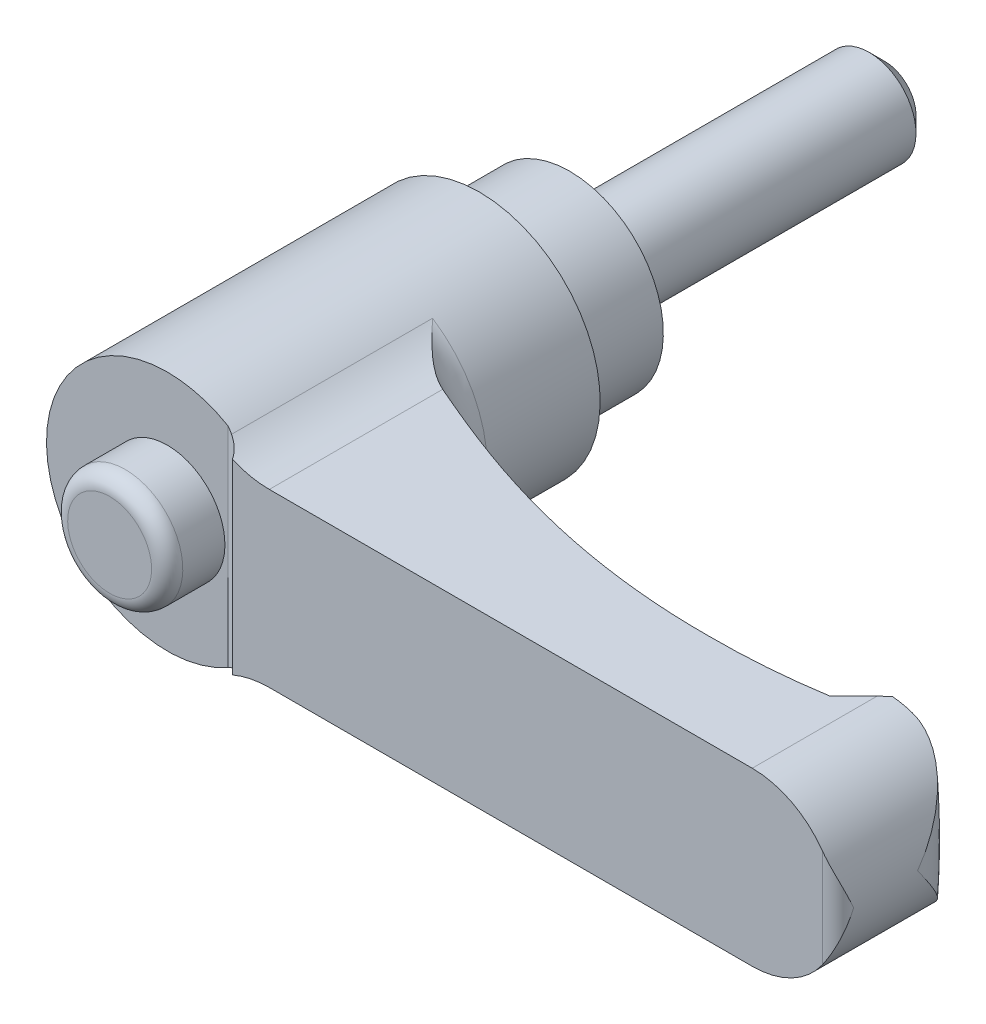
ISO-10303-21;
HEADER;
FILE_DESCRIPTION(('STEP AP214'),'2;1');
FILE_NAME('part.step','',(''),(''),'','','');
FILE_SCHEMA(('AUTOMOTIVE_DESIGN { 1 0 10303 214 1 1 1 1 }'));
ENDSEC;
DATA;
#1=APPLICATION_CONTEXT('core data for automotive mechanical design processes');
#2=APPLICATION_PROTOCOL_DEFINITION('international standard','automotive_design',2000,#1);
#3=PRODUCT_CONTEXT('',#1,'mechanical');
#4=PRODUCT('Part','Part','',(#3));
#5=PRODUCT_RELATED_PRODUCT_CATEGORY('part','',(#4));
#6=PRODUCT_DEFINITION_FORMATION('','',#4);
#7=PRODUCT_DEFINITION_CONTEXT('part definition',#1,'design');
#8=PRODUCT_DEFINITION('design','',#6,#7);
#9=PRODUCT_DEFINITION_SHAPE('','',#8);
#10=(LENGTH_UNIT() NAMED_UNIT(*) SI_UNIT(.MILLI.,.METRE.));
#11=(NAMED_UNIT(*) PLANE_ANGLE_UNIT() SI_UNIT($,.RADIAN.));
#12=(NAMED_UNIT(*) SI_UNIT($,.STERADIAN.) SOLID_ANGLE_UNIT());
#13=UNCERTAINTY_MEASURE_WITH_UNIT(LENGTH_MEASURE(1.E-05),#10,'distance_accuracy_value','');
#14=(GEOMETRIC_REPRESENTATION_CONTEXT(3) GLOBAL_UNCERTAINTY_ASSIGNED_CONTEXT((#13)) GLOBAL_UNIT_ASSIGNED_CONTEXT((#10,
#11,#12)) REPRESENTATION_CONTEXT('',''));
#15=CARTESIAN_POINT('',(0.,0.,0.));
#16=DIRECTION('',(0.,0.,1.));
#17=DIRECTION('',(1.,0.,0.));
#18=AXIS2_PLACEMENT_3D('',#15,#16,#17);
#19=CARTESIAN_POINT('',(4.8,0.,0.));
#20=DIRECTION('',(0.,0.,1.));
#21=DIRECTION('',(0.,-1.,0.));
#22=AXIS2_PLACEMENT_3D('',#19,#20,#21);
#23=PLANE('',#22);
#24=CARTESIAN_POINT('',(0.,0.,0.));
#25=DIRECTION('',(0.,0.,-1.));
#26=DIRECTION('',(0.,1.,0.));
#27=AXIS2_PLACEMENT_3D('',#24,#25,#26);
#28=CIRCLE('',#27,3.);
#29=CARTESIAN_POINT('',(0.,3.,0.));
#30=VERTEX_POINT('',#29);
#31=EDGE_CURVE('E469',#30,#30,#28,.T.);
#32=ORIENTED_EDGE('',*,*,#31,.F.);
#33=EDGE_LOOP('',(#32));
#34=FACE_BOUND('',#33,.T.);
#35=CARTESIAN_POINT('',(0.,0.,0.));
#36=DIRECTION('',(0.,0.,-1.));
#37=DIRECTION('',(0.,1.,0.));
#38=AXIS2_PLACEMENT_3D('',#35,#36,#37);
#39=CIRCLE('',#38,4.8);
#40=CARTESIAN_POINT('',(0.,4.8,0.));
#41=VERTEX_POINT('',#40);
#42=EDGE_CURVE('E417',#41,#41,#39,.T.);
#43=ORIENTED_EDGE('',*,*,#42,.T.);
#44=EDGE_LOOP('',(#43));
#45=FACE_BOUND('',#44,.T.);
#46=ADVANCED_FACE('F14',(#34,#45),#23,.F.);
#47=CARTESIAN_POINT('',(0.,0.,26.));
#48=DIRECTION('',(0.,0.,-1.));
#49=DIRECTION('',(0.,1.,0.));
#50=AXIS2_PLACEMENT_3D('',#47,#48,#49);
#51=PLANE('',#50);
#52=CARTESIAN_POINT('',(0.,0.,26.));
#53=DIRECTION('',(0.,0.,-1.));
#54=DIRECTION('',(0.,1.,0.));
#55=AXIS2_PLACEMENT_3D('',#52,#53,#54);
#56=CIRCLE('',#55,7.75);
#57=CARTESIAN_POINT('',(3.875,-6.7116968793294,26.));
#58=VERTEX_POINT('',#57);
#59=CARTESIAN_POINT('',(3.875,6.7116968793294,26.));
#60=VERTEX_POINT('',#59);
#61=EDGE_CURVE('E364',#58,#60,#56,.T.);
#62=ORIENTED_EDGE('',*,*,#61,.F.);
#63=DIRECTION('',(0.,1.,0.));
#64=VECTOR('',#63,1.);
#65=CARTESIAN_POINT('',(3.875,-11.,26.));
#66=LINE('',#65,#64);
#67=EDGE_CURVE('E451',#58,#60,#66,.T.);
#68=ORIENTED_EDGE('',*,*,#67,.T.);
#69=EDGE_LOOP('',(#62,#68));
#70=FACE_BOUND('',#69,.T.);
#71=CARTESIAN_POINT('',(0.,0.,26.));
#72=DIRECTION('',(0.,0.,-1.));
#73=DIRECTION('',(0.,1.,0.));
#74=AXIS2_PLACEMENT_3D('',#71,#72,#73);
#75=CIRCLE('',#74,3.69047619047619);
#76=CARTESIAN_POINT('',(0.,3.69047619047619,26.));
#77=VERTEX_POINT('',#76);
#78=EDGE_CURVE('E183',#77,#77,#75,.F.);
#79=ORIENTED_EDGE('',*,*,#78,.F.);
#80=EDGE_LOOP('',(#79));
#81=FACE_BOUND('',#80,.T.);
#82=ADVANCED_FACE('F158',(#70,#81),#51,.F.);
#83=CARTESIAN_POINT('',(38.5,0.,0.));
#84=DIRECTION('',(0.,0.,1.));
#85=DIRECTION('',(0.,-1.,0.));
#86=AXIS2_PLACEMENT_3D('',#83,#84,#85);
#87=CYLINDRICAL_SURFACE('',#86,5.5);
#88=CARTESIAN_POINT('',(44.,0.,21.9));
#89=CARTESIAN_POINT('',(44.0000000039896,-0.00425779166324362,21.8968685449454));
#90=CARTESIAN_POINT('',(43.9999950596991,-0.00851571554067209,21.8937369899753));
#91=CARTESIAN_POINT('',(43.9991083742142,-0.390143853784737,21.6130627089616));
#92=CARTESIAN_POINT('',(43.9593602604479,-0.76848056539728,21.3348044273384));
#93=CARTESIAN_POINT('',(43.8405607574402,-1.32856821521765,20.92503354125));
#94=CARTESIAN_POINT('',(43.7909532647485,-1.51435974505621,20.7894725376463));
#95=CARTESIAN_POINT('',(43.6715029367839,-1.88225773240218,20.5222473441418));
#96=CARTESIAN_POINT('',(43.601669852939,-2.06436592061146,20.3905813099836));
#97=CARTESIAN_POINT('',(43.4611872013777,-2.37875122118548,20.1648816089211));
#98=CARTESIAN_POINT('',(43.3950453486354,-2.51217438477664,20.0696210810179));
#99=CARTESIAN_POINT('',(43.250799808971,-2.77532702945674,19.8831417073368));
#100=CARTESIAN_POINT('',(43.1726935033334,-2.90505569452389,19.7919237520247));
#101=CARTESIAN_POINT('',(42.9202953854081,-3.28692053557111,19.5261795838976));
#102=CARTESIAN_POINT('',(42.727561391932,-3.53256609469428,19.3589622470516));
#103=CARTESIAN_POINT('',(42.3484683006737,-3.93634172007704,19.0952853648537));
#104=CARTESIAN_POINT('',(42.1735223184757,-4.10060224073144,18.9917399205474));
#105=CARTESIAN_POINT('',(41.7960798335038,-4.40966486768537,18.8081296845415));
#106=CARTESIAN_POINT('',(41.5936163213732,-4.55448986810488,18.7280371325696));
#107=CARTESIAN_POINT('',(41.2098130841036,-4.79019974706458,18.6136936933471));
#108=CARTESIAN_POINT('',(41.0333744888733,-4.88597642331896,18.5732748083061));
#109=CARTESIAN_POINT('',(40.7593164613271,-5.01555037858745,18.5310688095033));
#110=CARTESIAN_POINT('',(40.666374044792,-5.05640116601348,18.5200701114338));
#111=CARTESIAN_POINT('',(40.4779067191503,-5.13305107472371,18.5048417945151));
#112=CARTESIAN_POINT('',(40.3823830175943,-5.16885251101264,18.5006090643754));
#113=CARTESIAN_POINT('',(40.1884747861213,-5.23542428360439,18.4995076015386));
#114=CARTESIAN_POINT('',(40.090071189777,-5.26614066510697,18.5027130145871));
#115=CARTESIAN_POINT('',(39.8922874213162,-5.32184956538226,18.5171885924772));
#116=CARTESIAN_POINT('',(39.7929078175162,-5.34684523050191,18.528454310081));
#117=CARTESIAN_POINT('',(39.5942462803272,-5.39100815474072,18.5594647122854));
#118=CARTESIAN_POINT('',(39.4949643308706,-5.41017990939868,18.5792028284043));
#119=CARTESIAN_POINT('',(39.2976352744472,-5.44277299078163,18.6274002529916));
#120=CARTESIAN_POINT('',(39.1995875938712,-5.45619709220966,18.6558553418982));
#121=CARTESIAN_POINT('',(38.9984921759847,-5.47836544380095,18.7240647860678));
#122=CARTESIAN_POINT('',(38.8956289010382,-5.48667774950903,18.7645122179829));
#123=CARTESIAN_POINT('',(38.7445568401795,-5.49479244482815,18.8326405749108));
#124=CARTESIAN_POINT('',(38.6947409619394,-5.49677173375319,18.8565904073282));
#125=CARTESIAN_POINT('',(38.5963240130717,-5.49937673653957,18.9069325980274));
#126=CARTESIAN_POINT('',(38.5477229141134,-5.50000248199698,18.9333248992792));
#127=CARTESIAN_POINT('',(38.4998,-5.49999999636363,18.9609171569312));
#128=B_SPLINE_CURVE_WITH_KNOTS('',3,(#88,#89,#90,#91,#92,#93,#94,#95,#96,#97,#98,#99,#100,#101,
#102,#103,#104,#105,#106,#107,#108,#109,#110,#111,#112,#113,#114,#115,#116,#117,#118,#119,#120,
#121,#122,#123,#124,#125,#126,#127),.UNSPECIFIED.,.F.,.F.,(4,2,2,2,2,2,2,2,2,2,2,2,2,2,2,2,2,2,
2,4),(0.,0.0158565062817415,1.4211419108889,2.12636053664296,2.83123971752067,3.36110592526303,
3.89108827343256,4.94782257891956,5.7293360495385,6.50992069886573,7.12169061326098,
7.42772009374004,7.73360880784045,8.04255979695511,8.35134045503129,8.65988215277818,
8.96827473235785,9.30004722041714,9.46590364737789,9.63175620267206),.UNSPECIFIED.);
#129=CARTESIAN_POINT('',(40.2644155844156,-5.20930299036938,18.5));
#130=VERTEX_POINT('',#129);
#131=CARTESIAN_POINT('',(44.,0.,21.9));
#132=VERTEX_POINT('',#131);
#133=EDGE_CURVE('E126',#130,#132,#128,.F.);
#134=ORIENTED_EDGE('',*,*,#133,.T.);
#135=CARTESIAN_POINT('',(44.,0.,21.9));
#136=CARTESIAN_POINT('',(44.0000000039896,0.00425779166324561,21.8968685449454));
#137=CARTESIAN_POINT('',(43.9999950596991,0.00851571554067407,21.8937369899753));
#138=CARTESIAN_POINT('',(43.9991083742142,0.390143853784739,21.6130627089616));
#139=CARTESIAN_POINT('',(43.9593602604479,0.768480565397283,21.3348044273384));
#140=CARTESIAN_POINT('',(43.8405607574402,1.32856821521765,20.92503354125));
#141=CARTESIAN_POINT('',(43.7909532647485,1.51435974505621,20.7894725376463));
#142=CARTESIAN_POINT('',(43.6715029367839,1.88225773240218,20.5222473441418));
#143=CARTESIAN_POINT('',(43.601669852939,2.06436592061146,20.3905813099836));
#144=CARTESIAN_POINT('',(43.4611872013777,2.37875122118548,20.1648816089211));
#145=CARTESIAN_POINT('',(43.3950453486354,2.51217438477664,20.0696210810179));
#146=CARTESIAN_POINT('',(43.250799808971,2.77532702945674,19.8831417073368));
#147=CARTESIAN_POINT('',(43.1726935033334,2.9050556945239,19.7919237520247));
#148=CARTESIAN_POINT('',(42.9202953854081,3.28692053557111,19.5261795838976));
#149=CARTESIAN_POINT('',(42.727561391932,3.53256609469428,19.3589622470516));
#150=CARTESIAN_POINT('',(42.3484683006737,3.93634172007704,19.0952853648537));
#151=CARTESIAN_POINT('',(42.1735223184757,4.10060224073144,18.9917399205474));
#152=CARTESIAN_POINT('',(41.7960798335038,4.40966486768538,18.8081296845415));
#153=CARTESIAN_POINT('',(41.5936163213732,4.55448986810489,18.7280371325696));
#154=CARTESIAN_POINT('',(41.2098130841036,4.79019974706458,18.6136936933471));
#155=CARTESIAN_POINT('',(41.0333744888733,4.88597642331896,18.5732748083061));
#156=CARTESIAN_POINT('',(40.7593164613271,5.01555037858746,18.5310688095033));
#157=CARTESIAN_POINT('',(40.666374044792,5.05640116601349,18.5200701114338));
#158=CARTESIAN_POINT('',(40.4779067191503,5.13305107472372,18.5048417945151));
#159=CARTESIAN_POINT('',(40.3823830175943,5.16885251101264,18.5006090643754));
#160=CARTESIAN_POINT('',(40.1884747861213,5.23542428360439,18.4995076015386));
#161=CARTESIAN_POINT('',(40.090071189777,5.26614066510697,18.5027130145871));
#162=CARTESIAN_POINT('',(39.8922874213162,5.32184956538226,18.5171885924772));
#163=CARTESIAN_POINT('',(39.7929078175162,5.34684523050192,18.528454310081));
#164=CARTESIAN_POINT('',(39.5942462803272,5.39100815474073,18.5594647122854));
#165=CARTESIAN_POINT('',(39.4949643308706,5.41017990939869,18.5792028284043));
#166=CARTESIAN_POINT('',(39.2976352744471,5.44277299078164,18.6274002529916));
#167=CARTESIAN_POINT('',(39.1995875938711,5.45619709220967,18.6558553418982));
#168=CARTESIAN_POINT('',(38.9984921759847,5.47836544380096,18.7240647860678));
#169=CARTESIAN_POINT('',(38.8956289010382,5.48667774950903,18.7645122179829));
#170=CARTESIAN_POINT('',(38.7445568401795,5.49479244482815,18.8326405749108));
#171=CARTESIAN_POINT('',(38.6947409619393,5.4967717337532,18.8565904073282));
#172=CARTESIAN_POINT('',(38.5963240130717,5.49937673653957,18.9069325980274));
#173=CARTESIAN_POINT('',(38.5477229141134,5.50000248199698,18.9333248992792));
#174=CARTESIAN_POINT('',(38.4998,5.49999999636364,18.9609171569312));
#175=B_SPLINE_CURVE_WITH_KNOTS('',3,(#135,#136,#137,#138,#139,#140,#141,#142,#143,#144,#145,
#146,#147,#148,#149,#150,#151,#152,#153,#154,#155,#156,#157,#158,#159,#160,#161,#162,#163,#164,
#165,#166,#167,#168,#169,#170,#171,#172,#173,#174),.UNSPECIFIED.,.F.,.F.,(4,2,2,2,2,2,2,2,2,2,2,
2,2,2,2,2,2,2,2,4),(0.,0.0158565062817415,1.4211419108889,2.12636053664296,2.83123971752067,
3.36110592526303,3.89108827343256,4.94782257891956,5.72933604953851,6.50992069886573,
7.12169061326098,7.42772009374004,7.73360880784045,8.04255979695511,8.35134045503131,
8.6598821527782,8.9682747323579,9.30004722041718,9.46590364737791,9.63175620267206),.UNSPECIFIED.);
#176=CARTESIAN_POINT('',(40.2644155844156,5.20930299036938,18.5));
#177=VERTEX_POINT('',#176);
#178=EDGE_CURVE('E123',#132,#177,#175,.T.);
#179=ORIENTED_EDGE('',*,*,#178,.T.);
#180=CARTESIAN_POINT('',(38.5,0.,18.5));
#181=DIRECTION('',(0.,0.,-1.));
#182=DIRECTION('',(0.,1.,0.));
#183=AXIS2_PLACEMENT_3D('',#180,#181,#182);
#184=CIRCLE('',#183,5.5);
#185=CARTESIAN_POINT('',(39.,5.47722557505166,18.5));
#186=VERTEX_POINT('',#185);
#187=EDGE_CURVE('E457',#177,#186,#184,.F.);
#188=ORIENTED_EDGE('',*,*,#187,.T.);
#189=CARTESIAN_POINT('',(38.5,0.,19.));
#190=DIRECTION('',(-0.707106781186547,0.,-0.707106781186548));
#191=DIRECTION('',(-0.707106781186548,0.,0.707106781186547));
#192=AXIS2_PLACEMENT_3D('',#189,#190,#191);
#193=ELLIPSE('',#192,7.77817459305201,5.5);
#194=CARTESIAN_POINT('',(38.5,5.5,19.));
#195=VERTEX_POINT('',#194);
#196=EDGE_CURVE('E390',#186,#195,#193,.F.);
#197=ORIENTED_EDGE('',*,*,#196,.T.);
#198=DIRECTION('',(0.,0.,1.));
#199=VECTOR('',#198,1.);
#200=CARTESIAN_POINT('',(38.5,5.5,0.));
#201=LINE('',#200,#199);
#202=CARTESIAN_POINT('',(38.5,5.5,27.));
#203=VERTEX_POINT('',#202);
#204=EDGE_CURVE('E389',#195,#203,#201,.T.);
#205=ORIENTED_EDGE('',*,*,#204,.T.);
#206=CARTESIAN_POINT('',(38.5,0.,27.));
#207=DIRECTION('',(0.,0.,1.));
#208=DIRECTION('',(0.,-1.,0.));
#209=AXIS2_PLACEMENT_3D('',#206,#207,#208);
#210=CIRCLE('',#209,5.5);
#211=CARTESIAN_POINT('',(43.,3.16227766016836,27.));
#212=VERTEX_POINT('',#211);
#213=EDGE_CURVE('E367',#212,#203,#210,.T.);
#214=ORIENTED_EDGE('',*,*,#213,.F.);
#215=CARTESIAN_POINT('',(43.,3.16227766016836,27.));
#216=CARTESIAN_POINT('',(43.0489698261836,3.09261080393,26.9999556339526));
#217=CARTESIAN_POINT('',(43.0962528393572,3.0218687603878,26.9964077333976));
#218=CARTESIAN_POINT('',(43.1871872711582,2.87878712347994,26.9834058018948));
#219=CARTESIAN_POINT('',(43.2308453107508,2.80645076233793,26.9739628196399));
#220=CARTESIAN_POINT('',(43.3141980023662,2.66092047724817,26.9503365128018));
#221=CARTESIAN_POINT('',(43.3539154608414,2.58773460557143,26.9361828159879));
#222=CARTESIAN_POINT('',(43.4296865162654,2.44030003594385,26.903917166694));
#223=CARTESIAN_POINT('',(43.4657377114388,2.36605067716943,26.8858026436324));
#224=CARTESIAN_POINT('',(43.5573559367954,2.16613298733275,26.8329178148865));
#225=CARTESIAN_POINT('',(43.6095944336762,2.03971389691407,26.7951786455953));
#226=CARTESIAN_POINT('',(43.703955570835,1.78529411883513,26.7129945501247));
#227=CARTESIAN_POINT('',(43.7460735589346,1.65729273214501,26.6685465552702));
#228=CARTESIAN_POINT('',(43.8205857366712,1.39978291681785,26.5746664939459));
#229=CARTESIAN_POINT('',(43.852946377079,1.27027084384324,26.5252179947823));
#230=CARTESIAN_POINT('',(43.9079882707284,1.01058108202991,26.4229956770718));
#231=CARTESIAN_POINT('',(43.9306732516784,0.880403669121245,26.3702231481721));
#232=CARTESIAN_POINT('',(43.9654953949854,0.627432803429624,26.2658240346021));
#233=CARTESIAN_POINT('',(43.9781829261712,0.504664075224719,26.2143181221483));
#234=CARTESIAN_POINT('',(43.9952673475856,0.259135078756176,26.1104803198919));
#235=CARTESIAN_POINT('',(43.9996786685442,0.136375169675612,26.0581500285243));
#236=CARTESIAN_POINT('',(43.9999943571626,0.00909584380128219,26.0038784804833));
#237=CARTESIAN_POINT('',(43.9999999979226,0.00454789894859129,26.0019392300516));
#238=CARTESIAN_POINT('',(44.,0.,26.));
#239=B_SPLINE_CURVE_WITH_KNOTS('',3,(#215,#216,#217,#218,#219,#220,#221,#222,#223,#224,#225,
#226,#227,#228,#229,#230,#231,#232,#233,#234,#235,#236,#237,#238),.UNSPECIFIED.,.F.,.F.,(4,2,2,
2,2,2,2,2,2,2,2,4),(0.,0.255244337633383,0.510011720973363,0.763206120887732,1.01656533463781,
1.44159949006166,1.8668286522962,2.2935036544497,2.72001412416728,3.12097942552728,
3.52124493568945,3.53607734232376),.UNSPECIFIED.);
#240=CARTESIAN_POINT('',(44.,0.,26.));
#241=VERTEX_POINT('',#240);
#242=EDGE_CURVE('E169',#241,#212,#239,.F.);
#243=ORIENTED_EDGE('',*,*,#242,.F.);
#244=CARTESIAN_POINT('',(43.,-3.16227766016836,27.));
#245=CARTESIAN_POINT('',(43.0489698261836,-3.09261080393,26.9999556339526));
#246=CARTESIAN_POINT('',(43.0962528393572,-3.0218687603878,26.9964077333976));
#247=CARTESIAN_POINT('',(43.1871872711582,-2.87878712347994,26.9834058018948));
#248=CARTESIAN_POINT('',(43.2308453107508,-2.80645076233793,26.9739628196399));
#249=CARTESIAN_POINT('',(43.3141980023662,-2.66092047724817,26.9503365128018));
#250=CARTESIAN_POINT('',(43.3539154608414,-2.58773460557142,26.9361828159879));
#251=CARTESIAN_POINT('',(43.4296865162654,-2.44030003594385,26.903917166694));
#252=CARTESIAN_POINT('',(43.4657377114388,-2.36605067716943,26.8858026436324));
#253=CARTESIAN_POINT('',(43.5573559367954,-2.16613298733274,26.8329178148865));
#254=CARTESIAN_POINT('',(43.6095944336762,-2.03971389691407,26.7951786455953));
#255=CARTESIAN_POINT('',(43.703955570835,-1.78529411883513,26.7129945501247));
#256=CARTESIAN_POINT('',(43.7460735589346,-1.65729273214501,26.6685465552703));
#257=CARTESIAN_POINT('',(43.8205857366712,-1.39978291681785,26.5746664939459));
#258=CARTESIAN_POINT('',(43.852946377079,-1.27027084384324,26.5252179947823));
#259=CARTESIAN_POINT('',(43.9079882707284,-1.01058108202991,26.4229956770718));
#260=CARTESIAN_POINT('',(43.9306732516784,-0.880403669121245,26.3702231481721));
#261=CARTESIAN_POINT('',(43.9654953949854,-0.627432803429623,26.2658240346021));
#262=CARTESIAN_POINT('',(43.9781829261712,-0.504664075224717,26.2143181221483));
#263=CARTESIAN_POINT('',(43.9952673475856,-0.259135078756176,26.1104803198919));
#264=CARTESIAN_POINT('',(43.9996786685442,-0.136375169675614,26.0581500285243));
#265=CARTESIAN_POINT('',(43.9999943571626,-0.00909584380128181,26.0038784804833));
#266=CARTESIAN_POINT('',(43.9999999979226,-0.00454789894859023,26.0019392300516));
#267=CARTESIAN_POINT('',(44.,0.,26.));
#268=B_SPLINE_CURVE_WITH_KNOTS('',3,(#244,#245,#246,#247,#248,#249,#250,#251,#252,#253,#254,
#255,#256,#257,#258,#259,#260,#261,#262,#263,#264,#265,#266,#267),.UNSPECIFIED.,.F.,.F.,(4,2,2,
2,2,2,2,2,2,2,2,4),(0.,0.255244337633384,0.510011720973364,0.763206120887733,1.01656533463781,
1.44159949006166,1.8668286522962,2.2935036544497,2.72001412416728,3.12097942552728,
3.52124493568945,3.53607734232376),.UNSPECIFIED.);
#269=CARTESIAN_POINT('',(43.,-3.16227766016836,27.));
#270=VERTEX_POINT('',#269);
#271=EDGE_CURVE('E177',#270,#241,#268,.T.);
#272=ORIENTED_EDGE('',*,*,#271,.F.);
#273=CARTESIAN_POINT('',(38.5,-5.5,27.));
#274=VERTEX_POINT('',#273);
#275=EDGE_CURVE('E373',#274,#270,#210,.T.);
#276=ORIENTED_EDGE('',*,*,#275,.F.);
#277=DIRECTION('',(0.,0.,1.));
#278=VECTOR('',#277,1.);
#279=CARTESIAN_POINT('',(38.5,-5.5,0.));
#280=LINE('',#279,#278);
#281=CARTESIAN_POINT('',(38.5,-5.5,19.));
#282=VERTEX_POINT('',#281);
#283=EDGE_CURVE('E393',#282,#274,#280,.T.);
#284=ORIENTED_EDGE('',*,*,#283,.F.);
#285=CARTESIAN_POINT('',(39.,-5.47722557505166,18.5));
#286=VERTEX_POINT('',#285);
#287=EDGE_CURVE('E440',#282,#286,#193,.F.);
#288=ORIENTED_EDGE('',*,*,#287,.T.);
#289=EDGE_CURVE('E134',#286,#130,#184,.F.);
#290=ORIENTED_EDGE('',*,*,#289,.T.);
#291=EDGE_LOOP('',(#134,#179,#188,#197,#205,#214,#243,#272,#276,#284,#288,#290));
#292=FACE_BOUND('',#291,.T.);
#293=ADVANCED_FACE('F132',(#292),#87,.T.);
#294=CARTESIAN_POINT('',(40.6,-11.,18.5));
#295=DIRECTION('',(0.,0.,-1.));
#296=DIRECTION('',(0.,1.,0.));
#297=AXIS2_PLACEMENT_3D('',#294,#295,#296);
#298=PLANE('',#297);
#299=ORIENTED_EDGE('',*,*,#187,.F.);
#300=CARTESIAN_POINT('',(0.,0.,18.5));
#301=DIRECTION('',(0.,0.,-1.));
#302=DIRECTION('',(0.,1.,0.));
#303=AXIS2_PLACEMENT_3D('',#300,#301,#302);
#304=CIRCLE('',#303,40.6);
#305=EDGE_CURVE('E37',#177,#130,#304,.T.);
#306=ORIENTED_EDGE('',*,*,#305,.T.);
#307=ORIENTED_EDGE('',*,*,#289,.F.);
#308=DIRECTION('',(0.,1.,0.));
#309=VECTOR('',#308,1.);
#310=CARTESIAN_POINT('',(39.,-11.,18.5));
#311=LINE('',#310,#309);
#312=EDGE_CURVE('E448',#286,#186,#311,.T.);
#313=ORIENTED_EDGE('',*,*,#312,.T.);
#314=EDGE_LOOP('',(#299,#306,#307,#313));
#315=FACE_BOUND('',#314,.T.);
#316=ADVANCED_FACE('F157',(#315),#298,.T.);
#317=CARTESIAN_POINT('',(0.,0.,27.));
#318=DIRECTION('',(0.,0.,1.));
#319=DIRECTION('',(0.,-1.,0.));
#320=AXIS2_PLACEMENT_3D('',#317,#318,#319);
#321=PLANE('',#320);
#322=CARTESIAN_POINT('',(7.53740671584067,11.5,27.));
#323=DIRECTION('',(0.,0.,1.));
#324=DIRECTION('',(1.,0.,0.));
#325=AXIS2_PLACEMENT_3D('',#322,#323,#324);
#326=CIRCLE('',#325,6.);
#327=CARTESIAN_POINT('',(5.16666666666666,5.988231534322,27.));
#328=VERTEX_POINT('',#327);
#329=CARTESIAN_POINT('',(7.53740671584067,5.5,27.));
#330=VERTEX_POINT('',#329);
#331=EDGE_CURVE('E398',#328,#330,#326,.T.);
#332=ORIENTED_EDGE('',*,*,#331,.F.);
#333=DIRECTION('',(0.,1.,0.));
#334=VECTOR('',#333,1.);
#335=CARTESIAN_POINT('',(5.16666666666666,-11.,27.));
#336=LINE('',#335,#334);
#337=CARTESIAN_POINT('',(5.16666666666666,-5.988231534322,27.));
#338=VERTEX_POINT('',#337);
#339=EDGE_CURVE('E436',#338,#328,#336,.T.);
#340=ORIENTED_EDGE('',*,*,#339,.F.);
#341=CARTESIAN_POINT('',(7.53740671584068,-11.5,27.));
#342=DIRECTION('',(0.,0.,1.));
#343=DIRECTION('',(1.,0.,0.));
#344=AXIS2_PLACEMENT_3D('',#341,#342,#343);
#345=CIRCLE('',#344,6.);
#346=CARTESIAN_POINT('',(7.53740671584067,-5.5,27.));
#347=VERTEX_POINT('',#346);
#348=EDGE_CURVE('E401',#347,#338,#345,.T.);
#349=ORIENTED_EDGE('',*,*,#348,.F.);
#350=DIRECTION('',(-1.,0.,0.));
#351=VECTOR('',#350,1.);
#352=CARTESIAN_POINT('',(38.5,-5.5,27.));
#353=LINE('',#352,#351);
#354=EDGE_CURVE('E397',#274,#347,#353,.T.);
#355=ORIENTED_EDGE('',*,*,#354,.F.);
#356=ORIENTED_EDGE('',*,*,#275,.T.);
#357=DIRECTION('',(0.,1.,0.));
#358=VECTOR('',#357,1.);
#359=CARTESIAN_POINT('',(43.,-11.,27.));
#360=LINE('',#359,#358);
#361=EDGE_CURVE('E385',#270,#212,#360,.T.);
#362=ORIENTED_EDGE('',*,*,#361,.T.);
#363=ORIENTED_EDGE('',*,*,#213,.T.);
#364=DIRECTION('',(1.,0.,0.));
#365=VECTOR('',#364,1.);
#366=CARTESIAN_POINT('',(7.53740671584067,5.5,27.));
#367=LINE('',#366,#365);
#368=EDGE_CURVE('E384',#330,#203,#367,.T.);
#369=ORIENTED_EDGE('',*,*,#368,.F.);
#370=EDGE_LOOP('',(#332,#340,#349,#355,#356,#362,#363,#369));
#371=FACE_BOUND('',#370,.T.);
#372=ADVANCED_FACE('F240',(#371),#321,.T.);
#373=CARTESIAN_POINT('',(0.,0.,0.));
#374=DIRECTION('',(0.,0.,-1.));
#375=DIRECTION('',(0.,1.,0.));
#376=AXIS2_PLACEMENT_3D('',#373,#374,#375);
#377=CYLINDRICAL_SURFACE('',#376,7.75);
#378=CARTESIAN_POINT('',(0.,0.,13.2417430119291));
#379=DIRECTION('',(0.,0.,-1.));
#380=DIRECTION('',(0.,1.,0.));
#381=AXIS2_PLACEMENT_3D('',#378,#379,#380);
#382=CIRCLE('',#381,7.75);
#383=CARTESIAN_POINT('',(4.24835651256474,6.48181818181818,13.2417430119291));
#384=VERTEX_POINT('',#383);
#385=CARTESIAN_POINT('',(4.24835651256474,-6.48181818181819,13.2417430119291));
#386=VERTEX_POINT('',#385);
#387=EDGE_CURVE('E359',#384,#386,#382,.T.);
#388=ORIENTED_EDGE('',*,*,#387,.T.);
#389=DIRECTION('',(0.,0.,1.));
#390=VECTOR('',#389,1.);
#391=CARTESIAN_POINT('',(4.24835651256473,-6.48181818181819,0.));
#392=LINE('',#391,#390);
#393=CARTESIAN_POINT('',(4.24835651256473,-6.48181818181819,26.1308937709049));
#394=VERTEX_POINT('',#393);
#395=EDGE_CURVE('E409',#386,#394,#392,.T.);
#396=ORIENTED_EDGE('',*,*,#395,.T.);
#397=CARTESIAN_POINT('',(3.875,-6.7116968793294,26.));
#398=CARTESIAN_POINT('',(3.9487248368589,-6.66914880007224,26.0179048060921));
#399=CARTESIAN_POINT('',(4.02097408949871,-6.62579988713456,26.039874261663));
#400=CARTESIAN_POINT('',(4.16199829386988,-6.53812669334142,26.0915573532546));
#401=CARTESIAN_POINT('',(4.23077434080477,-6.49380272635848,26.1212685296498));
#402=CARTESIAN_POINT('',(4.36202505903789,-6.40634475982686,26.1868862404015));
#403=CARTESIAN_POINT('',(4.42463632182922,-6.36322379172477,26.2225378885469));
#404=CARTESIAN_POINT('',(4.54579687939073,-6.27724013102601,26.3004737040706));
#405=CARTESIAN_POINT('',(4.60434578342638,-6.23437746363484,26.3427585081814));
#406=CARTESIAN_POINT('',(4.71026264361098,-6.1546555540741,26.4283893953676));
#407=CARTESIAN_POINT('',(4.75813291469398,-6.11768751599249,26.4710140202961));
#408=CARTESIAN_POINT('',(4.8500303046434,-6.04509175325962,26.56120031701));
#409=CARTESIAN_POINT('',(4.89405965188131,-6.00946325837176,26.6087590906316));
#410=CARTESIAN_POINT('',(4.97925799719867,-5.9390764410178,26.7103994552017));
#411=CARTESIAN_POINT('',(5.02029084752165,-5.90438218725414,26.7646407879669));
#412=CARTESIAN_POINT('',(5.09738332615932,-5.83796295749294,26.8783962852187));
#413=CARTESIAN_POINT('',(5.13343386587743,-5.80624344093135,26.9379197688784));
#414=CARTESIAN_POINT('',(5.16666666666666,-5.77650894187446,27.));
#415=B_SPLINE_CURVE_WITH_KNOTS('',3,(#397,#398,#399,#400,#401,#402,#403,#404,#405,#406,#407,
#408,#409,#410,#411,#412,#413,#414),.UNSPECIFIED.,.F.,.F.,(4,2,2,2,2,2,2,2,4),(0.,
0.26081186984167,0.521540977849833,0.773092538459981,1.02466826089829,1.24638864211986,
1.4679795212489,1.6966429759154,1.92571819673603),.UNSPECIFIED.);
#416=EDGE_CURVE('E214',#58,#394,#415,.T.);
#417=ORIENTED_EDGE('',*,*,#416,.F.);
#418=ORIENTED_EDGE('',*,*,#61,.T.);
#419=CARTESIAN_POINT('',(5.16666666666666,5.77650894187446,27.));
#420=CARTESIAN_POINT('',(5.13714077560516,5.80292379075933,26.9448365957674));
#421=CARTESIAN_POINT('',(5.1053831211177,5.83091583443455,26.8916890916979));
#422=CARTESIAN_POINT('',(5.03785941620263,5.88934998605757,26.7895453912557));
#423=CARTESIAN_POINT('',(5.00209830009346,5.91978906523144,26.7405442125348));
#424=CARTESIAN_POINT('',(4.92700880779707,5.98243056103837,26.646752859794));
#425=CARTESIAN_POINT('',(4.88768622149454,6.01463008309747,26.6019560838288));
#426=CARTESIAN_POINT('',(4.80573825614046,6.08030777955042,26.5165060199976));
#427=CARTESIAN_POINT('',(4.76311181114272,6.11378636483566,26.4758540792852));
#428=CARTESIAN_POINT('',(4.63114473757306,6.21507952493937,26.3605779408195));
#429=CARTESIAN_POINT('',(4.53728284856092,6.28411879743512,26.2920994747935));
#430=CARTESIAN_POINT('',(4.3393749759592,6.42237347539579,26.1724069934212));
#431=CARTESIAN_POINT('',(4.23533663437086,6.49158871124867,26.1211801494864));
#432=CARTESIAN_POINT('',(4.08621326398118,6.5854168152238,26.0632790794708));
#433=CARTESIAN_POINT('',(4.04469277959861,6.61100425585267,26.0487072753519));
#434=CARTESIAN_POINT('',(3.96061680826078,6.66171281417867,26.0222973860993));
#435=CARTESIAN_POINT('',(3.91806319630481,6.68683464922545,26.0104547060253));
#436=CARTESIAN_POINT('',(3.8750000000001,6.7116968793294,26.));
#437=B_SPLINE_CURVE_WITH_KNOTS('',3,(#419,#420,#421,#422,#423,#424,#425,#426,#427,#428,#429,
#430,#431,#432,#433,#434,#435,#436),.UNSPECIFIED.,.F.,.F.,(4,2,2,2,2,2,2,2,4),(0.,
0.203583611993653,0.406919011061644,0.609929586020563,0.81300593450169,1.21684507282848,
1.62038324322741,1.77301957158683,1.92539700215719),.UNSPECIFIED.);
#438=CARTESIAN_POINT('',(4.24835651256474,6.48181818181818,26.1308937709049));
#439=VERTEX_POINT('',#438);
#440=EDGE_CURVE('E228',#439,#60,#437,.T.);
#441=ORIENTED_EDGE('',*,*,#440,.F.);
#442=DIRECTION('',(0.,0.,1.));
#443=VECTOR('',#442,1.);
#444=CARTESIAN_POINT('',(4.24835651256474,6.48181818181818,0.));
#445=LINE('',#444,#443);
#446=EDGE_CURVE('E415',#384,#439,#445,.T.);
#447=ORIENTED_EDGE('',*,*,#446,.F.);
#448=EDGE_LOOP('',(#388,#396,#417,#418,#441,#447));
#449=FACE_BOUND('',#448,.T.);
#450=CARTESIAN_POINT('',(0.,0.,6.));
#451=DIRECTION('',(0.,0.,-1.));
#452=DIRECTION('',(0.,1.,0.));
#453=AXIS2_PLACEMENT_3D('',#450,#451,#452);
#454=CIRCLE('',#453,7.75);
#455=CARTESIAN_POINT('',(0.,7.75,6.));
#456=VERTEX_POINT('',#455);
#457=EDGE_CURVE('E362',#456,#456,#454,.T.);
#458=ORIENTED_EDGE('',*,*,#457,.F.);
#459=EDGE_LOOP('',(#458));
#460=FACE_BOUND('',#459,.T.);
#461=ADVANCED_FACE('F238',(#449,#460),#377,.T.);
#462=CARTESIAN_POINT('',(7.53740671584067,11.5,0.));
#463=DIRECTION('',(0.,0.,1.));
#464=DIRECTION('',(0.,-1.,0.));
#465=AXIS2_PLACEMENT_3D('',#462,#463,#464);
#466=CYLINDRICAL_SURFACE('',#465,6.);
#467=DIRECTION('',(0.,0.,1.));
#468=VECTOR('',#467,1.);
#469=CARTESIAN_POINT('',(7.53740671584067,5.5,0.));
#470=LINE('',#469,#468);
#471=CARTESIAN_POINT('',(7.53740671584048,5.5,15.8847846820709));
#472=VERTEX_POINT('',#471);
#473=EDGE_CURVE('E392',#472,#330,#470,.T.);
#474=ORIENTED_EDGE('',*,*,#473,.F.);
#475=CARTESIAN_POINT('',(7.53760671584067,5.50000000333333,15.8848714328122));
#476=CARTESIAN_POINT('',(7.42056429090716,5.50000237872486,15.8340928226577));
#477=CARTESIAN_POINT('',(7.30547455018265,5.50341530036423,15.7791506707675));
#478=CARTESIAN_POINT('',(7.07949807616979,5.51642945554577,15.6622782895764));
#479=CARTESIAN_POINT('',(6.96860436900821,5.52601989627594,15.6003604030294));
#480=CARTESIAN_POINT('',(6.64350339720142,5.56296716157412,15.4067136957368));
#481=CARTESIAN_POINT('',(6.43532620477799,5.59851698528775,15.2663869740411));
#482=CARTESIAN_POINT('',(6.04665859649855,5.68493972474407,14.9793319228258));
#483=CARTESIAN_POINT('',(5.86525717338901,5.73477067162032,14.8334864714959));
#484=CARTESIAN_POINT('',(5.51460300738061,5.84825422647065,14.5326629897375));
#485=CARTESIAN_POINT('',(5.34535978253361,5.91191750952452,14.3776779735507));
#486=CARTESIAN_POINT('',(5.01722866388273,6.05200819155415,14.0618166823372));
#487=CARTESIAN_POINT('',(4.85836829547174,6.12846774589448,13.9009263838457));
#488=CARTESIAN_POINT('',(4.55010273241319,6.29360411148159,13.5765860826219));
#489=CARTESIAN_POINT('',(4.40069155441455,6.3822730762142,13.4131377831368));
#490=CARTESIAN_POINT('',(4.25307835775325,6.47872574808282,13.2470592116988));
#491=CARTESIAN_POINT('',(4.25071688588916,6.48027113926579,13.2444011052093));
#492=CARTESIAN_POINT('',(4.24835651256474,6.48181818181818,13.2417430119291));
#493=B_SPLINE_CURVE_WITH_KNOTS('',3,(#475,#476,#477,#478,#479,#480,#481,#482,#483,#484,#485,
#486,#487,#488,#489,#490,#491,#492),.UNSPECIFIED.,.F.,.F.,(4,2,2,2,2,2,2,2,4),(0.,
0.382411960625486,0.764157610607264,1.52259154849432,2.23572847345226,2.9494177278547,
3.66492808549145,4.37998074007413,4.39161142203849),.UNSPECIFIED.);
#494=EDGE_CURVE('E244',#472,#384,#493,.T.);
#495=ORIENTED_EDGE('',*,*,#494,.T.);
#496=ORIENTED_EDGE('',*,*,#446,.T.);
#497=CARTESIAN_POINT('',(5.16666666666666,5.988231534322,27.));
#498=CARTESIAN_POINT('',(5.14070328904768,5.99939986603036,26.9514536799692));
#499=CARTESIAN_POINT('',(5.11281907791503,6.01160988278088,26.9041807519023));
#500=CARTESIAN_POINT('',(5.05359296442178,6.03815743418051,26.8125079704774));
#501=CARTESIAN_POINT('',(5.02225228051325,6.05249421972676,26.7681071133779));
#502=CARTESIAN_POINT('',(4.957388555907,6.08292031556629,26.6836551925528));
#503=CARTESIAN_POINT('',(4.92394991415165,6.09895014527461,26.6435177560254));
#504=CARTESIAN_POINT('',(4.85453383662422,6.13309313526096,26.5664566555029));
#505=CARTESIAN_POINT('',(4.81855640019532,6.151206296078,26.5295329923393));
#506=CARTESIAN_POINT('',(4.74141898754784,6.19109353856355,26.4561742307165));
#507=CARTESIAN_POINT('',(4.70007605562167,6.21304611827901,26.4200283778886));
#508=CARTESIAN_POINT('',(4.61540587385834,6.25936628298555,26.3518346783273));
#509=CARTESIAN_POINT('',(4.57207832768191,6.28373422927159,26.31978744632));
#510=CARTESIAN_POINT('',(4.48259160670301,6.33561673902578,26.2589246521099));
#511=CARTESIAN_POINT('',(4.43638627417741,6.36320560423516,26.2302406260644));
#512=CARTESIAN_POINT('',(4.34298641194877,6.4207567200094,26.1772795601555));
#513=CARTESIAN_POINT('',(4.29579253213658,6.45071744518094,26.152999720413));
#514=CARTESIAN_POINT('',(4.24835651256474,6.48181818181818,26.1308937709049));
#515=B_SPLINE_CURVE_WITH_KNOTS('',3,(#497,#498,#499,#500,#501,#502,#503,#504,#505,#506,#507,
#508,#509,#510,#511,#512,#513,#514),.UNSPECIFIED.,.F.,.F.,(4,2,2,2,2,2,2,2,4),(0.,
0.168459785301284,0.336860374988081,0.500600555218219,0.664340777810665,0.841530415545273,
1.0187465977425,1.20147538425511,1.38408759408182),.UNSPECIFIED.);
#516=EDGE_CURVE('E222',#328,#439,#515,.T.);
#517=ORIENTED_EDGE('',*,*,#516,.F.);
#518=ORIENTED_EDGE('',*,*,#331,.T.);
#519=EDGE_LOOP('',(#474,#495,#496,#517,#518));
#520=FACE_BOUND('',#519,.T.);
#521=ADVANCED_FACE('F234',(#520),#466,.F.);
#522=CARTESIAN_POINT('',(7.53740671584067,5.5,0.));
#523=DIRECTION('',(0.,-1.,0.));
#524=DIRECTION('',(1.,0.,0.));
#525=AXIS2_PLACEMENT_3D('',#522,#523,#524);
#526=PLANE('',#525);
#527=CARTESIAN_POINT('',(30.0268503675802,5.5,-22.9439315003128));
#528=DIRECTION('',(0.,-1.,0.));
#529=DIRECTION('',(1.,0.,0.));
#530=AXIS2_PLACEMENT_3D('',#527,#528,#529);
#531=CIRCLE('',#530,44.);
#532=CARTESIAN_POINT('',(29.7749924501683,5.5,21.0553476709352));
#533=VERTEX_POINT('',#532);
#534=CARTESIAN_POINT('',(37.,5.5,20.5));
#535=VERTEX_POINT('',#534);
#536=EDGE_CURVE('E438',#533,#535,#531,.F.);
#537=ORIENTED_EDGE('',*,*,#536,.F.);
#538=CARTESIAN_POINT('',(21.9436856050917,5.5,20.4285815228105));
#539=CARTESIAN_POINT('',(21.2029115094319,5.5,20.3059110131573));
#540=CARTESIAN_POINT('',(20.4649826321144,5.5,20.1656901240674));
#541=CARTESIAN_POINT('',(18.9963617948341,5.5,19.8513505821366));
#542=CARTESIAN_POINT('',(18.2656705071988,5.5,19.6772288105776));
#543=CARTESIAN_POINT('',(16.8128961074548,5.5,19.2967691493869));
#544=CARTESIAN_POINT('',(16.090811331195,5.5,19.0904376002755));
#545=CARTESIAN_POINT('',(14.6559685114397,5.5,18.6477967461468));
#546=CARTESIAN_POINT('',(13.9432097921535,5.5,18.4114896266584));
#547=CARTESIAN_POINT('',(12.8749404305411,5.5,18.0348625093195));
#548=CARTESIAN_POINT('',(12.5159102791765,5.5,17.9044045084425));
#549=CARTESIAN_POINT('',(11.8001944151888,5.5,17.6372082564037));
#550=CARTESIAN_POINT('',(11.4435086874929,5.5,17.5004700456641));
#551=CARTESIAN_POINT('',(10.732274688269,5.5,17.2214557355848));
#552=CARTESIAN_POINT('',(10.3777266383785,5.5,17.0791790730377));
#553=CARTESIAN_POINT('',(9.67049294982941,5.5,16.7900916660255));
#554=CARTESIAN_POINT('',(9.31780729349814,5.5,16.6432809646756));
#555=CARTESIAN_POINT('',(8.61374307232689,5.5,16.3464161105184));
#556=CARTESIAN_POINT('',(8.26236472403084,5.5,16.1963614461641));
#557=CARTESIAN_POINT('',(7.5602010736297,5.5,15.8948338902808));
#558=CARTESIAN_POINT('',(7.20941580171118,5.5,15.7433609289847));
#559=CARTESIAN_POINT('',(6.50744095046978,5.5,15.4415733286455));
#560=CARTESIAN_POINT('',(6.15625149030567,5.5,15.2912584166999));
#561=CARTESIAN_POINT('',(5.62793742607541,5.5,15.0694562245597));
#562=CARTESIAN_POINT('',(5.45158532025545,5.5,14.9961369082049));
#563=CARTESIAN_POINT('',(5.09811730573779,5.5,14.8513669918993));
#564=CARTESIAN_POINT('',(4.92100141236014,5.5,14.7799163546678));
#565=CARTESIAN_POINT('',(4.5605943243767,5.5,14.6376146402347));
#566=CARTESIAN_POINT('',(4.37727258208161,5.5,14.5668405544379));
#567=CARTESIAN_POINT('',(4.00919151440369,5.5,14.4290929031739));
#568=CARTESIAN_POINT('',(3.82443214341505,5.5,14.3621194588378));
#569=CARTESIAN_POINT('',(3.45309773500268,5.5,14.2332037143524));
#570=CARTESIAN_POINT('',(3.26652222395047,5.5,14.1712627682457));
#571=CARTESIAN_POINT('',(2.89130395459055,5.5,14.0539247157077));
#572=CARTESIAN_POINT('',(2.70266119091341,5.5,13.9985276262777));
#573=CARTESIAN_POINT('',(2.32827959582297,5.5,13.897398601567));
#574=CARTESIAN_POINT('',(2.14260137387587,5.5,13.851444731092));
#575=CARTESIAN_POINT('',(1.76914487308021,5.5,13.769095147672));
#576=CARTESIAN_POINT('',(1.58136699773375,5.5,13.732697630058));
#577=CARTESIAN_POINT('',(1.20421453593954,5.5,13.6711783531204));
#578=CARTESIAN_POINT('',(1.01484256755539,5.5,13.6460408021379));
#579=CARTESIAN_POINT('',(0.634839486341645,5.5,13.6083407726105));
#580=CARTESIAN_POINT('',(0.444208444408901,5.5,13.5957775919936));
#581=CARTESIAN_POINT('',(0.0582481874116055,5.5,13.5838589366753));
#582=CARTESIAN_POINT('',(-0.137090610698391,5.5,13.5848056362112));
#583=CARTESIAN_POINT('',(-0.527202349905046,5.5,13.600583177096));
#584=CARTESIAN_POINT('',(-0.721975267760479,5.5,13.6154145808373));
#585=CARTESIAN_POINT('',(-1.11032173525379,5.5,13.6580559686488));
#586=CARTESIAN_POINT('',(-1.30389342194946,5.5,13.6858826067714));
#587=CARTESIAN_POINT('',(-1.68902621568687,5.5,13.7529686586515));
#588=CARTESIAN_POINT('',(-1.88058717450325,5.5,13.792228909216));
#589=CARTESIAN_POINT('',(-2.26665403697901,5.5,13.8815548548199));
#590=CARTESIAN_POINT('',(-2.46109765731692,5.5,13.9318861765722));
#591=CARTESIAN_POINT('',(-2.84766117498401,5.5,14.0407100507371));
#592=CARTESIAN_POINT('',(-3.03978104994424,5.5,14.0992026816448));
#593=CARTESIAN_POINT('',(-3.42198028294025,5.5,14.2225795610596));
#594=CARTESIAN_POINT('',(-3.61205922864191,5.5,14.2874650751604));
#595=CARTESIAN_POINT('',(-3.99046224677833,5.5,14.4221031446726));
#596=CARTESIAN_POINT('',(-4.17878640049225,5.5,14.4918554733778));
#597=CARTESIAN_POINT('',(-4.676521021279,5.5,14.6816530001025));
#598=CARTESIAN_POINT('',(-4.98473853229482,5.5,14.8048097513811));
#599=CARTESIAN_POINT('',(-5.5989323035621,5.5,15.0566129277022));
#600=CARTESIAN_POINT('',(-5.9049082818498,5.5,15.1852600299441));
#601=CARTESIAN_POINT('',(-6.51590552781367,5.5,15.4450696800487));
#602=CARTESIAN_POINT('',(-6.82092644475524,5.5,15.5762330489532));
#603=CARTESIAN_POINT('',(-7.4308151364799,5.5,15.8388677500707));
#604=CARTESIAN_POINT('',(-7.73568291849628,5.5,15.9703390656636));
#605=CARTESIAN_POINT('',(-8.34590975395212,5.5,16.2320111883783));
#606=CARTESIAN_POINT('',(-8.65126872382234,5.5,16.3622121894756));
#607=CARTESIAN_POINT('',(-9.26301038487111,5.5,16.6202018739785));
#608=CARTESIAN_POINT('',(-9.56939308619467,5.5,16.7479905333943));
#609=CARTESIAN_POINT('',(-10.18346626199,5.5,17.0002474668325));
#610=CARTESIAN_POINT('',(-10.4911565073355,5.5,17.1247162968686));
#611=CARTESIAN_POINT('',(-11.1081171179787,5.5,17.3696729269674));
#612=CARTESIAN_POINT('',(-11.4173874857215,5.5,17.4901607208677));
#613=CARTESIAN_POINT('',(-12.3376879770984,5.5,17.8409557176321));
#614=CARTESIAN_POINT('',(-12.9512257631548,5.5,18.0647504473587));
#615=CARTESIAN_POINT('',(-14.1854891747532,5.5,18.4917099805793));
#616=CARTESIAN_POINT('',(-14.8062151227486,5.5,18.6948738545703));
#617=CARTESIAN_POINT('',(-16.0550414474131,5.5,19.0786051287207));
#618=CARTESIAN_POINT('',(-16.6831460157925,5.5,19.2591589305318));
#619=CARTESIAN_POINT('',(-17.9458274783,5.5,19.5960006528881));
#620=CARTESIAN_POINT('',(-18.5804042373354,5.5,19.7522890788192));
#621=CARTESIAN_POINT('',(-19.8687426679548,5.5,20.042499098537));
#622=CARTESIAN_POINT('',(-20.5226266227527,5.5,20.175879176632));
#623=CARTESIAN_POINT('',(-21.8354017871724,5.5,20.4152377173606));
#624=CARTESIAN_POINT('',(-22.4942930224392,5.5,20.5212160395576));
#625=CARTESIAN_POINT('',(-23.8158234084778,5.5,20.7050444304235));
#626=CARTESIAN_POINT('',(-24.4784615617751,5.5,20.7829016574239));
#627=CARTESIAN_POINT('',(-25.8065399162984,5.5,20.9099991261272));
#628=CARTESIAN_POINT('',(-26.4719803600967,5.5,20.9592368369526));
#629=CARTESIAN_POINT('',(-27.8111455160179,5.5,21.0290443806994));
#630=CARTESIAN_POINT('',(-28.4848857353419,5.5,21.0493180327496));
#631=CARTESIAN_POINT('',(-29.832670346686,5.5,21.059972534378));
#632=CARTESIAN_POINT('',(-30.5067147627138,5.5,21.0503503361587));
#633=CARTESIAN_POINT('',(-31.8537233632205,5.5,21.00103018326));
#634=CARTESIAN_POINT('',(-32.5266875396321,5.5,20.9613320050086));
#635=CARTESIAN_POINT('',(-33.8701757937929,5.5,20.851796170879));
#636=CARTESIAN_POINT('',(-34.5406996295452,5.5,20.7819556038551));
#637=CARTESIAN_POINT('',(-36.5044041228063,5.5,20.5325502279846));
#638=CARTESIAN_POINT('',(-37.7925761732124,5.5,20.3114829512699));
#639=CARTESIAN_POINT('',(-40.3443280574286,5.5,19.757262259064));
#640=CARTESIAN_POINT('',(-41.6079093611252,5.5,19.4241155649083));
#641=CARTESIAN_POINT('',(-44.0962933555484,5.5,18.6492697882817));
#642=CARTESIAN_POINT('',(-45.3212216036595,5.5,18.2079745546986));
#643=CARTESIAN_POINT('',(-47.7274854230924,5.5,17.2193030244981));
#644=CARTESIAN_POINT('',(-48.9088216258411,5.5,16.6719282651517));
#645=CARTESIAN_POINT('',(-51.1734523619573,5.5,15.498540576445));
#646=CARTESIAN_POINT('',(-52.2587741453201,5.5,14.8764362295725));
#647=CARTESIAN_POINT('',(-54.3726735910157,5.5,13.5423563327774));
#648=CARTESIAN_POINT('',(-55.4012530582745,5.5,12.8303836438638));
#649=CARTESIAN_POINT('',(-57.3951593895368,5.5,11.3208515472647));
#650=CARTESIAN_POINT('',(-58.3604230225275,5.5,10.5232086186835));
#651=CARTESIAN_POINT('',(-60.2195247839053,5.5,8.84861310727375));
#652=CARTESIAN_POINT('',(-61.1133627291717,5.5,7.97166032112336));
#653=CARTESIAN_POINT('',(-62.8150803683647,5.5,6.15328374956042));
#654=CARTESIAN_POINT('',(-63.6236831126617,5.5,5.21253649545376));
#655=CARTESIAN_POINT('',(-65.1585152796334,5.5,3.2660954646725));
#656=CARTESIAN_POINT('',(-65.8847454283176,5.5,2.26040226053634));
#657=CARTESIAN_POINT('',(-67.2493974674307,5.5,0.191536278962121));
#658=CARTESIAN_POINT('',(-67.8878452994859,5.5,-0.871619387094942));
#659=CARTESIAN_POINT('',(-69.0725839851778,5.5,-3.04809766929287));
#660=CARTESIAN_POINT('',(-69.6188748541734,5.5,-4.16142027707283));
#661=CARTESIAN_POINT('',(-70.6138791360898,5.5,-6.42690481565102));
#662=CARTESIAN_POINT('',(-71.0628771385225,5.5,-7.5789417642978));
#663=CARTESIAN_POINT('',(-71.8621230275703,5.5,-9.9167744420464));
#664=CARTESIAN_POINT('',(-72.2123711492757,5.5,-11.1025700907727));
#665=CARTESIAN_POINT('',(-72.8116233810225,5.5,-13.4995512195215));
#666=CARTESIAN_POINT('',(-73.0606212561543,5.5,-14.7107382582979));
#667=CARTESIAN_POINT('',(-73.4555550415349,5.5,-17.149800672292));
#668=CARTESIAN_POINT('',(-73.6014909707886,5.5,-18.3776760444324));
#669=CARTESIAN_POINT('',(-73.7891401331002,5.5,-20.8398733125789));
#670=CARTESIAN_POINT('',(-73.8309789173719,5.5,-22.074185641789));
#671=CARTESIAN_POINT('',(-73.8104989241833,5.5,-24.5419450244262));
#672=CARTESIAN_POINT('',(-73.7481802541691,5.5,-25.7753920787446));
#673=CARTESIAN_POINT('',(-73.5198330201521,5.5,-28.2326343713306));
#674=CARTESIAN_POINT('',(-73.3538056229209,5.5,-29.4564297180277));
#675=CARTESIAN_POINT('',(-72.9192307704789,5.5,-31.8856803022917));
#676=CARTESIAN_POINT('',(-72.6506833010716,5.5,-33.091135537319));
#677=CARTESIAN_POINT('',(-72.0130528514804,5.5,-35.4749058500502));
#678=CARTESIAN_POINT('',(-71.6439893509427,5.5,-36.6532261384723));
#679=CARTESIAN_POINT('',(-70.8079450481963,5.5,-38.9746006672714));
#680=CARTESIAN_POINT('',(-70.3409642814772,5.5,-40.1176549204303));
#681=CARTESIAN_POINT('',(-69.3124410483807,5.5,-42.360356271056));
#682=CARTESIAN_POINT('',(-68.7509013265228,5.5,-43.4600046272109));
#683=CARTESIAN_POINT('',(-67.5372663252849,5.5,-45.6081393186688));
#684=CARTESIAN_POINT('',(-66.8851710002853,5.5,-46.6566256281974));
#685=CARTESIAN_POINT('',(-65.4946967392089,5.5,-48.6955922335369));
#686=CARTESIAN_POINT('',(-64.7562697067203,5.5,-49.6860397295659));
#687=CARTESIAN_POINT('',(-63.1987070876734,5.5,-51.6012967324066));
#688=CARTESIAN_POINT('',(-62.3795715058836,5.5,-52.5261062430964));
#689=CARTESIAN_POINT('',(-60.6663328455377,5.5,-54.3036958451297));
#690=CARTESIAN_POINT('',(-59.7722198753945,5.5,-55.1564664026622));
#691=CARTESIAN_POINT('',(-57.9155054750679,5.5,-56.7838668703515));
#692=CARTESIAN_POINT('',(-56.9529039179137,5.5,-57.5584966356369));
#693=CARTESIAN_POINT('',(-54.9640531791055,5.5,-59.0257183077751));
#694=CARTESIAN_POINT('',(-53.9376782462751,5.5,-59.7181397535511));
#695=CARTESIAN_POINT('',(-51.8303976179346,5.5,-61.0143176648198));
#696=CARTESIAN_POINT('',(-50.7494919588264,5.5,-61.6180741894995));
#697=CARTESIAN_POINT('',(-48.5414354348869,5.5,-62.7325236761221));
#698=CARTESIAN_POINT('',(-47.4143088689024,5.5,-63.2432647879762));
#699=CARTESIAN_POINT('',(-45.1212908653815,5.5,-64.1686883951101));
#700=CARTESIAN_POINT('',(-43.9553992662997,5.5,-64.5833704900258));
#701=CARTESIAN_POINT('',(-41.5882659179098,5.5,-65.3155534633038));
#702=CARTESIAN_POINT('',(-40.38689898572,5.5,-65.632649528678));
#703=CARTESIAN_POINT('',(-37.9619145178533,5.5,-66.1655256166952));
#704=CARTESIAN_POINT('',(-36.7382971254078,5.5,-66.3813062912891));
#705=CARTESIAN_POINT('',(-34.275334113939,5.5,-66.710907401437));
#706=CARTESIAN_POINT('',(-33.0359651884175,5.5,-66.8245529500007));
#707=CARTESIAN_POINT('',(-30.5519233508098,5.5,-66.949270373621));
#708=CARTESIAN_POINT('',(-29.3072503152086,5.5,-66.9603398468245));
#709=CARTESIAN_POINT('',(-27.4328330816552,5.5,-66.9006074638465));
#710=CARTESIAN_POINT('',(-26.8016630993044,5.5,-66.867386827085));
#711=CARTESIAN_POINT('',(-25.5412287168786,5.5,-66.7750687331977));
#712=CARTESIAN_POINT('',(-24.9119641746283,5.5,-66.7159732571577));
#713=CARTESIAN_POINT('',(-23.6563743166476,5.5,-66.5722867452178));
#714=CARTESIAN_POINT('',(-23.030048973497,5.5,-66.4876959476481));
#715=CARTESIAN_POINT('',(-21.7812881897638,5.5,-66.2935274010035));
#716=CARTESIAN_POINT('',(-21.1588527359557,5.5,-66.1839497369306));
#717=CARTESIAN_POINT('',(-19.9224424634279,5.5,-65.9411856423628));
#718=CARTESIAN_POINT('',(-19.308439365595,5.5,-65.8081429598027));
#719=CARTESIAN_POINT('',(-18.0859254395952,5.5,-65.5188448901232));
#720=CARTESIAN_POINT('',(-17.4774146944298,5.5,-65.3625891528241));
#721=CARTESIAN_POINT('',(-16.2665868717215,5.5,-65.0279717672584));
#722=CARTESIAN_POINT('',(-15.6642691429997,5.5,-64.8496124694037));
#723=CARTESIAN_POINT('',(-14.4661769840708,5.5,-64.4722099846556));
#724=CARTESIAN_POINT('',(-13.8704023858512,5.5,-64.2731673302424));
#725=CARTESIAN_POINT('',(-12.9056486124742,5.5,-63.9338479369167));
#726=CARTESIAN_POINT('',(-12.5346659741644,5.5,-63.7992210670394));
#727=CARTESIAN_POINT('',(-11.7952061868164,5.5,-63.5232565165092));
#728=CARTESIAN_POINT('',(-11.4267290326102,5.5,-63.3819188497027));
#729=CARTESIAN_POINT('',(-10.6921193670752,5.5,-63.0933840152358));
#730=CARTESIAN_POINT('',(-10.3259866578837,5.5,-62.9461873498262));
#731=CARTESIAN_POINT('',(-9.5956831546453,5.5,-62.6470255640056));
#732=CARTESIAN_POINT('',(-9.23151234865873,5.5,-62.4950604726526));
#733=CARTESIAN_POINT('',(-8.50037550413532,5.5,-62.1860779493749));
#734=CARTESIAN_POINT('',(-8.13342561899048,5.5,-62.0290224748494));
#735=CARTESIAN_POINT('',(-7.40003558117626,5.5,-61.7136665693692));
#736=CARTESIAN_POINT('',(-7.03359546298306,5.5,-61.5553660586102));
#737=CARTESIAN_POINT('',(-6.48333186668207,5.5,-61.3193380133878));
#738=CARTESIAN_POINT('',(-6.29981391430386,5.5,-61.240900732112));
#739=CARTESIAN_POINT('',(-5.93235022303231,5.5,-61.0850361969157));
#740=CARTESIAN_POINT('',(-5.74840448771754,5.5,-61.0076089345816));
#741=CARTESIAN_POINT('',(-5.37984608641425,5.5,-60.8544040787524));
#742=CARTESIAN_POINT('',(-5.1952334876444,5.5,-60.7786263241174));
#743=CARTESIAN_POINT('',(-4.82503126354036,5.5,-60.6295012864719));
#744=CARTESIAN_POINT('',(-4.63944166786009,5.5,-60.5561539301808));
#745=CARTESIAN_POINT('',(-4.27169927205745,5.5,-60.4146846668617));
#746=CARTESIAN_POINT('',(-4.08957956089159,5.5,-60.3464771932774));
#747=CARTESIAN_POINT('',(-3.72376343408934,5.5,-60.2143879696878));
#748=CARTESIAN_POINT('',(-3.54006698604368,5.5,-60.150506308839));
#749=CARTESIAN_POINT('',(-3.17073931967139,5.5,-60.0283823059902));
#750=CARTESIAN_POINT('',(-2.98510759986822,5.5,-59.9701414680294));
#751=CARTESIAN_POINT('',(-2.61170873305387,5.5,-59.8608838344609));
#752=CARTESIAN_POINT('',(-2.42394159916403,5.5,-59.8098669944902));
#753=CARTESIAN_POINT('',(-2.05048121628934,5.5,-59.7178788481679));
#754=CARTESIAN_POINT('',(-1.8648385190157,5.5,-59.6767047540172));
#755=CARTESIAN_POINT('',(-1.49157477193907,5.5,-59.6046431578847));
#756=CARTESIAN_POINT('',(-1.30395411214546,5.5,-59.5737536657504));
#757=CARTESIAN_POINT('',(-0.927389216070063,5.5,-59.5238316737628));
#758=CARTESIAN_POINT('',(-0.738447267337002,5.5,-59.504782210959));
#759=CARTESIAN_POINT('',(-0.359698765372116,5.5,-59.4795639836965));
#760=CARTESIAN_POINT('',(-0.169892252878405,5.5,-59.4733946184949));
#761=CARTESIAN_POINT('',(0.212334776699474,5.5,-59.4743236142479));
#762=CARTESIAN_POINT('',(0.40475485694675,5.5,-59.4816080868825));
#763=CARTESIAN_POINT('',(0.788635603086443,5.5,-59.5093514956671));
#764=CARTESIAN_POINT('',(0.980096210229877,5.5,-59.5298112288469));
#765=CARTESIAN_POINT('',(1.36161376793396,5.5,-59.5827503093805));
#766=CARTESIAN_POINT('',(1.55166816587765,5.5,-59.6152477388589));
#767=CARTESIAN_POINT('',(1.92968696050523,5.5,-59.6906184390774));
#768=CARTESIAN_POINT('',(2.11765124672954,5.5,-59.7334922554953));
#769=CARTESIAN_POINT('',(2.49616071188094,5.5,-59.8290441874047));
#770=CARTESIAN_POINT('',(2.686649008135,5.5,-59.8819449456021));
#771=CARTESIAN_POINT('',(3.06544849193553,5.5,-59.9949659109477));
#772=CARTESIAN_POINT('',(3.25375967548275,5.5,-60.0550861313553));
#773=CARTESIAN_POINT('',(3.62845838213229,5.5,-60.1809296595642));
#774=CARTESIAN_POINT('',(3.81484614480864,5.5,-60.2466522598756));
#775=CARTESIAN_POINT('',(4.18604548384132,5.5,-60.382357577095));
#776=CARTESIAN_POINT('',(4.37085712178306,5.5,-60.4523401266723));
#777=CARTESIAN_POINT('',(4.88279252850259,5.5,-60.6511764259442));
#778=CARTESIAN_POINT('',(5.20859584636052,5.5,-60.7834121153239));
#779=CARTESIAN_POINT('',(5.85807794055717,5.5,-61.053022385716));
#780=CARTESIAN_POINT('',(6.18175646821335,5.5,-61.1903975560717));
#781=CARTESIAN_POINT('',(6.82838986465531,5.5,-61.4670878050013));
#782=CARTESIAN_POINT('',(7.15134450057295,5.5,-61.6064034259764));
#783=CARTESIAN_POINT('',(7.79740419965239,5.5,-61.8846410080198));
#784=CARTESIAN_POINT('',(8.1205092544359,5.5,-62.0235629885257));
#785=CARTESIAN_POINT('',(8.76753190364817,5.5,-62.2993550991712));
#786=CARTESIAN_POINT('',(9.09144934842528,5.5,-62.4362255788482));
#787=CARTESIAN_POINT('',(9.74064088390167,5.5,-62.7067282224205));
#788=CARTESIAN_POINT('',(10.0659149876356,5.5,-62.8403603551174));
#789=CARTESIAN_POINT('',(10.7181024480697,5.5,-63.1034497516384));
#790=CARTESIAN_POINT('',(11.0450155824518,5.5,-63.2329075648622));
#791=CARTESIAN_POINT('',(11.7007253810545,5.5,-63.4869607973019));
#792=CARTESIAN_POINT('',(12.0295220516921,5.5,-63.6115561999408));
#793=CARTESIAN_POINT('',(13.0081152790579,5.5,-63.9731819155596));
#794=CARTESIAN_POINT('',(13.6608256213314,5.5,-64.2024130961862));
#795=CARTESIAN_POINT('',(14.9742933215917,5.5,-64.6366750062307));
#796=CARTESIAN_POINT('',(15.6350509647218,5.5,-64.8417048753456));
#797=CARTESIAN_POINT('',(16.9646987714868,5.5,-65.2255719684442));
#798=CARTESIAN_POINT('',(17.633594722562,5.5,-65.4043892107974));
#799=CARTESIAN_POINT('',(18.9782381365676,5.5,-65.734076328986));
#800=CARTESIAN_POINT('',(19.6539854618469,5.5,-65.8849467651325));
#801=CARTESIAN_POINT('',(21.0270972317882,5.5,-66.1607493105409));
#802=CARTESIAN_POINT('',(21.7245993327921,5.5,-66.2849979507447));
#803=CARTESIAN_POINT('',(23.1244857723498,5.5,-66.5020869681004));
#804=CARTESIAN_POINT('',(23.8268701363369,5.5,-66.59492718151));
#805=CARTESIAN_POINT('',(25.234936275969,5.5,-66.7484751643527));
#806=CARTESIAN_POINT('',(25.9406169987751,5.5,-66.80919256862));
#807=CARTESIAN_POINT('',(27.3541031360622,5.5,-66.8980290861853));
#808=CARTESIAN_POINT('',(28.0619087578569,5.5,-66.9261449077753));
#809=CARTESIAN_POINT('',(29.4851338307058,5.5,-66.9495267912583));
#810=CARTESIAN_POINT('',(30.2005587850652,5.5,-66.9444622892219));
#811=CARTESIAN_POINT('',(31.6304524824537,5.5,-66.9004789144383));
#812=CARTESIAN_POINT('',(32.3449211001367,5.5,-66.8615559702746));
#813=CARTESIAN_POINT('',(33.7711801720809,5.5,-66.7497486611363));
#814=CARTESIAN_POINT('',(34.4829707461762,5.5,-66.6768658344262));
#815=CARTESIAN_POINT('',(35.9022738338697,5.5,-66.4971663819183));
#816=CARTESIAN_POINT('',(36.6097859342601,5.5,-66.3903465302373));
#817=CARTESIAN_POINT('',(38.5902065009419,5.5,-66.0425179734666));
#818=CARTESIAN_POINT('',(39.8565653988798,5.5,-65.7629223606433));
#819=CARTESIAN_POINT('',(42.3597666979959,5.5,-65.0943963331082));
#820=CARTESIAN_POINT('',(43.5966126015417,5.5,-64.7054789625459));
#821=CARTESIAN_POINT('',(46.0271180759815,5.5,-63.8224961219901));
#822=CARTESIAN_POINT('',(47.220918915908,5.5,-63.3288199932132));
#823=CARTESIAN_POINT('',(49.5608038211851,5.5,-62.2389826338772));
#824=CARTESIAN_POINT('',(50.7068876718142,5.5,-61.6428209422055));
#825=CARTESIAN_POINT('',(52.9050438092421,5.5,-60.3739966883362));
#826=CARTESIAN_POINT('',(53.9589779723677,5.5,-59.7045570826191));
#827=CARTESIAN_POINT('',(56.0062745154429,5.5,-58.2787458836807));
#828=CARTESIAN_POINT('',(56.9996387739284,5.5,-57.5223769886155));
#829=CARTESIAN_POINT('',(58.9194999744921,5.5,-55.927296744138));
#830=CARTESIAN_POINT('',(59.845932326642,5.5,-55.0885076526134));
#831=CARTESIAN_POINT('',(61.6241265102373,5.5,-53.3351860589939));
#832=CARTESIAN_POINT('',(62.4758881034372,5.5,-52.4206533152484));
#833=CARTESIAN_POINT('',(64.0920227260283,5.5,-50.5300154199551));
#834=CARTESIAN_POINT('',(64.8570392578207,5.5,-49.554460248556));
#835=CARTESIAN_POINT('',(66.3019441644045,5.5,-47.5422291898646));
#836=CARTESIAN_POINT('',(66.9818332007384,5.5,-46.5055537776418));
#837=CARTESIAN_POINT('',(68.2514170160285,5.5,-44.3787515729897));
#838=CARTESIAN_POINT('',(68.8411360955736,5.5,-43.2886392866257));
#839=CARTESIAN_POINT('',(69.9263524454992,5.5,-41.0624810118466));
#840=CARTESIAN_POINT('',(70.4218497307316,5.5,-39.926435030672));
#841=CARTESIAN_POINT('',(71.3138846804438,5.5,-37.6195445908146));
#842=CARTESIAN_POINT('',(71.7106772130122,5.5,-36.4487986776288));
#843=CARTESIAN_POINT('',(72.4041335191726,5.5,-34.0780202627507));
#844=CARTESIAN_POINT('',(72.7007975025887,5.5,-32.8779878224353));
#845=CARTESIAN_POINT('',(73.1918818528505,5.5,-30.4571187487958));
#846=CARTESIAN_POINT('',(73.3862970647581,5.5,-29.2362810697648));
#847=CARTESIAN_POINT('',(73.6714664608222,5.5,-26.78255792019));
#848=CARTESIAN_POINT('',(73.7622206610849,5.5,-25.549672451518));
#849=CARTESIAN_POINT('',(73.8393765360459,5.5,-23.0819365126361));
#850=CARTESIAN_POINT('',(73.825887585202,5.5,-21.8470894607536));
#851=CARTESIAN_POINT('',(73.6949132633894,5.5,-19.3829237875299));
#852=CARTESIAN_POINT('',(73.5774279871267,5.5,-18.1536051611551));
#853=CARTESIAN_POINT('',(73.2393023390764,5.5,-15.7092382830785));
#854=CARTESIAN_POINT('',(73.0186620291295,5.5,-14.4941900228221));
#855=CARTESIAN_POINT('',(72.4758058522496,5.5,-12.0870003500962));
#856=CARTESIAN_POINT('',(72.1535899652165,5.5,-10.8948589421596));
#857=CARTESIAN_POINT('',(71.4099209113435,5.5,-8.54205410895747));
#858=CARTESIAN_POINT('',(70.9884762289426,5.5,-7.38138800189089));
#859=CARTESIAN_POINT('',(70.0493504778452,5.5,-5.09966655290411));
#860=CARTESIAN_POINT('',(69.5316694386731,5.5,-3.97861119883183));
#861=CARTESIAN_POINT('',(68.4037980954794,5.5,-1.78410601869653));
#862=CARTESIAN_POINT('',(67.7936117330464,5.5,-0.710654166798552));
#863=CARTESIAN_POINT('',(66.4850763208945,5.5,1.38109678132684));
#864=CARTESIAN_POINT('',(65.7867272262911,5.5,2.39939584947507));
#865=CARTESIAN_POINT('',(64.3063399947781,5.5,4.37433827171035));
#866=CARTESIAN_POINT('',(63.5242437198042,5.5,5.33093804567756));
#867=CARTESIAN_POINT('',(61.8823560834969,5.5,7.17495770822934));
#868=CARTESIAN_POINT('',(61.0225646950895,5.5,8.06237757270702));
#869=CARTESIAN_POINT('',(59.2313278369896,5.5,9.76190373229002));
#870=CARTESIAN_POINT('',(58.2998738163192,5.5,10.5740010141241));
#871=CARTESIAN_POINT('',(56.372039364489,5.5,12.1170940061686));
#872=CARTESIAN_POINT('',(55.3756589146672,5.5,12.8480896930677));
#873=CARTESIAN_POINT('',(53.3229250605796,5.5,14.2253729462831));
#874=CARTESIAN_POINT('',(52.2664474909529,5.5,14.8714752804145));
#875=CARTESIAN_POINT('',(50.1028217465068,5.5,16.0727652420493));
#876=CARTESIAN_POINT('',(48.9956732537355,5.5,16.6279522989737));
#877=CARTESIAN_POINT('',(47.3034150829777,5.5,17.3895298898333));
#878=CARTESIAN_POINT('',(46.7340686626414,5.5,17.6315234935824));
#879=CARTESIAN_POINT('',(45.5857447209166,5.5,18.0914622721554));
#880=CARTESIAN_POINT('',(45.0067678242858,5.5,18.3094090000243));
#881=CARTESIAN_POINT('',(43.8402756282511,5.5,18.7208742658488));
#882=CARTESIAN_POINT('',(43.2527613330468,5.5,18.9143956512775));
#883=CARTESIAN_POINT('',(42.0700556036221,5.5,19.2767849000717));
#884=CARTESIAN_POINT('',(41.4748623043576,5.5,19.4456466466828));
#885=CARTESIAN_POINT('',(39.673104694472,5.5,19.9164509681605));
#886=CARTESIAN_POINT('',(38.45641261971,5.5,20.1804788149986));
#887=CARTESIAN_POINT('',(36.0052643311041,5.5,20.6061678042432));
#888=CARTESIAN_POINT('',(34.7708079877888,5.5,20.7678282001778));
#889=CARTESIAN_POINT('',(32.9123918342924,5.5,20.9332818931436));
#890=CARTESIAN_POINT('',(32.2916449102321,5.5,20.9755945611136));
#891=CARTESIAN_POINT('',(31.0490315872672,5.5,21.0345770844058));
#892=CARTESIAN_POINT('',(30.4271654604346,5.5,21.0512525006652));
#893=CARTESIAN_POINT('',(29.1834789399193,5.5,21.0590811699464));
#894=CARTESIAN_POINT('',(28.5616585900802,5.5,21.0502422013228));
#895=CARTESIAN_POINT('',(27.3189175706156,5.5,21.0072491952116));
#896=CARTESIAN_POINT('',(26.6979968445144,5.5,20.9730968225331));
#897=CARTESIAN_POINT('',(25.7311141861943,5.5,20.900313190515));
#898=CARTESIAN_POINT('',(25.3844819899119,5.5,20.8702774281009));
#899=CARTESIAN_POINT('',(24.6920561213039,5.5,20.8024363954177));
#900=CARTESIAN_POINT('',(24.3462622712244,5.5,20.76463295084));
#901=CARTESIAN_POINT('',(23.6570828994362,5.5,20.6815014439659));
#902=CARTESIAN_POINT('',(23.3136934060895,5.5,20.6362063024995));
#903=CARTESIAN_POINT('',(22.6278956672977,5.5,20.5380483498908));
#904=CARTESIAN_POINT('',(22.2854877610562,5.5,20.4851831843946));
#905=CARTESIAN_POINT('',(21.9436856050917,5.5,20.4285815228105));
#906=B_SPLINE_CURVE_WITH_KNOTS('',3,(#538,#539,#540,#541,#542,#543,#544,#545,#546,#547,#548,
#549,#550,#551,#552,#553,#554,#555,#556,#557,#558,#559,#560,#561,#562,#563,#564,#565,#566,#567,
#568,#569,#570,#571,#572,#573,#574,#575,#576,#577,#578,#579,#580,#581,#582,#583,#584,#585,#586,
#587,#588,#589,#590,#591,#592,#593,#594,#595,#596,#597,#598,#599,#600,#601,#602,#603,#604,#605,
#606,#607,#608,#609,#610,#611,#612,#613,#614,#615,#616,#617,#618,#619,#620,#621,#622,#623,#624,
#625,#626,#627,#628,#629,#630,#631,#632,#633,#634,#635,#636,#637,#638,#639,#640,#641,#642,#643,
#644,#645,#646,#647,#648,#649,#650,#651,#652,#653,#654,#655,#656,#657,#658,#659,#660,#661,#662,
#663,#664,#665,#666,#667,#668,#669,#670,#671,#672,#673,#674,#675,#676,#677,#678,#679,#680,#681,
#682,#683,#684,#685,#686,#687,#688,#689,#690,#691,#692,#693,#694,#695,#696,#697,#698,#699,#700,
#701,#702,#703,#704,#705,#706,#707,#708,#709,#710,#711,#712,#713,#714,#715,#716,#717,#718,#719,
#720,#721,#722,#723,#724,#725,#726,#727,#728,#729,#730,#731,#732,#733,#734,#735,#736,#737,#738,
#739,#740,#741,#742,#743,#744,#745,#746,#747,#748,#749,#750,#751,#752,#753,#754,#755,#756,#757,
#758,#759,#760,#761,#762,#763,#764,#765,#766,#767,#768,#769,#770,#771,#772,#773,#774,#775,#776,
#777,#778,#779,#780,#781,#782,#783,#784,#785,#786,#787,#788,#789,#790,#791,#792,#793,#794,#795,
#796,#797,#798,#799,#800,#801,#802,#803,#804,#805,#806,#807,#808,#809,#810,#811,#812,#813,#814,
#815,#816,#817,#818,#819,#820,#821,#822,#823,#824,#825,#826,#827,#828,#829,#830,#831,#832,#833,
#834,#835,#836,#837,#838,#839,#840,#841,#842,#843,#844,#845,#846,#847,#848,#849,#850,#851,#852,
#853,#854,#855,#856,#857,#858,#859,#860,#861,#862,#863,#864,#865,#866,#867,#868,#869,#870,#871,
#872,#873,#874,#875,#876,#877,#878,#879,#880,#881,#882,#883,#884,#885,#886,#887,#888,#889,#890,
#891,#892,#893,#894,#895,#896,#897,#898,#899,#900,#901,#902,#903,#904,#905),.UNSPECIFIED.,.T.,
.F.,(4,2,2,2,2,2,2,2,2,2,2,2,2,2,2,2,2,2,2,2,2,2,2,2,2,2,2,2,2,2,2,2,2,2,2,2,2,2,2,2,2,2,2,2,2,
2,2,2,2,2,2,2,2,2,2,2,2,2,2,2,2,2,2,2,2,2,2,2,2,2,2,2,2,2,2,2,2,2,2,2,2,2,2,2,2,2,2,2,2,2,2,2,2,
2,2,2,2,2,2,2,2,2,2,2,2,2,2,2,2,2,2,2,2,2,2,2,2,2,2,2,2,2,2,2,2,2,2,2,2,2,2,2,2,2,2,2,2,2,2,2,2,
2,2,2,2,2,2,2,2,2,2,2,2,2,2,2,2,2,2,2,2,2,2,2,2,2,2,2,2,2,2,2,2,2,2,2,2,2,2,2,2,2,2,4),(0.,
2.25249284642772,4.50519300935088,6.75745028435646,9.00954344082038,10.1554862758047,
11.301421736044,12.4474740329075,13.5935154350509,14.7397388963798,15.8860190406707,
17.0320202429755,17.6049719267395,18.1779121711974,18.7674089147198,19.3569244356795,
19.946598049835,20.5362731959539,21.1099066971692,21.6834317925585,22.2561500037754,
22.8288362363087,23.4143513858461,23.9998902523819,24.5861815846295,25.172515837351,
25.7748501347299,26.3771902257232,26.9796498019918,27.5820813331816,28.5777037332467,
29.5734492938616,30.5695254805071,31.5655490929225,32.561418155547,33.5572971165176,
34.553008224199,35.5487208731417,37.5076191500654,39.4666056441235,41.4267647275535,
43.3868829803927,45.3883593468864,47.3898459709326,49.3908227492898,51.3919764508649,
53.4134505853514,55.4351308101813,57.4568260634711,59.4787166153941,63.3942854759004,
67.3096195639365,71.2105500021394,75.1114239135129,78.859870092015,82.6081969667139,
86.360211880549,90.1122364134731,93.8293158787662,97.5463625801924,101.262308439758,
104.97825368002,108.683178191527,112.388093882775,116.093237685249,119.798380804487,
123.49905299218,127.199721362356,130.900348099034,134.600975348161,138.300885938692,
142.000795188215,145.700597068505,149.400400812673,153.10227567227,156.804150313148,
160.506514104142,164.208884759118,167.918803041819,171.628718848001,175.336708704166,
179.044714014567,182.767899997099,186.491062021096,190.220587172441,193.95019965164,
195.845891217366,197.74143766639,199.636966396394,201.532488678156,203.416778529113,
205.301096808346,207.185214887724,209.069284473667,210.25318799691,211.437089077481,
212.620888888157,213.804681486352,215.002116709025,216.199629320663,216.798360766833,
217.397087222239,217.995754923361,218.594404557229,219.177783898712,219.761175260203,
220.344721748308,220.928264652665,221.498482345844,222.068589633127,222.637878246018,
223.207140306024,223.784336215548,224.361567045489,224.93966848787,225.517800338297,
226.110713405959,226.703627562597,227.296466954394,227.889283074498,228.944026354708,
229.998890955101,231.054056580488,232.109169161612,233.164099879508,234.219040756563,
235.273842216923,236.328647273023,238.40357928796,240.478585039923,242.555164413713,
244.631702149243,246.75644678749,248.881202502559,251.00532056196,253.12965307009,
255.275181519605,257.420968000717,259.566657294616,261.712550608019,265.597806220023,
269.482598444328,273.353197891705,277.223814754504,280.965060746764,284.706190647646,
288.450883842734,292.195588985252,295.910391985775,299.625166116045,303.338937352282,
307.05270800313,310.7567872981,314.460858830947,318.165117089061,321.869374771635,
325.569746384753,329.270114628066,332.970480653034,336.670847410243,340.370897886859,
344.070947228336,347.77083895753,351.470732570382,355.173211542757,358.875691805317,
362.57861454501,366.281538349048,369.99241208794,373.703309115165,375.558785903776,
377.414142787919,379.269283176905,381.124882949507,384.855267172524,388.585678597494,
390.451799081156,392.317514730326,394.182661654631,396.047685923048,397.091403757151,
398.134876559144,399.173880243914,400.213207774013),.UNSPECIFIED.);
#907=CARTESIAN_POINT('',(7.54826052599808,5.5,15.8894752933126));
#908=VERTEX_POINT('',#907);
#909=EDGE_CURVE('E289',#533,#908,#906,.T.);
#910=ORIENTED_EDGE('',*,*,#909,.T.);
#911=CARTESIAN_POINT('',(7.82339524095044,5.5,15.9970279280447));
#912=CARTESIAN_POINT('',(7.58257963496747,5.5,15.912171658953));
#913=CARTESIAN_POINT('',(7.34885923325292,5.5,15.8060863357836));
#914=CARTESIAN_POINT('',(7.01560174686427,5.5,15.6169912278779));
#915=CARTESIAN_POINT('',(6.90731503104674,5.5,15.5488914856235));
#916=CARTESIAN_POINT('',(6.69767126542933,5.5,15.402781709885));
#917=CARTESIAN_POINT('',(6.59631055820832,5.5,15.3247769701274));
#918=CARTESIAN_POINT('',(6.36692041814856,5.5,15.1290352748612));
#919=CARTESIAN_POINT('',(6.24241727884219,5.5,15.0071008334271));
#920=CARTESIAN_POINT('',(6.01399572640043,5.5,14.745406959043));
#921=CARTESIAN_POINT('',(5.91003374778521,5.5,14.6056863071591));
#922=CARTESIAN_POINT('',(5.74945984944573,5.5,14.3424479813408));
#923=CARTESIAN_POINT('',(5.6874595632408,5.5,14.2222316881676));
#924=CARTESIAN_POINT('',(5.58390198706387,5.5,13.9731528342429));
#925=CARTESIAN_POINT('',(5.54232578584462,5.5,13.8442983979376));
#926=CARTESIAN_POINT('',(5.49788468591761,5.5,13.6465382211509));
#927=CARTESIAN_POINT('',(5.48604616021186,5.5,13.5795649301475));
#928=CARTESIAN_POINT('',(5.46876636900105,5.5,13.4448088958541));
#929=CARTESIAN_POINT('',(5.46332213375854,5.5,13.3770265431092));
#930=CARTESIAN_POINT('',(5.45899210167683,5.5,13.2412568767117));
#931=CARTESIAN_POINT('',(5.46010580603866,5.5,13.1732695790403));
#932=CARTESIAN_POINT('',(5.46884379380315,5.5,13.0377353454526));
#933=CARTESIAN_POINT('',(5.4764676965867,5.5,12.9701883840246));
#934=CARTESIAN_POINT('',(5.50634204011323,5.5,12.7845575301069));
#935=CARTESIAN_POINT('',(5.53532892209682,5.5,12.6675024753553));
#936=CARTESIAN_POINT('',(5.61087040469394,5.5,12.4393189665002));
#937=CARTESIAN_POINT('',(5.65743500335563,5.5,12.3281939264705));
#938=CARTESIAN_POINT('',(5.78624736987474,5.5,12.0718399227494));
#939=CARTESIAN_POINT('',(5.87533068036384,5.5,11.9300423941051));
#940=CARTESIAN_POINT('',(6.07514026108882,5.5,11.6625857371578));
#941=CARTESIAN_POINT('',(6.1859147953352,5.5,11.5369636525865));
#942=CARTESIAN_POINT('',(6.46214261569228,5.5,11.2646894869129));
#943=CARTESIAN_POINT('',(6.63372543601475,5.5,11.1242600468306));
#944=CARTESIAN_POINT('',(6.99718693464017,5.5,10.8730456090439));
#945=CARTESIAN_POINT('',(7.18907770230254,5.5,10.7622784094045));
#946=CARTESIAN_POINT('',(7.59047110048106,5.5,10.5698218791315));
#947=CARTESIAN_POINT('',(7.80019453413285,5.5,10.4885930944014));
#948=CARTESIAN_POINT('',(8.22955649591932,5.5,10.3592416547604));
#949=CARTESIAN_POINT('',(8.44919464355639,5.5,10.3111177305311));
#950=CARTESIAN_POINT('',(8.9133259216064,5.5,10.2474300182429));
#951=CARTESIAN_POINT('',(9.15829641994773,5.5,10.2351306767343));
#952=CARTESIAN_POINT('',(9.52417019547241,5.5,10.2501451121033));
#953=CARTESIAN_POINT('',(9.64594456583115,5.5,10.2607452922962));
#954=CARTESIAN_POINT('',(9.88792541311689,5.5,10.293402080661));
#955=CARTESIAN_POINT('',(10.008132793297,5.5,10.3154517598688));
#956=CARTESIAN_POINT('',(10.2370149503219,5.5,10.3691695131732));
#957=CARTESIAN_POINT('',(10.3458854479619,5.5,10.4000062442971));
#958=CARTESIAN_POINT('',(10.5601967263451,5.5,10.4717741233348));
#959=CARTESIAN_POINT('',(10.6656394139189,5.5,10.5126995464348));
#960=CARTESIAN_POINT('',(10.8719883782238,5.5,10.6046193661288));
#961=CARTESIAN_POINT('',(10.9728969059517,5.5,10.6556086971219));
#962=CARTESIAN_POINT('',(11.1690469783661,5.5,10.7675223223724));
#963=CARTESIAN_POINT('',(11.2642894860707,5.5,10.8284449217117));
#964=CARTESIAN_POINT('',(11.435858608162,5.5,10.9513037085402));
#965=CARTESIAN_POINT('',(11.5130293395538,5.5,11.0120632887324));
#966=CARTESIAN_POINT('',(11.6613431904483,5.5,11.1405317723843));
#967=CARTESIAN_POINT('',(11.7324873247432,5.5,11.2082395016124));
#968=CARTESIAN_POINT('',(11.8679017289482,5.5,11.3501483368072));
#969=CARTESIAN_POINT('',(11.9321763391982,5.5,11.4243452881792));
#970=CARTESIAN_POINT('',(12.0530933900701,5.5,11.5786754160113));
#971=CARTESIAN_POINT('',(12.1097367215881,5.5,11.6588078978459));
#972=CARTESIAN_POINT('',(12.2546421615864,5.5,11.8875139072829));
#973=CARTESIAN_POINT('',(12.3341724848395,5.5,12.0417741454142));
#974=CARTESIAN_POINT('',(12.4636681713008,5.5,12.3621256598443));
#975=CARTESIAN_POINT('',(12.5136500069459,5.5,12.5282102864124));
#976=CARTESIAN_POINT('',(12.5792326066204,5.5,12.8537937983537));
#977=CARTESIAN_POINT('',(12.5971735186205,5.5,13.0128227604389));
#978=CARTESIAN_POINT('',(12.6052333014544,5.5,13.3315639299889));
#979=CARTESIAN_POINT('',(12.5953586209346,5.5,13.49127597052));
#980=CARTESIAN_POINT('',(12.5488904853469,5.5,13.8020621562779));
#981=CARTESIAN_POINT('',(12.5130686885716,5.5,13.95325271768));
#982=CARTESIAN_POINT('',(12.4169539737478,5.5,14.2476193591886));
#983=CARTESIAN_POINT('',(12.3566606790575,5.5,14.3907953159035));
#984=CARTESIAN_POINT('',(12.2125874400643,5.5,14.6678309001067));
#985=CARTESIAN_POINT('',(12.1284299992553,5.5,14.8014936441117));
#986=CARTESIAN_POINT('',(11.9400012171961,5.5,15.0537599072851));
#987=CARTESIAN_POINT('',(11.8357258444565,5.5,15.1723604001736));
#988=CARTESIAN_POINT('',(11.6039149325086,5.5,15.3985246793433));
#989=CARTESIAN_POINT('',(11.4753930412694,5.5,15.5050755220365));
#990=CARTESIAN_POINT('',(11.2035566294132,5.5,15.6971701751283));
#991=CARTESIAN_POINT('',(11.0602380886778,5.5,15.7827082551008));
#992=CARTESIAN_POINT('',(10.7492533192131,5.5,15.9386960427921));
#993=CARTESIAN_POINT('',(10.5805570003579,5.5,16.0070883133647));
#994=CARTESIAN_POINT('',(10.2348082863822,5.5,16.1178141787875));
#995=CARTESIAN_POINT('',(10.0577504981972,5.5,16.160130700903));
#996=CARTESIAN_POINT('',(9.67891684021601,5.5,16.2226107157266));
#997=CARTESIAN_POINT('',(9.47663305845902,5.5,16.2396808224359));
#998=CARTESIAN_POINT('',(9.07196716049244,5.5,16.2434527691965));
#999=CARTESIAN_POINT('',(8.86958516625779,5.5,16.2301719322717));
#1000=CARTESIAN_POINT('',(8.52531547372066,5.5,16.1827274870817));
#1001=CARTESIAN_POINT('',(8.38242966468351,5.5,16.1554915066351));
#1002=CARTESIAN_POINT('',(8.10005858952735,5.5,16.0868157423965));
#1003=CARTESIAN_POINT('',(7.96057571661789,5.5,16.0453662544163));
#1004=CARTESIAN_POINT('',(7.82339524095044,5.5,15.9970279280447));
#1005=B_SPLINE_CURVE_WITH_KNOTS('',3,(#911,#912,#913,#914,#915,#916,#917,#918,#919,#920,#921,
#922,#923,#924,#925,#926,#927,#928,#929,#930,#931,#932,#933,#934,#935,#936,#937,#938,#939,#940,
#941,#942,#943,#944,#945,#946,#947,#948,#949,#950,#951,#952,#953,#954,#955,#956,#957,#958,#959,
#960,#961,#962,#963,#964,#965,#966,#967,#968,#969,#970,#971,#972,#973,#974,#975,#976,#977,#978,
#979,#980,#981,#982,#983,#984,#985,#986,#987,#988,#989,#990,#991,#992,#993,#994,#995,#996,#997,
#998,#999,#1000,#1001,#1002,#1003,#1004),.UNSPECIFIED.,.T.,.F.,(4,2,2,2,2,2,2,2,2,2,2,2,2,2,2,2,
2,2,2,2,2,2,2,2,2,2,2,2,2,2,2,2,2,2,2,2,2,2,2,2,2,2,2,2,2,2,4),(0.,0.765286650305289,
1.14860853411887,1.53172640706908,2.05268963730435,2.57253581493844,2.97683505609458,
3.38075923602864,3.58453508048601,3.78821624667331,3.99188192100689,4.19553568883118,
4.55559701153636,4.91586344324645,5.41545970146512,5.91618048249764,6.57787631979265,
7.23996830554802,7.91198053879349,8.58396700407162,9.31552168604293,9.68178438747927,
10.0478256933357,10.3868129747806,10.725608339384,11.0642336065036,11.4028011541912,
11.6970495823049,11.9912483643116,12.2852601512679,12.5792375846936,13.0968797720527,
13.6142331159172,14.091960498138,14.5695771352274,15.0335440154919,15.4975180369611,
15.9692854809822,16.4411475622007,16.9398773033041,17.4387429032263,17.9826147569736,
18.5268423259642,19.1334195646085,19.7396506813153,20.1752977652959,20.6112428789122),.UNSPECIFIED.);
#1006=EDGE_CURVE('E254',#908,#472,#1005,.T.);
#1007=ORIENTED_EDGE('',*,*,#1006,.T.);
#1008=ORIENTED_EDGE('',*,*,#473,.T.);
#1009=ORIENTED_EDGE('',*,*,#368,.T.);
#1010=ORIENTED_EDGE('',*,*,#204,.F.);
#1011=DIRECTION('',(0.707106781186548,0.,-0.707106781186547));
#1012=VECTOR('',#1011,1.);
#1013=CARTESIAN_POINT('',(32.5187033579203,5.5,24.9812966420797));
#1014=LINE('',#1013,#1012);
#1015=EDGE_CURVE('E403',#535,#195,#1014,.T.);
#1016=ORIENTED_EDGE('',*,*,#1015,.F.);
#1017=EDGE_LOOP('',(#537,#910,#1007,#1008,#1009,#1010,#1016));
#1018=FACE_BOUND('',#1017,.T.);
#1019=ADVANCED_FACE('F162',(#1018),#526,.F.);
#1020=CARTESIAN_POINT('',(38.5,-5.5,0.));
#1021=DIRECTION('',(0.,1.,0.));
#1022=DIRECTION('',(-1.,0.,0.));
#1023=AXIS2_PLACEMENT_3D('',#1020,#1021,#1022);
#1024=PLANE('',#1023);
#1025=CARTESIAN_POINT('',(7.82339524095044,-5.5,15.9970279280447));
#1026=CARTESIAN_POINT('',(8.06389080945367,-5.5,16.0817699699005));
#1027=CARTESIAN_POINT('',(8.3120448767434,-5.5,16.1455492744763));
#1028=CARTESIAN_POINT('',(8.81636647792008,-5.5,16.2279408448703));
#1029=CARTESIAN_POINT('',(9.07254747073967,-5.5,16.2464726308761));
#1030=CARTESIAN_POINT('',(9.44785521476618,-5.5,16.2380055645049));
#1031=CARTESIAN_POINT('',(9.56760771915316,-5.5,16.2299423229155));
#1032=CARTESIAN_POINT('',(9.80584054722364,-5.5,16.2028272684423));
#1033=CARTESIAN_POINT('',(9.92432153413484,-5.5,16.1837814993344));
#1034=CARTESIAN_POINT('',(10.1588655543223,-5.5,16.1344812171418));
#1035=CARTESIAN_POINT('',(10.2749298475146,-5.5,16.1042327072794));
#1036=CARTESIAN_POINT('',(10.503438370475,-5.5,16.032407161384));
#1037=CARTESIAN_POINT('',(10.6158849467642,-5.5,15.9908376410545));
#1038=CARTESIAN_POINT('',(10.8235946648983,-5.5,15.9016467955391));
#1039=CARTESIAN_POINT('',(10.919372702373,-5.5,15.8552230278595));
#1040=CARTESIAN_POINT('',(11.1060695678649,-5.5,15.753560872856));
#1041=CARTESIAN_POINT('',(11.1969913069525,-5.5,15.6983278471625));
#1042=CARTESIAN_POINT('',(11.3729899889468,-5.5,15.5792617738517));
#1043=CARTESIAN_POINT('',(11.4580691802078,-5.5,15.5154320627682));
#1044=CARTESIAN_POINT('',(11.621346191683,-5.5,15.3795652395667));
#1045=CARTESIAN_POINT('',(11.699545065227,-5.5,15.3075293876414));
#1046=CARTESIAN_POINT('',(11.9027258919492,-5.5,15.0997941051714));
#1047=CARTESIAN_POINT('',(12.0198563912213,-5.5,14.9562125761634));
#1048=CARTESIAN_POINT('',(12.2249822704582,-5.5,14.6496873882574));
#1049=CARTESIAN_POINT('',(12.3129999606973,-5.5,14.4867586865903));
#1050=CARTESIAN_POINT('',(12.4484940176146,-5.5,14.1641800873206));
#1051=CARTESIAN_POINT('',(12.4991782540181,-5.5,14.0058755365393));
#1052=CARTESIAN_POINT('',(12.5715102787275,-5.5,13.6827807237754));
#1053=CARTESIAN_POINT('',(12.5931697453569,-5.5,13.5179930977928));
#1054=CARTESIAN_POINT('',(12.6061565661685,-5.5,13.1963425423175));
#1055=CARTESIAN_POINT('',(12.5990862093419,-5.5,13.0395420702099));
#1056=CARTESIAN_POINT('',(12.5584871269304,-5.5,12.7294236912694));
#1057=CARTESIAN_POINT('',(12.5249612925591,-5.5,12.5761054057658));
#1058=CARTESIAN_POINT('',(12.4331185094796,-5.5,12.278397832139));
#1059=CARTESIAN_POINT('',(12.3749921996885,-5.5,12.1339494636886));
#1060=CARTESIAN_POINT('',(12.2361164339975,-5.5,11.8564016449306));
#1061=CARTESIAN_POINT('',(12.1553646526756,-5.5,11.7233033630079));
#1062=CARTESIAN_POINT('',(11.9707525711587,-5.5,11.4669765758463));
#1063=CARTESIAN_POINT('',(11.8661721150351,-5.5,11.3442679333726));
#1064=CARTESIAN_POINT('',(11.6391629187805,-5.5,11.1167009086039));
#1065=CARTESIAN_POINT('',(11.5167296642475,-5.5,11.0118470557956));
#1066=CARTESIAN_POINT('',(11.2481649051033,-5.5,10.8146564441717));
#1067=CARTESIAN_POINT('',(11.1009565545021,-5.5,10.7237889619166));
#1068=CARTESIAN_POINT('',(10.7944947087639,-5.5,10.5654403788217));
#1069=CARTESIAN_POINT('',(10.6352366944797,-5.5,10.4979681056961));
#1070=CARTESIAN_POINT('',(10.2919501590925,-5.5,10.3808929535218));
#1071=CARTESIAN_POINT('',(10.1070562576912,-5.5,10.3338321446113));
#1072=CARTESIAN_POINT('',(9.73236074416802,-5.5,10.2678065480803));
#1073=CARTESIAN_POINT('',(9.54255719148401,-5.5,10.2488530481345));
#1074=CARTESIAN_POINT('',(9.13942621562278,-5.5,10.2372975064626));
#1075=CARTESIAN_POINT('',(8.92600053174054,-5.5,10.2481185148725));
#1076=CARTESIAN_POINT('',(8.50315364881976,-5.5,10.3017309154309));
#1077=CARTESIAN_POINT('',(8.29373550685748,-5.5,10.3445457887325));
#1078=CARTESIAN_POINT('',(7.86100039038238,-5.5,10.4666224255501));
#1079=CARTESIAN_POINT('',(7.63865613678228,-5.5,10.5493478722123));
#1080=CARTESIAN_POINT('',(7.21026291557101,-5.5,10.7498994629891));
#1081=CARTESIAN_POINT('',(7.00421496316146,-5.5,10.8677277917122));
#1082=CARTESIAN_POINT('',(6.65130628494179,-5.5,11.1124963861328));
#1083=CARTESIAN_POINT('',(6.50052439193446,-5.5,11.2337920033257));
#1084=CARTESIAN_POINT('',(6.22002588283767,-5.5,11.4987255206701));
#1085=CARTESIAN_POINT('',(6.09027440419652,-5.5,11.6423256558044));
#1086=CARTESIAN_POINT('',(5.88915300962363,-5.5,11.9115419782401));
#1087=CARTESIAN_POINT('',(5.81134231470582,-5.5,12.0323407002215));
#1088=CARTESIAN_POINT('',(5.67597210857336,-5.5,12.2849886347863));
#1089=CARTESIAN_POINT('',(5.61839454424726,-5.5,12.4168278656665));
#1090=CARTESIAN_POINT('',(5.55053096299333,-5.5,12.621463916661));
#1091=CARTESIAN_POINT('',(5.53093418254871,-5.5,12.6912522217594));
#1092=CARTESIAN_POINT('',(5.49863562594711,-5.5,12.8323922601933));
#1093=CARTESIAN_POINT('',(5.48593003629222,-5.5,12.9037431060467));
#1094=CARTESIAN_POINT('',(5.46780496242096,-5.5,13.0473219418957));
#1095=CARTESIAN_POINT('',(5.46238054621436,-5.5,13.1195493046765));
#1096=CARTESIAN_POINT('',(5.45896201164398,-5.5,13.2641547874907));
#1097=CARTESIAN_POINT('',(5.46096690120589,-5.5,13.3365328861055));
#1098=CARTESIAN_POINT('',(5.47632409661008,-5.5,13.5305329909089));
#1099=CARTESIAN_POINT('',(5.49655216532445,-5.5,13.6516706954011));
#1100=CARTESIAN_POINT('',(5.5564340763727,-5.5,13.8889452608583));
#1101=CARTESIAN_POINT('',(5.59609931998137,-5.5,14.0050791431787));
#1102=CARTESIAN_POINT('',(5.70589482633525,-5.5,14.262651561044));
#1103=CARTESIAN_POINT('',(5.7815086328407,-5.5,14.4017473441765));
#1104=CARTESIAN_POINT('',(5.9542467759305,-5.5,14.6659254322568));
#1105=CARTESIAN_POINT('',(6.05141902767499,-5.5,14.7909755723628));
#1106=CARTESIAN_POINT('',(6.29772595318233,-5.5,15.0658539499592));
#1107=CARTESIAN_POINT('',(6.45334214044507,-5.5,15.2098567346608));
#1108=CARTESIAN_POINT('',(6.78543213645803,-5.5,15.4707825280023));
#1109=CARTESIAN_POINT('',(6.96189802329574,-5.5,15.5877157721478));
#1110=CARTESIAN_POINT('',(7.25417341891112,-5.5,15.7515528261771));
#1111=CARTESIAN_POINT('',(7.36504306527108,-5.5,15.8074674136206));
#1112=CARTESIAN_POINT('',(7.59113608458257,-5.5,15.9095845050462));
#1113=CARTESIAN_POINT('',(7.70635879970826,-5.5,15.9557884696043));
#1114=CARTESIAN_POINT('',(7.82339524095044,-5.5,15.9970279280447));
#1115=B_SPLINE_CURVE_WITH_KNOTS('',3,(#1025,#1026,#1027,#1028,#1029,#1030,#1031,#1032,#1033,
#1034,#1035,#1036,#1037,#1038,#1039,#1040,#1041,#1042,#1043,#1044,#1045,#1046,#1047,#1048,#1049,
#1050,#1051,#1052,#1053,#1054,#1055,#1056,#1057,#1058,#1059,#1060,#1061,#1062,#1063,#1064,#1065,
#1066,#1067,#1068,#1069,#1070,#1071,#1072,#1073,#1074,#1075,#1076,#1077,#1078,#1079,#1080,#1081,
#1082,#1083,#1084,#1085,#1086,#1087,#1088,#1089,#1090,#1091,#1092,#1093,#1094,#1095,#1096,#1097,
#1098,#1099,#1100,#1101,#1102,#1103,#1104,#1105,#1106,#1107,#1108,#1109,#1110,#1111,#1112,#1113,
#1114),.UNSPECIFIED.,.T.,.F.,(4,2,2,2,2,2,2,2,2,2,2,2,2,2,2,2,2,2,2,2,2,2,2,2,2,2,2,2,2,2,2,2,2,
2,2,2,2,2,2,2,2,2,2,2,4),(0.,0.764491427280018,1.53034163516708,1.88999675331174,
2.24945413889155,2.60871917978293,2.9677462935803,3.28660193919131,3.60526425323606,
3.92380324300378,4.24229338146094,4.7948365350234,5.34695526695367,5.84304111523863,
6.33892729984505,6.8075478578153,7.27611720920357,7.74112006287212,8.2061707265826,
8.68777275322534,9.16949677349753,9.68633057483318,10.2033591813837,10.7734089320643,
11.3436875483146,11.982177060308,12.6211356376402,13.3297325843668,14.0383736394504,
14.6169105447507,15.1944783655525,15.6240809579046,16.0532992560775,16.2704719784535,
16.4875243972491,16.7044297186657,16.9213060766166,17.2878416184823,17.654592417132,
18.1269487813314,18.6003656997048,19.2331159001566,19.8656264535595,20.2377199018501,
20.6097573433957),.UNSPECIFIED.);
#1116=CARTESIAN_POINT('',(7.53740671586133,-5.5,15.8847846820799));
#1117=VERTEX_POINT('',#1116);
#1118=CARTESIAN_POINT('',(7.54826052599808,-5.5,15.8894752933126));
#1119=VERTEX_POINT('',#1118);
#1120=EDGE_CURVE('E279',#1117,#1119,#1115,.T.);
#1121=ORIENTED_EDGE('',*,*,#1120,.T.);
#1122=CARTESIAN_POINT('',(21.9436856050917,-5.5,20.4285815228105));
#1123=CARTESIAN_POINT('',(22.5812317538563,-5.5,20.5341541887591));
#1124=CARTESIAN_POINT('',(23.2209744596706,-5.5,20.6267445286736));
#1125=CARTESIAN_POINT('',(24.5038122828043,-5.5,20.7853699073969));
#1126=CARTESIAN_POINT('',(25.1469078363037,-5.5,20.8514013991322));
#1127=CARTESIAN_POINT('',(26.4355663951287,-5.5,20.9564801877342));
#1128=CARTESIAN_POINT('',(27.0811302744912,-5.5,20.9955168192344));
#1129=CARTESIAN_POINT('',(28.3733894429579,-5.5,21.0462431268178));
#1130=CARTESIAN_POINT('',(29.0200848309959,-5.5,21.057930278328));
#1131=CARTESIAN_POINT('',(30.3134154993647,-5.5,21.0537260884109));
#1132=CARTESIAN_POINT('',(30.9600507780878,-5.5,21.0378341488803));
#1133=CARTESIAN_POINT('',(32.2520617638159,-5.5,20.9783488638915));
#1134=CARTESIAN_POINT('',(32.8974373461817,-5.5,20.9347529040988));
#1135=CARTESIAN_POINT('',(34.8295987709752,-5.5,20.762312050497));
#1136=CARTESIAN_POINT('',(36.1129360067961,-5.5,20.5918126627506));
#1137=CARTESIAN_POINT('',(38.6529993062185,-5.5,20.141452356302));
#1138=CARTESIAN_POINT('',(39.9098311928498,-5.5,19.8621830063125));
#1139=CARTESIAN_POINT('',(42.3946847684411,-5.5,19.1958097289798));
#1140=CARTESIAN_POINT('',(43.6227055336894,-5.5,18.8087023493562));
#1141=CARTESIAN_POINT('',(46.0407126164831,-5.5,17.9291202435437));
#1142=CARTESIAN_POINT('',(47.2306905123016,-5.5,17.4366223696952));
#1143=CARTESIAN_POINT('',(49.5631808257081,-5.5,16.3497947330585));
#1144=CARTESIAN_POINT('',(50.7056946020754,-5.5,15.7554678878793));
#1145=CARTESIAN_POINT('',(52.9011278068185,-5.5,14.4885667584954));
#1146=CARTESIAN_POINT('',(53.9557044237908,-5.5,13.8188619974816));
#1147=CARTESIAN_POINT('',(56.0042373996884,-5.5,12.392413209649));
#1148=CARTESIAN_POINT('',(56.9981949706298,-5.5,11.6356709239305));
#1149=CARTESIAN_POINT('',(58.9180339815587,-5.5,10.0406943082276));
#1150=CARTESIAN_POINT('',(59.8439309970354,-5.5,9.20247872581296));
#1151=CARTESIAN_POINT('',(61.6211508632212,-5.5,7.45039595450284));
#1152=CARTESIAN_POINT('',(62.4724737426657,-5.5,6.53652879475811));
#1153=CARTESIAN_POINT('',(64.0882224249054,-5.5,4.64685091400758));
#1154=CARTESIAN_POINT('',(64.8532535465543,-5.5,3.67155768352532));
#1155=CARTESIAN_POINT('',(66.2982246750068,-5.5,1.65985616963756));
#1156=CARTESIAN_POINT('',(66.9781652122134,-5.5,0.623448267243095));
#1157=CARTESIAN_POINT('',(68.2480912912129,-5.5,-1.5031552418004));
#1158=CARTESIAN_POINT('',(68.8380724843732,-5.5,-2.59335344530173));
#1159=CARTESIAN_POINT('',(69.92378928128,-5.5,-4.81971191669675));
#1160=CARTESIAN_POINT('',(70.4195249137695,-5.5,-5.95587217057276));
#1161=CARTESIAN_POINT('',(71.3119546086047,-5.5,-8.26287402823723));
#1162=CARTESIAN_POINT('',(71.708915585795,-5.5,-9.43361238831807));
#1163=CARTESIAN_POINT('',(72.4027049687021,-5.5,-11.8043907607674));
#1164=CARTESIAN_POINT('',(72.6995335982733,-5.5,-13.0044307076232));
#1165=CARTESIAN_POINT('',(73.1909238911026,-5.5,-15.4252392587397));
#1166=CARTESIAN_POINT('',(73.3854879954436,-5.5,-16.6460073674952));
#1167=CARTESIAN_POINT('',(73.6709643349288,-5.5,-19.099603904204));
#1168=CARTESIAN_POINT('',(73.7618765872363,-5.5,-20.3324323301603));
#1169=CARTESIAN_POINT('',(73.8393577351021,-5.5,-22.8001085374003));
#1170=CARTESIAN_POINT('',(73.8260325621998,-5.5,-24.0349529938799));
#1171=CARTESIAN_POINT('',(73.6953857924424,-5.5,-26.4991273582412));
#1172=CARTESIAN_POINT('',(73.5780642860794,-5.5,-27.7284572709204));
#1173=CARTESIAN_POINT('',(73.240263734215,-5.5,-30.1728696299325));
#1174=CARTESIAN_POINT('',(73.0197839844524,-5.5,-31.3879519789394));
#1175=CARTESIAN_POINT('',(72.4772450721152,-5.5,-33.7952231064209));
#1176=CARTESIAN_POINT('',(72.1551858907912,-5.5,-34.9874118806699));
#1177=CARTESIAN_POINT('',(71.4118301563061,-5.5,-37.3403088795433));
#1178=CARTESIAN_POINT('',(70.990543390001,-5.5,-38.5010201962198));
#1179=CARTESIAN_POINT('',(70.0517299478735,-5.5,-40.7828455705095));
#1180=CARTESIAN_POINT('',(69.5342033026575,-5.5,-41.9039596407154));
#1181=CARTESIAN_POINT('',(68.4066257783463,-5.5,-44.0986154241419));
#1182=CARTESIAN_POINT('',(67.7965771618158,-5.5,-45.1721582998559));
#1183=CARTESIAN_POINT('',(66.4883082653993,-5.5,-47.2641020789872));
#1184=CARTESIAN_POINT('',(65.7900879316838,-5.5,-48.2825029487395));
#1185=CARTESIAN_POINT('',(64.3099457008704,-5.5,-50.2576623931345));
#1186=CARTESIAN_POINT('',(63.5279653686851,-5.5,-51.2143771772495));
#1187=CARTESIAN_POINT('',(61.8862996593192,-5.5,-53.0586345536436));
#1188=CARTESIAN_POINT('',(61.0266142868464,-5.5,-53.9461771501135));
#1189=CARTESIAN_POINT('',(59.2355984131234,-5.5,-55.645934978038));
#1190=CARTESIAN_POINT('',(58.3042612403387,-5.5,-56.4581431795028));
#1191=CARTESIAN_POINT('',(56.3766610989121,-5.5,-58.0014656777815));
#1192=CARTESIAN_POINT('',(55.3803979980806,-5.5,-58.7325798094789));
#1193=CARTESIAN_POINT('',(53.3277765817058,-5.5,-60.1101735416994));
#1194=CARTESIAN_POINT('',(52.271289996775,-5.5,-60.7564620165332));
#1195=CARTESIAN_POINT('',(50.1077929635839,-5.5,-61.9580548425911));
#1196=CARTESIAN_POINT('',(49.0007825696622,-5.5,-62.5133592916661));
#1197=CARTESIAN_POINT('',(46.7445284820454,-5.5,-63.5290680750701));
#1198=CARTESIAN_POINT('',(45.5952999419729,-5.5,-63.9895060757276));
#1199=CARTESIAN_POINT('',(43.2623941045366,-5.5,-64.8127455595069));
#1200=CARTESIAN_POINT('',(42.0787165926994,-5.5,-65.1755464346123));
#1201=CARTESIAN_POINT('',(39.6792736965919,-5.5,-65.8028763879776));
#1202=CARTESIAN_POINT('',(38.4633775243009,-5.5,-66.0669053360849));
#1203=CARTESIAN_POINT('',(36.0138910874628,-5.5,-66.4927580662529));
#1204=CARTESIAN_POINT('',(34.7803010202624,-5.5,-66.6545829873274));
#1205=CARTESIAN_POINT('',(32.3025110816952,-5.5,-66.8757034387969));
#1206=CARTESIAN_POINT('',(31.058301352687,-5.5,-66.9348901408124));
#1207=CARTESIAN_POINT('',(29.1917845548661,-5.5,-66.9470169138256));
#1208=CARTESIAN_POINT('',(28.5694906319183,-5.5,-66.9382769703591));
#1209=CARTESIAN_POINT('',(27.3257888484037,-5.5,-66.8954478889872));
#1210=CARTESIAN_POINT('',(26.7043809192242,-5.5,-66.8613608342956));
#1211=CARTESIAN_POINT('',(25.4520294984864,-5.5,-66.7672479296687));
#1212=CARTESIAN_POINT('',(24.8211212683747,-5.5,-66.7067557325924));
#1213=CARTESIAN_POINT('',(23.5623367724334,-5.5,-66.5601602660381));
#1214=CARTESIAN_POINT('',(22.9344602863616,-5.5,-66.4740588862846));
#1215=CARTESIAN_POINT('',(21.6827013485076,-5.5,-66.2767662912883));
#1216=CARTESIAN_POINT('',(21.0588186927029,-5.5,-66.1655763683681));
#1217=CARTESIAN_POINT('',(19.8159113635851,-5.5,-65.9187755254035));
#1218=CARTESIAN_POINT('',(19.1968866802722,-5.5,-65.7831646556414));
#1219=CARTESIAN_POINT('',(17.9670236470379,-5.5,-65.4889982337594));
#1220=CARTESIAN_POINT('',(17.3561620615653,-5.5,-65.3305396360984));
#1221=CARTESIAN_POINT('',(16.1406444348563,-5.5,-64.9913778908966));
#1222=CARTESIAN_POINT('',(15.5359885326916,-5.5,-64.8106742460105));
#1223=CARTESIAN_POINT('',(14.3333497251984,-5.5,-64.428541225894));
#1224=CARTESIAN_POINT('',(13.7353661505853,-5.5,-64.2271139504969));
#1225=CARTESIAN_POINT('',(12.5460579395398,-5.5,-63.8055573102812));
#1226=CARTESIAN_POINT('',(11.9547332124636,-5.5,-63.5854282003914));
#1227=CARTESIAN_POINT('',(11.0531153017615,-5.5,-63.236017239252));
#1228=CARTESIAN_POINT('',(10.7406246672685,-5.5,-63.1123525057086));
#1229=CARTESIAN_POINT('',(10.1171826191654,-5.5,-62.861203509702));
#1230=CARTESIAN_POINT('',(9.80623120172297,-5.5,-62.7337192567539));
#1231=CARTESIAN_POINT('',(9.18557615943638,-5.5,-62.4757076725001));
#1232=CARTESIAN_POINT('',(8.87587260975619,-5.5,-62.3451801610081));
#1233=CARTESIAN_POINT('',(8.2573242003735,-5.5,-62.0821184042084));
#1234=CARTESIAN_POINT('',(7.94847933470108,-5.5,-61.9495841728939));
#1235=CARTESIAN_POINT('',(7.32871974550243,-5.5,-61.6828665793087));
#1236=CARTESIAN_POINT('',(7.01780713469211,-5.5,-61.5486783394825));
#1237=CARTESIAN_POINT('',(6.3954125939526,-5.5,-61.2815526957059));
#1238=CARTESIAN_POINT('',(6.08393062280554,-5.5,-61.1486153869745));
#1239=CARTESIAN_POINT('',(5.45936220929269,-5.5,-60.8867045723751));
#1240=CARTESIAN_POINT('',(5.1462760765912,-5.5,-60.7577303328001));
#1241=CARTESIAN_POINT('',(4.51703051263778,-5.5,-60.5075201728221));
#1242=CARTESIAN_POINT('',(4.20087161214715,-5.5,-60.3862829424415));
#1243=CARTESIAN_POINT('',(3.71966761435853,-5.5,-60.2131249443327));
#1244=CARTESIAN_POINT('',(3.55639401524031,-5.5,-60.1563193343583));
#1245=CARTESIAN_POINT('',(3.22839013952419,-5.5,-60.0471150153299));
#1246=CARTESIAN_POINT('',(3.06365984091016,-5.5,-59.9947163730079));
#1247=CARTESIAN_POINT('',(2.56694124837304,-5.5,-59.8457133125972));
#1248=CARTESIAN_POINT('',(2.23235182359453,-5.5,-59.7572743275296));
#1249=CARTESIAN_POINT('',(1.72833376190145,-5.5,-59.6491255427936));
#1250=CARTESIAN_POINT('',(1.56148208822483,-5.5,-59.6173403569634));
#1251=CARTESIAN_POINT('',(1.22631381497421,-5.5,-59.5626230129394));
#1252=CARTESIAN_POINT('',(1.05799726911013,-5.5,-59.5396905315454));
#1253=CARTESIAN_POINT('',(0.72043536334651,-5.5,-59.5036742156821));
#1254=CARTESIAN_POINT('',(0.551190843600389,-5.5,-59.4905826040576));
#1255=CARTESIAN_POINT('',(0.212212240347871,-5.5,-59.4748385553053));
#1256=CARTESIAN_POINT('',(0.0424781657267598,-5.5,-59.4721859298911));
#1257=CARTESIAN_POINT('',(-0.298171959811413,-5.5,-59.4774724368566));
#1258=CARTESIAN_POINT('',(-0.469086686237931,-5.5,-59.4854958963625));
#1259=CARTESIAN_POINT('',(-0.810109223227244,-5.5,-59.511884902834));
#1260=CARTESIAN_POINT('',(-0.980217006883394,-5.5,-59.5302507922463));
#1261=CARTESIAN_POINT('',(-1.31926184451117,-5.5,-59.5764995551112));
#1262=CARTESIAN_POINT('',(-1.488197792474,-5.5,-59.6043904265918));
#1263=CARTESIAN_POINT('',(-1.82445537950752,-5.5,-59.6685576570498));
#1264=CARTESIAN_POINT('',(-1.99177696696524,-5.5,-59.70483428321));
#1265=CARTESIAN_POINT('',(-2.32806020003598,-5.5,-59.7853403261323));
#1266=CARTESIAN_POINT('',(-2.4969865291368,-5.5,-59.8297158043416));
#1267=CARTESIAN_POINT('',(-2.83308842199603,-5.5,-59.9246162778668));
#1268=CARTESIAN_POINT('',(-3.00026397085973,-5.5,-59.975141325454));
#1269=CARTESIAN_POINT('',(-3.33302134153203,-5.5,-60.0811617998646));
#1270=CARTESIAN_POINT('',(-3.49860315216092,-5.5,-60.1366572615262));
#1271=CARTESIAN_POINT('',(-3.82837383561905,-5.5,-60.2515918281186));
#1272=CARTESIAN_POINT('',(-3.99256278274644,-5.5,-60.3110307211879));
#1273=CARTESIAN_POINT('',(-4.47079748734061,-5.5,-60.4892175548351));
#1274=CARTESIAN_POINT('',(-4.78330490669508,-5.5,-60.6120769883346));
#1275=CARTESIAN_POINT('',(-5.40572584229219,-5.5,-60.8642261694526));
#1276=CARTESIAN_POINT('',(-5.71563893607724,-5.5,-60.9935169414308));
#1277=CARTESIAN_POINT('',(-6.33429639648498,-5.5,-61.2552279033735));
#1278=CARTESIAN_POINT('',(-6.64304018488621,-5.5,-61.3876494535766));
#1279=CARTESIAN_POINT('',(-7.26020849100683,-5.5,-61.6531709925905));
#1280=CARTESIAN_POINT('',(-7.56863302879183,-5.5,-61.7862709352));
#1281=CARTESIAN_POINT('',(-8.18601747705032,-5.5,-62.0514810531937));
#1282=CARTESIAN_POINT('',(-8.49497751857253,-5.5,-62.1835909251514));
#1283=CARTESIAN_POINT('',(-9.11387687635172,-5.5,-62.4455146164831));
#1284=CARTESIAN_POINT('',(-9.4238162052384,-5.5,-62.5753284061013));
#1285=CARTESIAN_POINT('',(-10.044972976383,-5.5,-62.8316710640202));
#1286=CARTESIAN_POINT('',(-10.3561901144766,-5.5,-62.9582006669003));
#1287=CARTESIAN_POINT('',(-10.9802158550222,-5.5,-63.2072711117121));
#1288=CARTESIAN_POINT('',(-11.2930244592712,-5.5,-63.3298119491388));
#1289=CARTESIAN_POINT('',(-12.2259871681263,-5.5,-63.687442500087));
#1290=CARTESIAN_POINT('',(-12.8487134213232,-5.5,-63.9158914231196));
#1291=CARTESIAN_POINT('',(-14.1015871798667,-5.5,-64.3516375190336));
#1292=CARTESIAN_POINT('',(-14.7317351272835,-5.5,-64.5589334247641));
#1293=CARTESIAN_POINT('',(-15.9995896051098,-5.5,-64.9502580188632));
#1294=CARTESIAN_POINT('',(-16.6372998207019,-5.5,-65.1342748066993));
#1295=CARTESIAN_POINT('',(-17.9194089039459,-5.5,-65.4773047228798));
#1296=CARTESIAN_POINT('',(-18.5638076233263,-5.5,-65.6363184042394));
#1297=CARTESIAN_POINT('',(-19.8717885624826,-5.5,-65.9311443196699));
#1298=CARTESIAN_POINT('',(-20.5354933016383,-5.5,-66.0664143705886));
#1299=CARTESIAN_POINT('',(-21.8680497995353,-5.5,-66.3087158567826));
#1300=CARTESIAN_POINT('',(-22.5369015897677,-5.5,-66.4157471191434));
#1301=CARTESIAN_POINT('',(-23.8784400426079,-5.5,-66.6008161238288));
#1302=CARTESIAN_POINT('',(-24.5511256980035,-5.5,-66.6788611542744));
#1303=CARTESIAN_POINT('',(-25.8993331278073,-5.5,-66.8054503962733));
#1304=CARTESIAN_POINT('',(-26.574855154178,-5.5,-66.8539919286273));
#1305=CARTESIAN_POINT('',(-27.9336655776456,-5.5,-66.9214704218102));
#1306=CARTESIAN_POINT('',(-28.6169678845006,-5.5,-66.9401285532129));
#1307=CARTESIAN_POINT('',(-29.983791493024,-5.5,-66.9466864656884));
#1308=CARTESIAN_POINT('',(-30.6673128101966,-5.5,-66.9345829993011));
#1309=CARTESIAN_POINT('',(-32.0331222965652,-5.5,-66.879435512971));
#1310=CARTESIAN_POINT('',(-32.7154104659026,-5.5,-66.8363914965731));
#1311=CARTESIAN_POINT('',(-34.0773393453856,-5.5,-66.7193053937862));
#1312=CARTESIAN_POINT('',(-34.7569797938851,-5.5,-66.6452603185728));
#1313=CARTESIAN_POINT('',(-36.7282088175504,-5.5,-66.3847524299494));
#1314=CARTESIAN_POINT('',(-38.0146332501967,-5.5,-66.1572786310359));
#1315=CARTESIAN_POINT('',(-40.5623248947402,-5.5,-65.5904495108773));
#1316=CARTESIAN_POINT('',(-41.8235939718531,-5.5,-65.2511025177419));
#1317=CARTESIAN_POINT('',(-44.307047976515,-5.5,-64.4640706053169));
#1318=CARTESIAN_POINT('',(-45.5293545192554,-5.5,-64.0167700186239));
#1319=CARTESIAN_POINT('',(-47.9298701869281,-5.5,-63.0163578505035));
#1320=CARTESIAN_POINT('',(-49.1080797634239,-5.5,-62.4632473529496));
#1321=CARTESIAN_POINT('',(-51.3662244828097,-5.5,-61.2788633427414));
#1322=CARTESIAN_POINT('',(-52.4482001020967,-5.5,-60.6514762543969));
#1323=CARTESIAN_POINT('',(-54.5549773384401,-5.5,-59.3071457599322));
#1324=CARTESIAN_POINT('',(-55.5797808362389,-5.5,-58.5902053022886));
#1325=CARTESIAN_POINT('',(-57.5656978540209,-5.5,-57.0711102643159));
#1326=CARTESIAN_POINT('',(-58.526750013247,-5.5,-56.2688754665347));
#1327=CARTESIAN_POINT('',(-60.3770678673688,-5.5,-54.5854859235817));
#1328=CARTESIAN_POINT('',(-61.2663333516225,-5.5,-53.7043309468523));
#1329=CARTESIAN_POINT('',(-62.9587689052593,-5.5,-51.8778512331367));
#1330=CARTESIAN_POINT('',(-63.7626519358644,-5.5,-50.9331870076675));
#1331=CARTESIAN_POINT('',(-65.2877341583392,-5.5,-48.9793273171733));
#1332=CARTESIAN_POINT('',(-66.008934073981,-5.5,-47.9701324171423));
#1333=CARTESIAN_POINT('',(-67.3632580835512,-5.5,-45.8946972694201));
#1334=CARTESIAN_POINT('',(-67.9964076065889,-5.5,-44.8284736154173));
#1335=CARTESIAN_POINT('',(-69.1703136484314,-5.5,-42.646320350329));
#1336=CARTESIAN_POINT('',(-69.7110701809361,-5.5,-41.5303907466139));
#1337=CARTESIAN_POINT('',(-70.694846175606,-5.5,-39.2601338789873));
#1338=CARTESIAN_POINT('',(-71.1381470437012,-5.5,-38.105928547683));
#1339=CARTESIAN_POINT('',(-71.9258376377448,-5.5,-35.764247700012));
#1340=CARTESIAN_POINT('',(-72.2702275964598,-5.5,-34.5767722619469));
#1341=CARTESIAN_POINT('',(-72.8576441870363,-5.5,-32.1769321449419));
#1342=CARTESIAN_POINT('',(-73.1006645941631,-5.5,-30.9645659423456));
#1343=CARTESIAN_POINT('',(-73.4835675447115,-5.5,-28.5236539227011));
#1344=CARTESIAN_POINT('',(-73.6234501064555,-5.5,-27.2951081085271));
#1345=CARTESIAN_POINT('',(-73.7989691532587,-5.5,-24.8320599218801));
#1346=CARTESIAN_POINT('',(-73.8347292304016,-5.5,-23.5975663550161));
#1347=CARTESIAN_POINT('',(-73.8020990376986,-5.5,-21.129957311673));
#1348=CARTESIAN_POINT('',(-73.7337088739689,-5.5,-19.8968418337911));
#1349=CARTESIAN_POINT('',(-73.4932696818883,-5.5,-17.4407758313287));
#1350=CARTESIAN_POINT('',(-73.3212220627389,-5.5,-16.2178251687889));
#1351=CARTESIAN_POINT('',(-72.8747010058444,-5.5,-13.7907678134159));
#1352=CARTESIAN_POINT('',(-72.6002275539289,-5.5,-12.5866611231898));
#1353=CARTESIAN_POINT('',(-71.950880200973,-5.5,-10.2060715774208));
#1354=CARTESIAN_POINT('',(-71.5760249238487,-5.5,-9.02958364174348));
#1355=CARTESIAN_POINT('',(-70.7285733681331,-5.5,-6.71235446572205));
#1356=CARTESIAN_POINT('',(-70.2559771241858,-5.5,-5.57161321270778));
#1357=CARTESIAN_POINT('',(-69.2164345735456,-5.5,-3.3339908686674));
#1358=CARTESIAN_POINT('',(-68.6494901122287,-5.5,-2.23710892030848));
#1359=CARTESIAN_POINT('',(-67.4252988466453,-5.5,-0.0949513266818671));
#1360=CARTESIAN_POINT('',(-66.7680519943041,-5.5,0.950324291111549));
#1361=CARTESIAN_POINT('',(-65.3675437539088,-5.5,2.98247305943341));
#1362=CARTESIAN_POINT('',(-64.6242322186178,-5.5,3.96931164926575));
#1363=CARTESIAN_POINT('',(-63.0572215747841,-5.5,5.87695269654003));
#1364=CARTESIAN_POINT('',(-62.233522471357,-5.5,6.79775515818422));
#1365=CARTESIAN_POINT('',(-60.5115393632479,-5.5,8.56693099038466));
#1366=CARTESIAN_POINT('',(-59.6132480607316,-5.5,9.41529725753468));
#1367=CARTESIAN_POINT('',(-57.7485653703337,-5.5,11.0335579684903));
#1368=CARTESIAN_POINT('',(-56.7821738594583,-5.5,11.8034522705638));
#1369=CARTESIAN_POINT('',(-54.7861635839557,-5.5,13.2608880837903));
#1370=CARTESIAN_POINT('',(-53.7564207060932,-5.5,13.9482596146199));
#1371=CARTESIAN_POINT('',(-51.6428453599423,-5.5,15.2340816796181));
#1372=CARTESIAN_POINT('',(-50.559012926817,-5.5,15.8325322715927));
#1373=CARTESIAN_POINT('',(-48.3454428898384,-5.5,16.9362185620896));
#1374=CARTESIAN_POINT('',(-47.2157242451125,-5.5,17.441492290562));
#1375=CARTESIAN_POINT('',(-44.9179900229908,-5.5,18.3557884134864));
#1376=CARTESIAN_POINT('',(-43.7499742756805,-5.5,18.7648103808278));
#1377=CARTESIAN_POINT('',(-41.3788709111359,-5.5,19.4855617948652));
#1378=CARTESIAN_POINT('',(-40.1756550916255,-5.5,19.7968693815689));
#1379=CARTESIAN_POINT('',(-37.7474628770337,-5.5,20.3180354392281));
#1380=CARTESIAN_POINT('',(-36.5224866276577,-5.5,20.527894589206));
#1381=CARTESIAN_POINT('',(-34.0576776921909,-5.5,20.8455150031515));
#1382=CARTESIAN_POINT('',(-32.8178265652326,-5.5,20.9531325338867));
#1383=CARTESIAN_POINT('',(-30.3333203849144,-5.5,21.0658370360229));
#1384=CARTESIAN_POINT('',(-29.0886652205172,-5.5,21.0709216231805));
#1385=CARTESIAN_POINT('',(-27.2145615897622,-5.5,21.0022489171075));
#1386=CARTESIAN_POINT('',(-26.5835097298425,-5.5,20.9660258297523));
#1387=CARTESIAN_POINT('',(-25.3234319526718,-5.5,20.8677379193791));
#1388=CARTESIAN_POINT('',(-24.6944058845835,-5.5,20.805675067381));
#1389=CARTESIAN_POINT('',(-23.4394091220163,-5.5,20.6561020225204));
#1390=CARTESIAN_POINT('',(-22.8134383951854,-5.5,20.5685920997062));
#1391=CARTESIAN_POINT('',(-21.56549490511,-5.5,20.3686491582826));
#1392=CARTESIAN_POINT('',(-20.9435221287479,-5.5,20.2562162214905));
#1393=CARTESIAN_POINT('',(-19.7077702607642,-5.5,20.0077691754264));
#1394=CARTESIAN_POINT('',(-19.0939651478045,-5.5,19.8718842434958));
#1395=CARTESIAN_POINT('',(-17.8719360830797,-5.5,19.5769831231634));
#1396=CARTESIAN_POINT('',(-17.2637122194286,-5.5,19.4179665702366));
#1397=CARTESIAN_POINT('',(-16.0535299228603,-5.5,19.077947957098));
#1398=CARTESIAN_POINT('',(-15.4515708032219,-5.5,18.8969483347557));
#1399=CARTESIAN_POINT('',(-14.2542333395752,-5.5,18.5144387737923));
#1400=CARTESIAN_POINT('',(-13.6588548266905,-5.5,18.3129293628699));
#1401=CARTESIAN_POINT('',(-12.7080510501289,-5.5,17.9745447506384));
#1402=CARTESIAN_POINT('',(-12.3505345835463,-5.5,17.8434959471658));
#1403=CARTESIAN_POINT('',(-11.6378127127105,-5.5,17.5752604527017));
#1404=CARTESIAN_POINT('',(-11.2826073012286,-5.5,17.4380737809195));
#1405=CARTESIAN_POINT('',(-10.574345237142,-5.5,17.1583532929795));
#1406=CARTESIAN_POINT('',(-10.2212884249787,-5.5,17.0158198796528));
#1407=CARTESIAN_POINT('',(-9.51696322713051,-5.5,16.7264166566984));
#1408=CARTESIAN_POINT('',(-9.16569483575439,-5.5,16.5795468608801));
#1409=CARTESIAN_POINT('',(-8.46061998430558,-5.5,16.2812213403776));
#1410=CARTESIAN_POINT('',(-8.10682731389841,-5.5,16.1297331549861));
#1411=CARTESIAN_POINT('',(-7.39970072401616,-5.5,15.8256485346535));
#1412=CARTESIAN_POINT('',(-7.04636682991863,-5.5,15.6730520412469));
#1413=CARTESIAN_POINT('',(-6.33902592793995,-5.5,15.3695111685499));
#1414=CARTESIAN_POINT('',(-5.98501899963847,-5.5,15.2185666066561));
#1415=CARTESIAN_POINT('',(-5.45222234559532,-5.5,14.9964561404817));
#1416=CARTESIAN_POINT('',(-5.27433306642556,-5.5,14.9231399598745));
#1417=CARTESIAN_POINT('',(-4.91768873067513,-5.5,14.7786489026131));
#1418=CARTESIAN_POINT('',(-4.73893369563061,-5.5,14.7074739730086));
#1419=CARTESIAN_POINT('',(-4.38449966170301,-5.5,14.5697423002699));
#1420=CARTESIAN_POINT('',(-4.20884774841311,-5.5,14.503116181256));
#1421=CARTESIAN_POINT('',(-3.85614296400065,-5.5,14.3736487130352));
#1422=CARTESIAN_POINT('',(-3.67909006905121,-5.5,14.3108074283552));
#1423=CARTESIAN_POINT('',(-3.32322851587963,-5.5,14.1900317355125));
#1424=CARTESIAN_POINT('',(-3.14441919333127,-5.5,14.1320992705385));
#1425=CARTESIAN_POINT('',(-2.78486672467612,-5.5,14.0225222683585));
#1426=CARTESIAN_POINT('',(-2.6041235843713,-5.5,13.9708777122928));
#1427=CARTESIAN_POINT('',(-2.24445981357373,-5.5,13.8764399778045));
#1428=CARTESIAN_POINT('',(-2.06558326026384,-5.5,13.8334806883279));
#1429=CARTESIAN_POINT('',(-1.70590418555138,-5.5,13.7566033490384));
#1430=CARTESIAN_POINT('',(-1.52510199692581,-5.5,13.72268376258));
#1431=CARTESIAN_POINT('',(-1.16204946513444,-5.5,13.6653960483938));
#1432=CARTESIAN_POINT('',(-0.979801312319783,-5.5,13.6420142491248));
#1433=CARTESIAN_POINT('',(-0.614174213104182,-5.5,13.6069309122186));
#1434=CARTESIAN_POINT('',(-0.430795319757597,-5.5,13.5952288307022));
#1435=CARTESIAN_POINT('',(-0.0600675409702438,-5.5,13.5840568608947));
#1436=CARTESIAN_POINT('',(0.127288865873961,-5.5,13.5848306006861));
#1437=CARTESIAN_POINT('',(0.501508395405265,-5.5,13.5991606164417));
#1438=CARTESIAN_POINT('',(0.688371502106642,-5.5,13.6127173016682));
#1439=CARTESIAN_POINT('',(1.06102278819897,-5.5,13.6518472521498));
#1440=CARTESIAN_POINT('',(1.24680954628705,-5.5,13.6774338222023));
#1441=CARTESIAN_POINT('',(1.61657787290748,-5.5,13.7392979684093));
#1442=CARTESIAN_POINT('',(1.80055932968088,-5.5,13.7755762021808));
#1443=CARTESIAN_POINT('',(2.17068764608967,-5.5,13.8581685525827));
#1444=CARTESIAN_POINT('',(2.35678655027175,-5.5,13.9046948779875));
#1445=CARTESIAN_POINT('',(2.72684086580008,-5.5,14.0055321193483));
#1446=CARTESIAN_POINT('',(2.91079625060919,-5.5,14.0598431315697));
#1447=CARTESIAN_POINT('',(3.27678445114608,-5.5,14.1746643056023));
#1448=CARTESIAN_POINT('',(3.45881688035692,-5.5,14.2351756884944));
#1449=CARTESIAN_POINT('',(3.82118878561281,-5.5,14.3610070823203));
#1450=CARTESIAN_POINT('',(4.00152834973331,-5.5,14.4263268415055));
#1451=CARTESIAN_POINT('',(4.48408108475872,-5.5,14.6066485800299));
#1452=CARTESIAN_POINT('',(4.78503812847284,-5.5,14.7249951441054));
#1453=CARTESIAN_POINT('',(5.38452885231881,-5.5,14.9676998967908));
#1454=CARTESIAN_POINT('',(5.68306218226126,-5.5,15.0920589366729));
#1455=CARTESIAN_POINT('',(6.27898401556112,-5.5,15.3438057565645));
#1456=CARTESIAN_POINT('',(6.57637201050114,-5.5,15.4711947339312));
#1457=CARTESIAN_POINT('',(7.17078334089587,-5.5,15.7267655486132));
#1458=CARTESIAN_POINT('',(7.46780669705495,-5.5,15.8549473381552));
#1459=CARTESIAN_POINT('',(8.06224830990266,-5.5,16.1105510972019));
#1460=CARTESIAN_POINT('',(8.35966663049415,-5.5,16.2379729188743));
#1461=CARTESIAN_POINT('',(8.95534326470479,-5.5,16.4908535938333));
#1462=CARTESIAN_POINT('',(9.25360158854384,-5.5,16.6163124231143));
#1463=CARTESIAN_POINT('',(9.85124474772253,-5.5,16.864340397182));
#1464=CARTESIAN_POINT('',(10.1506293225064,-5.5,16.9869101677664));
#1465=CARTESIAN_POINT('',(10.7508281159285,-5.5,17.2284964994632));
#1466=CARTESIAN_POINT('',(11.0516423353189,-5.5,17.3475130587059));
#1467=CARTESIAN_POINT('',(11.9485502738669,-5.5,17.6953028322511));
#1468=CARTESIAN_POINT('',(12.5469778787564,-5.5,17.9181157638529));
#1469=CARTESIAN_POINT('',(13.7507016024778,-5.5,18.3445898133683));
#1470=CARTESIAN_POINT('',(14.3559983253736,-5.5,18.5482492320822));
#1471=CARTESIAN_POINT('',(15.573335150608,-5.5,18.9342844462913));
#1472=CARTESIAN_POINT('',(16.1853750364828,-5.5,19.1166609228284));
#1473=CARTESIAN_POINT('',(17.4157507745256,-5.5,19.4585794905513));
#1474=CARTESIAN_POINT('',(18.0340858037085,-5.5,19.6181245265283));
#1475=CARTESIAN_POINT('',(18.9267950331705,-5.5,19.8301972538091));
#1476=CARTESIAN_POINT('',(19.1988947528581,-5.5,19.8924190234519));
#1477=CARTESIAN_POINT('',(19.7440719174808,-5.5,20.0121990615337));
#1478=CARTESIAN_POINT('',(20.0171491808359,-5.5,20.0697581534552));
#1479=CARTESIAN_POINT('',(20.5652655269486,-5.5,20.1803559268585));
#1480=CARTESIAN_POINT('',(20.8403081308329,-5.5,20.2333771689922));
#1481=CARTESIAN_POINT('',(21.3913246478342,-5.5,20.334606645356));
#1482=CARTESIAN_POINT('',(21.6672987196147,-5.5,20.3828140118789));
#1483=CARTESIAN_POINT('',(21.9436856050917,-5.5,20.4285815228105));
#1484=B_SPLINE_CURVE_WITH_KNOTS('',3,(#1122,#1123,#1124,#1125,#1126,#1127,#1128,#1129,#1130,
#1131,#1132,#1133,#1134,#1135,#1136,#1137,#1138,#1139,#1140,#1141,#1142,#1143,#1144,#1145,#1146,
#1147,#1148,#1149,#1150,#1151,#1152,#1153,#1154,#1155,#1156,#1157,#1158,#1159,#1160,#1161,#1162,
#1163,#1164,#1165,#1166,#1167,#1168,#1169,#1170,#1171,#1172,#1173,#1174,#1175,#1176,#1177,#1178,
#1179,#1180,#1181,#1182,#1183,#1184,#1185,#1186,#1187,#1188,#1189,#1190,#1191,#1192,#1193,#1194,
#1195,#1196,#1197,#1198,#1199,#1200,#1201,#1202,#1203,#1204,#1205,#1206,#1207,#1208,#1209,#1210,
#1211,#1212,#1213,#1214,#1215,#1216,#1217,#1218,#1219,#1220,#1221,#1222,#1223,#1224,#1225,#1226,
#1227,#1228,#1229,#1230,#1231,#1232,#1233,#1234,#1235,#1236,#1237,#1238,#1239,#1240,#1241,#1242,
#1243,#1244,#1245,#1246,#1247,#1248,#1249,#1250,#1251,#1252,#1253,#1254,#1255,#1256,#1257,#1258,
#1259,#1260,#1261,#1262,#1263,#1264,#1265,#1266,#1267,#1268,#1269,#1270,#1271,#1272,#1273,#1274,
#1275,#1276,#1277,#1278,#1279,#1280,#1281,#1282,#1283,#1284,#1285,#1286,#1287,#1288,#1289,#1290,
#1291,#1292,#1293,#1294,#1295,#1296,#1297,#1298,#1299,#1300,#1301,#1302,#1303,#1304,#1305,#1306,
#1307,#1308,#1309,#1310,#1311,#1312,#1313,#1314,#1315,#1316,#1317,#1318,#1319,#1320,#1321,#1322,
#1323,#1324,#1325,#1326,#1327,#1328,#1329,#1330,#1331,#1332,#1333,#1334,#1335,#1336,#1337,#1338,
#1339,#1340,#1341,#1342,#1343,#1344,#1345,#1346,#1347,#1348,#1349,#1350,#1351,#1352,#1353,#1354,
#1355,#1356,#1357,#1358,#1359,#1360,#1361,#1362,#1363,#1364,#1365,#1366,#1367,#1368,#1369,#1370,
#1371,#1372,#1373,#1374,#1375,#1376,#1377,#1378,#1379,#1380,#1381,#1382,#1383,#1384,#1385,#1386,
#1387,#1388,#1389,#1390,#1391,#1392,#1393,#1394,#1395,#1396,#1397,#1398,#1399,#1400,#1401,#1402,
#1403,#1404,#1405,#1406,#1407,#1408,#1409,#1410,#1411,#1412,#1413,#1414,#1415,#1416,#1417,#1418,
#1419,#1420,#1421,#1422,#1423,#1424,#1425,#1426,#1427,#1428,#1429,#1430,#1431,#1432,#1433,#1434,
#1435,#1436,#1437,#1438,#1439,#1440,#1441,#1442,#1443,#1444,#1445,#1446,#1447,#1448,#1449,#1450,
#1451,#1452,#1453,#1454,#1455,#1456,#1457,#1458,#1459,#1460,#1461,#1462,#1463,#1464,#1465,#1466,
#1467,#1468,#1469,#1470,#1471,#1472,#1473,#1474,#1475,#1476,#1477,#1478,#1479,#1480,#1481,#1482,
#1483),.UNSPECIFIED.,.T.,.F.,(4,2,2,2,2,2,2,2,2,2,2,2,2,2,2,2,2,2,2,2,2,2,2,2,2,2,2,2,2,2,2,2,2,
2,2,2,2,2,2,2,2,2,2,2,2,2,2,2,2,2,2,2,2,2,2,2,2,2,2,2,2,2,2,2,2,2,2,2,2,2,2,2,2,2,2,2,2,2,2,2,2,
2,2,2,2,2,2,2,2,2,2,2,2,2,2,2,2,2,2,2,2,2,2,2,2,2,2,2,2,2,2,2,2,2,2,2,2,2,2,2,2,2,2,2,2,2,2,2,2,
2,2,2,2,2,2,2,2,2,2,2,2,2,2,2,2,2,2,2,2,2,2,2,2,2,2,2,2,2,2,2,2,2,2,2,2,2,2,2,2,2,2,2,2,2,2,2,2,
2,2,2,4),(0.,1.9386245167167,3.87750786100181,5.81715679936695,7.75698477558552,
9.69685482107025,11.636907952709,15.5154691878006,19.3732241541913,23.231102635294,
27.0898293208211,30.9484454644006,34.6917367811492,38.4349532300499,42.1773103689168,
45.9196660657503,49.6338794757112,53.3480697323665,57.0624394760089,60.7768080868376,
64.4810277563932,68.1852391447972,71.8893621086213,75.5934844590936,79.2938429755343,
82.9941982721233,86.6945788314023,90.3949600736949,94.0949764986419,97.7949917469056,
101.494916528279,105.194843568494,108.897368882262,112.599893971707,116.302764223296,
120.005642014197,123.716724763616,127.427803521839,131.13756301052,134.847345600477,
138.575666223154,142.303945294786,146.03617508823,147.902817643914,149.769306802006,
151.670185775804,153.570924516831,155.47156537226,157.372202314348,159.264999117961,
161.157838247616,163.050485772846,164.943107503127,165.951297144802,166.959484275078,
167.967731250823,168.975971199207,169.991875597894,171.007856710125,172.023648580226,
173.039268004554,173.557826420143,174.076392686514,175.113290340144,175.62265517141,
176.132001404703,176.640944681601,177.149878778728,177.662856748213,178.175851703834,
178.689278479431,179.20272161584,179.726553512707,180.250389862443,180.774229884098,
181.298041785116,182.30525975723,183.312638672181,184.320463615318,185.328220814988,
186.336275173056,187.344342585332,188.352182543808,189.360023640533,191.349596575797,
193.339288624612,195.329993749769,197.320654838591,199.352106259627,201.383570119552,
203.414522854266,205.445659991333,207.495640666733,209.54583776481,211.596034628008,
213.64642919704,217.560142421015,221.473564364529,225.373254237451,229.272904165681,
233.020571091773,236.768114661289,240.519214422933,244.270325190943,247.987132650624,
251.703907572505,255.419606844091,259.135305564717,262.840129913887,266.544945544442,
270.249988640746,273.955031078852,277.655673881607,281.356312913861,285.056901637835,
288.757490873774,292.457394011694,296.157295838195,299.85712530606,303.556956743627,
307.258954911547,310.960952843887,314.663313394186,318.365680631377,322.075547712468,
325.785412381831,329.493759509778,333.202123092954,336.926283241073,340.650418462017,
344.379781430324,348.109231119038,350.00506452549,351.900753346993,353.796422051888,
355.692084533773,357.577620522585,359.463186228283,361.348543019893,363.233851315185,
364.376132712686,365.518410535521,366.660602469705,367.80279076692,368.957366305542,
370.112003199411,371.266511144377,371.843717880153,372.420910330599,372.984468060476,
373.548035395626,374.111824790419,374.67561249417,375.227306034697,375.778905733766,
376.329787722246,376.880644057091,377.442270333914,378.003914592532,378.566181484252,
379.128482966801,379.703756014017,380.27903617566,380.854429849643,381.429793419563,
382.399830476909,383.370005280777,384.340570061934,385.31107691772,386.281766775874,
387.252468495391,388.222957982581,389.193447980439,391.108838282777,393.024398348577,
394.939897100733,396.855148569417,397.692486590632,398.529676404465,399.369951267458,
400.21037731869),.UNSPECIFIED.);
#1485=CARTESIAN_POINT('',(29.7749924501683,-5.5,21.0553476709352));
#1486=VERTEX_POINT('',#1485);
#1487=EDGE_CURVE('E294',#1119,#1486,#1484,.T.);
#1488=ORIENTED_EDGE('',*,*,#1487,.T.);
#1489=CARTESIAN_POINT('',(30.0268503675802,-5.5,-22.9439315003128));
#1490=DIRECTION('',(0.,1.,0.));
#1491=DIRECTION('',(-1.,0.,0.));
#1492=AXIS2_PLACEMENT_3D('',#1489,#1490,#1491);
#1493=CIRCLE('',#1492,44.);
#1494=CARTESIAN_POINT('',(37.,-5.5,20.5));
#1495=VERTEX_POINT('',#1494);
#1496=EDGE_CURVE('E378',#1495,#1486,#1493,.F.);
#1497=ORIENTED_EDGE('',*,*,#1496,.F.);
#1498=DIRECTION('',(-0.707106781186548,0.,0.707106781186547));
#1499=VECTOR('',#1498,1.);
#1500=CARTESIAN_POINT('',(48.,-5.5,9.5));
#1501=LINE('',#1500,#1499);
#1502=EDGE_CURVE('E445',#282,#1495,#1501,.T.);
#1503=ORIENTED_EDGE('',*,*,#1502,.F.);
#1504=ORIENTED_EDGE('',*,*,#283,.T.);
#1505=ORIENTED_EDGE('',*,*,#354,.T.);
#1506=DIRECTION('',(0.,0.,1.));
#1507=VECTOR('',#1506,1.);
#1508=CARTESIAN_POINT('',(7.53740671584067,-5.5,0.));
#1509=LINE('',#1508,#1507);
#1510=EDGE_CURVE('E411',#1117,#347,#1509,.T.);
#1511=ORIENTED_EDGE('',*,*,#1510,.F.);
#1512=EDGE_LOOP('',(#1121,#1488,#1497,#1503,#1504,#1505,#1511));
#1513=FACE_BOUND('',#1512,.T.);
#1514=ADVANCED_FACE('F159',(#1513),#1024,.F.);
#1515=CARTESIAN_POINT('',(7.53740671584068,-11.5,0.));
#1516=DIRECTION('',(0.,0.,1.));
#1517=DIRECTION('',(0.,-1.,0.));
#1518=AXIS2_PLACEMENT_3D('',#1515,#1516,#1517);
#1519=CYLINDRICAL_SURFACE('',#1518,6.);
#1520=ORIENTED_EDGE('',*,*,#395,.F.);
#1521=CARTESIAN_POINT('',(4.24835651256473,-6.48181818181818,13.2417430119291));
#1522=CARTESIAN_POINT('',(4.25071688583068,-6.48027114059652,13.2444011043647));
#1523=CARTESIAN_POINT('',(4.25307835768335,-6.4787257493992,13.247059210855));
#1524=CARTESIAN_POINT('',(4.41037638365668,-6.37594478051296,13.4240341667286));
#1525=CARTESIAN_POINT('',(4.57004606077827,-6.28180178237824,13.5983863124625));
#1526=CARTESIAN_POINT('',(4.90025039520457,-6.10738347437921,13.9440053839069));
#1527=CARTESIAN_POINT('',(5.07079383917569,-6.02711957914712,14.1152696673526));
#1528=CARTESIAN_POINT('',(5.42388235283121,-5.8813366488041,14.4505131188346));
#1529=CARTESIAN_POINT('',(5.6063883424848,-5.8157724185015,14.6145133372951));
#1530=CARTESIAN_POINT('',(5.98555330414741,-5.70077844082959,14.9311728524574));
#1531=CARTESIAN_POINT('',(6.18219460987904,-5.65132896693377,15.0838458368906));
#1532=CARTESIAN_POINT('',(6.56573683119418,-5.57640161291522,15.3539929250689));
#1533=CARTESIAN_POINT('',(6.75074519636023,-5.54868896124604,15.4734784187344));
#1534=CARTESIAN_POINT('',(7.03808162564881,-5.52003350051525,15.6391099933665));
#1535=CARTESIAN_POINT('',(7.13579028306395,-5.51263145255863,15.6921860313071));
#1536=CARTESIAN_POINT('',(7.33437320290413,-5.50261162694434,15.7928691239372));
#1537=CARTESIAN_POINT('',(7.4352514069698,-5.5000000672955,15.8404689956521));
#1538=CARTESIAN_POINT('',(7.53760671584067,-5.50000000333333,15.8848714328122));
#1539=B_SPLINE_CURVE_WITH_KNOTS('',3,(#1521,#1522,#1523,#1524,#1525,#1526,#1527,#1528,#1529,
#1530,#1531,#1532,#1533,#1534,#1535,#1536,#1537,#1538),.UNSPECIFIED.,.F.,.F.,(4,2,2,2,2,2,2,2,
4),(0.,0.0116306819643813,0.774360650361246,1.53771495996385,2.29868907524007,3.0587281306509,
3.72304117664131,4.05710674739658,4.39160562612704),.UNSPECIFIED.);
#1540=EDGE_CURVE('E272',#386,#1117,#1539,.T.);
#1541=ORIENTED_EDGE('',*,*,#1540,.T.);
#1542=ORIENTED_EDGE('',*,*,#1510,.T.);
#1543=ORIENTED_EDGE('',*,*,#348,.T.);
#1544=CARTESIAN_POINT('',(4.24835651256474,-6.48181818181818,26.1308937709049));
#1545=CARTESIAN_POINT('',(4.29416493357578,-6.45178973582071,26.1522538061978));
#1546=CARTESIAN_POINT('',(4.33971764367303,-6.42283565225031,26.1756066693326));
#1547=CARTESIAN_POINT('',(4.42991566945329,-6.36713478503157,26.2264093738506));
#1548=CARTESIAN_POINT('',(4.47456049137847,-6.34038917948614,26.2538613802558));
#1549=CARTESIAN_POINT('',(4.60382791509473,-6.2651347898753,26.3407236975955));
#1550=CARTESIAN_POINT('',(4.68658117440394,-6.21980122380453,26.4059180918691));
#1551=CARTESIAN_POINT('',(4.80343755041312,-6.15890012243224,26.5144894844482));
#1552=CARTESIAN_POINT('',(4.84104206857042,-6.13984486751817,26.5523050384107));
#1553=CARTESIAN_POINT('',(4.91358718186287,-6.10396434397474,26.6314224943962));
#1554=CARTESIAN_POINT('',(4.94852766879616,-6.08713916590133,26.6727245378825));
#1555=CARTESIAN_POINT('',(5.01627639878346,-6.05524573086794,26.7598270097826));
#1556=CARTESIAN_POINT('',(5.04899160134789,-6.04024376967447,26.8057240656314));
#1557=CARTESIAN_POINT('',(5.11071685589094,-6.0125308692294,26.9006221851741));
#1558=CARTESIAN_POINT('',(5.13972554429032,-5.99982077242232,26.9496243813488));
#1559=CARTESIAN_POINT('',(5.16666666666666,-5.988231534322,27.));
#1560=B_SPLINE_CURVE_WITH_KNOTS('',3,(#1544,#1545,#1546,#1547,#1548,#1549,#1550,#1551,#1552,
#1553,#1554,#1555,#1556,#1557,#1558,#1559),.UNSPECIFIED.,.F.,.F.,(4,2,2,2,2,2,2,4),(0.,
0.176272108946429,0.352637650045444,0.694787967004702,0.864517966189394,1.03425485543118,
1.20898814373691,1.38378553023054),.UNSPECIFIED.);
#1561=EDGE_CURVE('E204',#394,#338,#1560,.T.);
#1562=ORIENTED_EDGE('',*,*,#1561,.F.);
#1563=EDGE_LOOP('',(#1520,#1541,#1542,#1543,#1562));
#1564=FACE_BOUND('',#1563,.T.);
#1565=ADVANCED_FACE('F199',(#1564),#1519,.F.);
#1566=CARTESIAN_POINT('',(7.75,0.,6.));
#1567=DIRECTION('',(0.,0.,1.));
#1568=DIRECTION('',(0.,-1.,0.));
#1569=AXIS2_PLACEMENT_3D('',#1566,#1567,#1568);
#1570=PLANE('',#1569);
#1571=CARTESIAN_POINT('',(0.,0.,6.));
#1572=DIRECTION('',(0.,0.,-1.));
#1573=DIRECTION('',(0.,1.,0.));
#1574=AXIS2_PLACEMENT_3D('',#1571,#1572,#1573);
#1575=CIRCLE('',#1574,6.);
#1576=CARTESIAN_POINT('',(0.,6.,6.));
#1577=VERTEX_POINT('',#1576);
#1578=EDGE_CURVE('E365',#1577,#1577,#1575,.T.);
#1579=ORIENTED_EDGE('',*,*,#1578,.F.);
#1580=EDGE_LOOP('',(#1579));
#1581=FACE_BOUND('',#1580,.T.);
#1582=ORIENTED_EDGE('',*,*,#457,.T.);
#1583=EDGE_LOOP('',(#1582));
#1584=FACE_BOUND('',#1583,.T.);
#1585=ADVANCED_FACE('F344',(#1581,#1584),#1570,.F.);
#1586=CARTESIAN_POINT('',(0.,0.,0.));
#1587=DIRECTION('',(0.,0.,-1.));
#1588=DIRECTION('',(0.,1.,0.));
#1589=AXIS2_PLACEMENT_3D('',#1586,#1587,#1588);
#1590=CYLINDRICAL_SURFACE('',#1589,6.);
#1591=CARTESIAN_POINT('',(0.,0.,0.2));
#1592=DIRECTION('',(0.,0.,-1.));
#1593=DIRECTION('',(0.,1.,0.));
#1594=AXIS2_PLACEMENT_3D('',#1591,#1592,#1593);
#1595=CIRCLE('',#1594,6.);
#1596=CARTESIAN_POINT('',(0.,6.,0.2));
#1597=VERTEX_POINT('',#1596);
#1598=EDGE_CURVE('E370',#1597,#1597,#1595,.T.);
#1599=ORIENTED_EDGE('',*,*,#1598,.F.);
#1600=EDGE_LOOP('',(#1599));
#1601=FACE_BOUND('',#1600,.T.);
#1602=ORIENTED_EDGE('',*,*,#1578,.T.);
#1603=EDGE_LOOP('',(#1602));
#1604=FACE_BOUND('',#1603,.T.);
#1605=ADVANCED_FACE('F340',(#1601,#1604),#1590,.T.);
#1606=CARTESIAN_POINT('',(6.,0.,0.2));
#1607=DIRECTION('',(0.,0.,1.));
#1608=DIRECTION('',(0.,-1.,0.));
#1609=AXIS2_PLACEMENT_3D('',#1606,#1607,#1608);
#1610=PLANE('',#1609);
#1611=CARTESIAN_POINT('',(0.,0.,0.2));
#1612=DIRECTION('',(0.,0.,-1.));
#1613=DIRECTION('',(0.,1.,0.));
#1614=AXIS2_PLACEMENT_3D('',#1611,#1612,#1613);
#1615=CIRCLE('',#1614,4.8);
#1616=CARTESIAN_POINT('',(0.,4.8,0.2));
#1617=VERTEX_POINT('',#1616);
#1618=EDGE_CURVE('E420',#1617,#1617,#1615,.T.);
#1619=ORIENTED_EDGE('',*,*,#1618,.F.);
#1620=EDGE_LOOP('',(#1619));
#1621=FACE_BOUND('',#1620,.T.);
#1622=ORIENTED_EDGE('',*,*,#1598,.T.);
#1623=EDGE_LOOP('',(#1622));
#1624=FACE_BOUND('',#1623,.T.);
#1625=ADVANCED_FACE('F336',(#1621,#1624),#1610,.F.);
#1626=CARTESIAN_POINT('',(0.,0.,0.));
#1627=DIRECTION('',(0.,0.,-1.));
#1628=DIRECTION('',(0.,1.,0.));
#1629=AXIS2_PLACEMENT_3D('',#1626,#1627,#1628);
#1630=CYLINDRICAL_SURFACE('',#1629,4.8);
#1631=ORIENTED_EDGE('',*,*,#42,.F.);
#1632=EDGE_LOOP('',(#1631));
#1633=FACE_BOUND('',#1632,.T.);
#1634=ORIENTED_EDGE('',*,*,#1618,.T.);
#1635=EDGE_LOOP('',(#1634));
#1636=FACE_BOUND('',#1635,.T.);
#1637=ADVANCED_FACE('F197',(#1633,#1636),#1630,.T.);
#1638=CARTESIAN_POINT('',(3.40323587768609,-11.,27.943563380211));
#1639=DIRECTION('',(0.,1.,0.));
#1640=DIRECTION('',(-1.,0.,0.));
#1641=AXIS2_PLACEMENT_3D('',#1638,#1639,#1640);
#1642=CYLINDRICAL_SURFACE('',#1641,1.99999999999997);
#1643=ORIENTED_EDGE('',*,*,#440,.T.);
#1644=ORIENTED_EDGE('',*,*,#67,.F.);
#1645=ORIENTED_EDGE('',*,*,#416,.T.);
#1646=ORIENTED_EDGE('',*,*,#1561,.T.);
#1647=ORIENTED_EDGE('',*,*,#339,.T.);
#1648=ORIENTED_EDGE('',*,*,#516,.T.);
#1649=EDGE_LOOP('',(#1643,#1644,#1645,#1646,#1647,#1648));
#1650=FACE_BOUND('',#1649,.T.);
#1651=ADVANCED_FACE('F192',(#1650),#1642,.F.);
#1652=CARTESIAN_POINT('',(30.0268503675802,-11.,-22.9439315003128));
#1653=DIRECTION('',(0.,1.,0.));
#1654=DIRECTION('',(-1.,0.,0.));
#1655=AXIS2_PLACEMENT_3D('',#1652,#1653,#1654);
#1656=CYLINDRICAL_SURFACE('',#1655,44.);
#1657=ORIENTED_EDGE('',*,*,#536,.T.);
#1658=DIRECTION('',(0.,1.,0.));
#1659=VECTOR('',#1658,1.);
#1660=CARTESIAN_POINT('',(37.,-11.,20.5));
#1661=LINE('',#1660,#1659);
#1662=EDGE_CURVE('E253',#1495,#535,#1661,.T.);
#1663=ORIENTED_EDGE('',*,*,#1662,.F.);
#1664=ORIENTED_EDGE('',*,*,#1496,.T.);
#1665=CARTESIAN_POINT('',(30.0268503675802,0.,-66.9439315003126));
#1666=CARTESIAN_POINT('',(30.0268503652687,-0.0816865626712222,-66.9439315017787));
#1667=CARTESIAN_POINT('',(30.0266836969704,-0.163372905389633,-66.9439315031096));
#1668=CARTESIAN_POINT('',(30.0259731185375,-0.337507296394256,-66.943931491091));
#1669=CARTESIAN_POINT('',(30.0253823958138,-0.429955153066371,-66.9439314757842));
#1670=CARTESIAN_POINT('',(30.0213613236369,-0.892201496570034,-66.9439313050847));
#1671=CARTESIAN_POINT('',(30.0147287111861,-1.26197682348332,-66.9439308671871));
#1672=CARTESIAN_POINT('',(29.9920571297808,-2.09639741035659,-66.9439196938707));
#1673=CARTESIAN_POINT('',(29.9740381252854,-2.56099016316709,-66.9439063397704));
#1674=CARTESIAN_POINT('',(29.9297611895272,-3.43992618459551,-66.9438290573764));
#1675=CARTESIAN_POINT('',(29.9045914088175,-3.85432586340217,-66.943770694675));
#1676=CARTESIAN_POINT('',(29.8162362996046,-5.09736873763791,-66.943468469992));
#1677=CARTESIAN_POINT('',(29.7402261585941,-5.92515214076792,-66.9430973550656));
#1678=CARTESIAN_POINT('',(29.6009627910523,-7.16400490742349,-66.9418940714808));
#1679=CARTESIAN_POINT('',(29.5503244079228,-7.57654544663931,-66.9413850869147));
#1680=CARTESIAN_POINT('',(29.4407111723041,-8.40056007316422,-66.940061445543));
#1681=CARTESIAN_POINT('',(29.3817355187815,-8.81203405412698,-66.9392467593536));
#1682=CARTESIAN_POINT('',(29.1908775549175,-10.054769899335,-66.9361758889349));
#1683=CARTESIAN_POINT('',(29.0462167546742,-10.8841018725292,-66.9332980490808));
#1684=CARTESIAN_POINT('',(28.7240248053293,-12.5364168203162,-66.9249339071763));
#1685=CARTESIAN_POINT('',(28.5464893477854,-13.3593989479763,-66.9194472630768));
#1686=CARTESIAN_POINT('',(28.1595746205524,-14.9981733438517,-66.9047184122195));
#1687=CARTESIAN_POINT('',(27.9501823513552,-15.8139625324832,-66.8954746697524));
#1688=CARTESIAN_POINT('',(27.5008512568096,-17.4370340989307,-66.871939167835));
#1689=CARTESIAN_POINT('',(27.2609097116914,-18.2443157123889,-66.8576469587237));
#1690=CARTESIAN_POINT('',(26.4958591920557,-20.6563963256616,-66.8050131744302));
#1691=CARTESIAN_POINT('',(25.9265361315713,-22.2471908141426,-66.7569382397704));
#1692=CARTESIAN_POINT('',(24.6822613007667,-25.3847898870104,-66.6226032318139));
#1693=CARTESIAN_POINT('',(24.0073141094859,-26.9315963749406,-66.5363448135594));
#1694=CARTESIAN_POINT('',(22.4022201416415,-30.3191433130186,-66.287491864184));
#1695=CARTESIAN_POINT('',(21.4487928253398,-32.1479606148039,-66.1121118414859));
#1696=CARTESIAN_POINT('',(19.4256348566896,-35.7279946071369,-65.6602985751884));
#1697=CARTESIAN_POINT('',(18.3558716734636,-37.4791893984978,-65.3838370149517));
#1698=CARTESIAN_POINT('',(16.6836749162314,-40.0417747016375,-64.8760081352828));
#1699=CARTESIAN_POINT('',(16.1152187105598,-40.8849973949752,-64.6912864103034));
#1700=CARTESIAN_POINT('',(14.9588267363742,-42.5496607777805,-64.2879695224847));
#1701=CARTESIAN_POINT('',(14.3708930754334,-43.3711038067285,-64.0693780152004));
#1702=CARTESIAN_POINT('',(13.1790111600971,-44.9911792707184,-63.5956408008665));
#1703=CARTESIAN_POINT('',(12.5750672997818,-45.7898178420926,-63.340505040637));
#1704=CARTESIAN_POINT('',(11.3545437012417,-47.3635025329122,-62.7910501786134));
#1705=CARTESIAN_POINT('',(10.7379648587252,-48.1385503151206,-62.4967338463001));
#1706=CARTESIAN_POINT('',(9.19799533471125,-50.029716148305,-61.7153157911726));
#1707=CARTESIAN_POINT('',(8.26916265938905,-51.1313050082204,-61.2034145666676));
#1708=CARTESIAN_POINT('',(6.40415011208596,-53.2767452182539,-60.0808700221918));
#1709=CARTESIAN_POINT('',(5.46797063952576,-54.3205996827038,-59.4702320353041));
#1710=CARTESIAN_POINT('',(4.06928919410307,-55.838617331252,-58.4760575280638));
#1711=CARTESIAN_POINT('',(3.60421533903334,-56.336434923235,-58.1318138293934));
#1712=CARTESIAN_POINT('',(2.67753466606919,-57.3157474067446,-57.416492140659));
#1713=CARTESIAN_POINT('',(2.2159276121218,-57.7972434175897,-57.0454159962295));
#1714=CARTESIAN_POINT('',(1.29821004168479,-58.7430500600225,-56.275953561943));
#1715=CARTESIAN_POINT('',(0.842098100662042,-59.2073652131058,-55.8775745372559));
#1716=CARTESIAN_POINT('',(-0.0628450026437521,-60.1182387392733,-55.0528887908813));
#1717=CARTESIAN_POINT('',(-0.511674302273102,-60.56479261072,-54.6265750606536));
#1718=CARTESIAN_POINT('',(-1.66339667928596,-61.6986086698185,-53.4844144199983));
#1719=CARTESIAN_POINT('',(-2.35906358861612,-62.3715229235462,-52.7468303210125));
#1720=CARTESIAN_POINT('',(-3.71735223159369,-63.6659037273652,-51.1996899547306));
#1721=CARTESIAN_POINT('',(-4.37998105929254,-64.2873813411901,-50.3901492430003));
#1722=CARTESIAN_POINT('',(-5.34211208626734,-65.1779286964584,-49.1225149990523));
#1723=CARTESIAN_POINT('',(-5.65758123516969,-65.4678876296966,-48.6909899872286));
#1724=CARTESIAN_POINT('',(-6.27666876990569,-66.0333344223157,-47.8104576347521));
#1725=CARTESIAN_POINT('',(-6.58028913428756,-66.3088247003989,-47.3614532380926));
#1726=CARTESIAN_POINT('',(-7.47165617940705,-67.1128563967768,-45.9885034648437));
#1727=CARTESIAN_POINT('',(-8.03998615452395,-67.6190299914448,-45.0385202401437));
#1728=CARTESIAN_POINT('',(-9.11951870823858,-68.5711127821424,-43.0645174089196));
#1729=CARTESIAN_POINT('',(-9.63016650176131,-69.0164441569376,-42.0399129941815));
#1730=CARTESIAN_POINT('',(-10.3413210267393,-69.631588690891,-40.4580866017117));
#1731=CARTESIAN_POINT('',(-10.5692759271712,-69.8278616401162,-39.9232144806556));
#1732=CARTESIAN_POINT('',(-11.0057597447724,-70.2022452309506,-38.8394016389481));
#1733=CARTESIAN_POINT('',(-11.2142912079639,-70.3803582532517,-38.2904627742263));
#1734=CARTESIAN_POINT('',(-11.6106781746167,-70.7177757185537,-37.1799295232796));
#1735=CARTESIAN_POINT('',(-11.7985469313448,-70.8770922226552,-36.6183435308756));
#1736=CARTESIAN_POINT('',(-12.1526913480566,-71.1765239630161,-35.4834512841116));
#1737=CARTESIAN_POINT('',(-12.318970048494,-71.3166419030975,-34.9101466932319));
#1738=CARTESIAN_POINT('',(-12.6289862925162,-71.5772218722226,-33.7531042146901));
#1739=CARTESIAN_POINT('',(-12.7727257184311,-71.6976855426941,-33.1693672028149));
#1740=CARTESIAN_POINT('',(-13.0368113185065,-71.9185417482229,-31.9929451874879));
#1741=CARTESIAN_POINT('',(-13.1571585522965,-72.0189351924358,-31.4002605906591));
#1742=CARTESIAN_POINT('',(-13.4498587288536,-72.2627046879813,-29.7879533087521));
#1743=CARTESIAN_POINT('',(-13.5993078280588,-72.3866929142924,-28.7610587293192));
#1744=CARTESIAN_POINT('',(-13.82537929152,-72.5740041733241,-26.6940221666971));
#1745=CARTESIAN_POINT('',(-13.9020097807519,-72.6373339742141,-25.6538816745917));
#1746=CARTESIAN_POINT('',(-13.9810609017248,-72.7026612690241,-23.5692823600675));
#1747=CARTESIAN_POINT('',(-13.9835139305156,-72.7046855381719,-22.5248256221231));
#1748=CARTESIAN_POINT('',(-13.9142285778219,-72.6474338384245,-20.440088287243));
#1749=CARTESIAN_POINT('',(-13.8424926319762,-72.5881598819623,-19.399807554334));
#1750=CARTESIAN_POINT('',(-13.6349980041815,-72.4162812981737,-17.4162519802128));
#1751=CARTESIAN_POINT('',(-13.5049157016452,-72.3084018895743,-16.4719638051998));
#1752=CARTESIAN_POINT('',(-13.1853247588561,-72.0424856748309,-14.6007493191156));
#1753=CARTESIAN_POINT('',(-12.995820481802,-71.8844525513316,-13.6738217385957));
#1754=CARTESIAN_POINT('',(-12.5602366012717,-71.5196307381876,-11.8432443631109));
#1755=CARTESIAN_POINT('',(-12.3141597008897,-71.3128443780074,-10.9395934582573));
#1756=CARTESIAN_POINT('',(-11.768955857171,-70.8522313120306,-9.16075038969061));
#1757=CARTESIAN_POINT('',(-11.4698266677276,-70.5984026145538,-8.28555943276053));
#1758=CARTESIAN_POINT('',(-10.8117736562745,-70.0364373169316,-6.53947787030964));
#1759=CARTESIAN_POINT('',(-10.4511854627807,-69.7267691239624,-5.6697086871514));
#1760=CARTESIAN_POINT('',(-9.68264230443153,-69.0616718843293,-3.96956437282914));
#1761=CARTESIAN_POINT('',(-9.27468683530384,-68.7062423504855,-3.13918966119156));
#1762=CARTESIAN_POINT('',(-8.41651448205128,-67.9520041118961,-1.52088895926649));
#1763=CARTESIAN_POINT('',(-7.96628863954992,-67.5531862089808,-0.732972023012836));
#1764=CARTESIAN_POINT('',(-7.02895764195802,-66.7147102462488,0.797862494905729));
#1765=CARTESIAN_POINT('',(-6.54185052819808,-66.2750500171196,1.54077768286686));
#1766=CARTESIAN_POINT('',(-5.47343992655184,-65.3001823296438,3.06960114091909));
#1767=CARTESIAN_POINT('',(-4.88795847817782,-64.7598936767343,3.8493508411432));
#1768=CARTESIAN_POINT('',(-3.68447003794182,-63.6340785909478,5.34866805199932));
#1769=CARTESIAN_POINT('',(-3.06646131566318,-63.0485497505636,6.06823235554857));
#1770=CARTESIAN_POINT('',(-1.80478349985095,-61.8351281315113,7.44719954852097));
#1771=CARTESIAN_POINT('',(-1.16110387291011,-61.2072178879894,8.10657736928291));
#1772=CARTESIAN_POINT('',(0.145012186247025,-59.9120132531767,9.3654874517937));
#1773=CARTESIAN_POINT('',(0.80745079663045,-59.2447142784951,9.96501272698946));
#1774=CARTESIAN_POINT('',(1.97824076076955,-58.0440430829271,10.9634609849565));
#1775=CARTESIAN_POINT('',(2.48392951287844,-57.5186494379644,11.3751858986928));
#1776=CARTESIAN_POINT('',(3.49973709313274,-56.4481114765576,12.1662778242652));
#1777=CARTESIAN_POINT('',(4.00985631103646,-55.9029654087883,12.5456419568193));
#1778=CARTESIAN_POINT('',(5.54344514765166,-54.2389903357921,13.6366190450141));
#1779=CARTESIAN_POINT('',(6.57004861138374,-53.091723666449,14.3010347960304));
#1780=CARTESIAN_POINT('',(8.61480719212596,-50.7261974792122,15.5130623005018));
#1781=CARTESIAN_POINT('',(9.63294221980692,-49.5078054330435,16.0604465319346));
#1782=CARTESIAN_POINT('',(11.6423999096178,-47.0071455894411,17.0468732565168));
#1783=CARTESIAN_POINT('',(12.6337248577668,-45.7248832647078,17.485925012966));
#1784=CARTESIAN_POINT('',(14.6604020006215,-42.9844626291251,18.3012931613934));
#1785=CARTESIAN_POINT('',(15.6918893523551,-41.5207793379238,18.6686219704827));
#1786=CARTESIAN_POINT('',(17.6872161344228,-38.5269104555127,19.3033145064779));
#1787=CARTESIAN_POINT('',(18.6510429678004,-36.9967125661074,19.5706596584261));
#1788=CARTESIAN_POINT('',(20.4922016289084,-33.8764213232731,20.0210235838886));
#1789=CARTESIAN_POINT('',(21.3696644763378,-32.2864239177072,20.2041716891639));
#1790=CARTESIAN_POINT('',(23.0228857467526,-29.0490485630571,20.503163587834));
#1791=CARTESIAN_POINT('',(23.7986829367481,-27.4016927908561,20.6190330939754));
#1792=CARTESIAN_POINT('',(25.2028884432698,-24.1239331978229,20.7963186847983));
#1793=CARTESIAN_POINT('',(25.8361154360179,-22.4957186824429,20.8598157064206));
#1794=CARTESIAN_POINT('',(26.6948252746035,-20.022014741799,20.9306603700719));
#1795=CARTESIAN_POINT('',(26.9658132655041,-19.1924420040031,20.9502064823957));
#1796=CARTESIAN_POINT('',(27.476007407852,-17.5234491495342,20.9828095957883));
#1797=CARTESIAN_POINT('',(27.7152147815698,-16.6840294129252,20.9958668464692));
#1798=CARTESIAN_POINT('',(28.2072846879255,-14.8184664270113,21.0192588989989));
#1799=CARTESIAN_POINT('',(28.4524015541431,-13.7902525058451,21.0284400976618));
#1800=CARTESIAN_POINT('',(28.8915112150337,-11.7231005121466,21.0419656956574));
#1801=CARTESIAN_POINT('',(29.0855104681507,-10.6841638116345,21.0463107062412));
#1802=CARTESIAN_POINT('',(29.4623550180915,-8.33665361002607,21.052953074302));
#1803=CARTESIAN_POINT('',(29.6302757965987,-7.02563004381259,21.0544665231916));
#1804=CARTESIAN_POINT('',(29.8322881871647,-4.90142471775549,21.0557010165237));
#1805=CARTESIAN_POINT('',(29.8930120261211,-4.09068430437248,21.0558875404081));
#1806=CARTESIAN_POINT('',(29.9637270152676,-2.79559127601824,21.056030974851));
#1807=CARTESIAN_POINT('',(29.9843035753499,-2.31180466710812,21.0560502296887));
#1808=CARTESIAN_POINT('',(30.0150871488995,-1.30039041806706,21.0560700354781));
#1809=CARTESIAN_POINT('',(30.0241968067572,-0.772727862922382,21.0560687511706));
#1810=CARTESIAN_POINT('',(30.0266837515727,-0.16337227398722,21.0560684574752));
#1811=CARTESIAN_POINT('',(30.0268504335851,-0.081685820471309,21.0560684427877));
#1812=CARTESIAN_POINT('',(30.0268503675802,0.,21.0560684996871));
#1813=B_SPLINE_CURVE_WITH_KNOTS('',3,(#1665,#1666,#1667,#1668,#1669,#1670,#1671,#1672,#1673,
#1674,#1675,#1676,#1677,#1678,#1679,#1680,#1681,#1682,#1683,#1684,#1685,#1686,#1687,#1688,#1689,
#1690,#1691,#1692,#1693,#1694,#1695,#1696,#1697,#1698,#1699,#1700,#1701,#1702,#1703,#1704,#1705,
#1706,#1707,#1708,#1709,#1710,#1711,#1712,#1713,#1714,#1715,#1716,#1717,#1718,#1719,#1720,#1721,
#1722,#1723,#1724,#1725,#1726,#1727,#1728,#1729,#1730,#1731,#1732,#1733,#1734,#1735,#1736,#1737,
#1738,#1739,#1740,#1741,#1742,#1743,#1744,#1745,#1746,#1747,#1748,#1749,#1750,#1751,#1752,#1753,
#1754,#1755,#1756,#1757,#1758,#1759,#1760,#1761,#1762,#1763,#1764,#1765,#1766,#1767,#1768,#1769,
#1770,#1771,#1772,#1773,#1774,#1775,#1776,#1777,#1778,#1779,#1780,#1781,#1782,#1783,#1784,#1785,
#1786,#1787,#1788,#1789,#1790,#1791,#1792,#1793,#1794,#1795,#1796,#1797,#1798,#1799,#1800,#1801,
#1802,#1803,#1804,#1805,#1806,#1807,#1808,#1809,#1810,#1811,#1812),.UNSPECIFIED.,.F.,.F.,(4,2,2,
2,2,2,2,2,2,2,2,2,2,2,2,2,2,2,2,2,2,2,2,2,2,2,2,2,2,2,2,2,2,2,2,2,2,2,2,2,2,2,2,2,2,2,2,2,2,2,2,
2,2,2,2,2,2,2,2,2,2,2,2,2,2,2,2,2,2,2,2,2,2,4),(0.,0.245059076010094,0.522407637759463,
1.63184622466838,3.02653621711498,4.27196142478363,6.76492213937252,8.01176651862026,
9.25873077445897,11.783561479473,14.3087233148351,16.8349183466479,19.3613384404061,
24.4272236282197,29.4928892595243,35.6951881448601,41.8992258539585,44.9991720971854,
48.0987839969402,51.1975538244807,54.2961047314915,58.8794333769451,63.4625145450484,
65.75185739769,68.0410429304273,70.3296216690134,72.618776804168,76.2658583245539,
79.9121533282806,81.7360418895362,83.5596245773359,87.2063533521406,90.8856103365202,
92.725965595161,94.5660792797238,96.405005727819,98.2436729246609,100.082186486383,
101.920616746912,105.05126222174,108.181558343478,111.310487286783,114.439313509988,
117.313882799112,120.188241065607,123.062462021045,125.936804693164,128.907217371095,
131.877661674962,134.848736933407,137.819970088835,141.1610346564,144.502277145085,
147.84490502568,151.187922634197,153.699319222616,156.210939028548,161.234660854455,
166.268062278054,171.301033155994,176.779305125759,182.25859434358,187.729438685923,
193.198190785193,198.437464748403,201.055704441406,203.673843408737,206.843723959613,
210.01320382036,213.975378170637,216.413790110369,217.866335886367,219.449345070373,
219.69440414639),.UNSPECIFIED.);
#1814=CARTESIAN_POINT('',(30.0268503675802,0.,21.0560684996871));
#1815=VERTEX_POINT('',#1814);
#1816=EDGE_CURVE('E130',#1815,#1486,#1813,.F.);
#1817=ORIENTED_EDGE('',*,*,#1816,.F.);
#1818=CARTESIAN_POINT('',(30.0268503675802,0.,-66.9439315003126));
#1819=CARTESIAN_POINT('',(30.0268503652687,0.0816865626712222,-66.9439315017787));
#1820=CARTESIAN_POINT('',(30.0266836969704,0.163372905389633,-66.9439315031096));
#1821=CARTESIAN_POINT('',(30.0259731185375,0.337507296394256,-66.943931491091));
#1822=CARTESIAN_POINT('',(30.0253823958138,0.429955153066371,-66.9439314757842));
#1823=CARTESIAN_POINT('',(30.0213613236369,0.892201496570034,-66.9439313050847));
#1824=CARTESIAN_POINT('',(30.0147287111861,1.26197682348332,-66.9439308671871));
#1825=CARTESIAN_POINT('',(29.9920571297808,2.09639741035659,-66.9439196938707));
#1826=CARTESIAN_POINT('',(29.9740381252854,2.56099016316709,-66.9439063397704));
#1827=CARTESIAN_POINT('',(29.9297611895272,3.43992618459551,-66.9438290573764));
#1828=CARTESIAN_POINT('',(29.9045914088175,3.85432586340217,-66.943770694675));
#1829=CARTESIAN_POINT('',(29.8162362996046,5.09736873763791,-66.943468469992));
#1830=CARTESIAN_POINT('',(29.7402261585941,5.92515214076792,-66.9430973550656));
#1831=CARTESIAN_POINT('',(29.6009627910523,7.16400490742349,-66.9418940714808));
#1832=CARTESIAN_POINT('',(29.5503244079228,7.57654544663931,-66.9413850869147));
#1833=CARTESIAN_POINT('',(29.4407111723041,8.40056007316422,-66.940061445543));
#1834=CARTESIAN_POINT('',(29.3817355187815,8.81203405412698,-66.9392467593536));
#1835=CARTESIAN_POINT('',(29.1908775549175,10.054769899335,-66.9361758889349));
#1836=CARTESIAN_POINT('',(29.0462167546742,10.8841018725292,-66.9332980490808));
#1837=CARTESIAN_POINT('',(28.7240248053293,12.5364168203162,-66.9249339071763));
#1838=CARTESIAN_POINT('',(28.5464893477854,13.3593989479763,-66.9194472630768));
#1839=CARTESIAN_POINT('',(28.1595746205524,14.9981733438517,-66.9047184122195));
#1840=CARTESIAN_POINT('',(27.9501823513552,15.8139625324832,-66.8954746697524));
#1841=CARTESIAN_POINT('',(27.5008512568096,17.4370340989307,-66.871939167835));
#1842=CARTESIAN_POINT('',(27.2609097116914,18.2443157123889,-66.8576469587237));
#1843=CARTESIAN_POINT('',(26.4958591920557,20.6563963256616,-66.8050131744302));
#1844=CARTESIAN_POINT('',(25.9265361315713,22.2471908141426,-66.7569382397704));
#1845=CARTESIAN_POINT('',(24.6822613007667,25.3847898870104,-66.6226032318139));
#1846=CARTESIAN_POINT('',(24.0073141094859,26.9315963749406,-66.5363448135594));
#1847=CARTESIAN_POINT('',(22.4022201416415,30.3191433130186,-66.287491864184));
#1848=CARTESIAN_POINT('',(21.4487928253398,32.1479606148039,-66.1121118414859));
#1849=CARTESIAN_POINT('',(19.4256348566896,35.7279946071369,-65.6602985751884));
#1850=CARTESIAN_POINT('',(18.3558716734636,37.4791893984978,-65.3838370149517));
#1851=CARTESIAN_POINT('',(16.6836749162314,40.0417747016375,-64.8760081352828));
#1852=CARTESIAN_POINT('',(16.1152187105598,40.8849973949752,-64.6912864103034));
#1853=CARTESIAN_POINT('',(14.9588267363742,42.5496607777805,-64.2879695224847));
#1854=CARTESIAN_POINT('',(14.3708930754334,43.3711038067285,-64.0693780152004));
#1855=CARTESIAN_POINT('',(13.1790111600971,44.9911792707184,-63.5956408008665));
#1856=CARTESIAN_POINT('',(12.5750672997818,45.7898178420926,-63.340505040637));
#1857=CARTESIAN_POINT('',(11.3545437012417,47.3635025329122,-62.7910501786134));
#1858=CARTESIAN_POINT('',(10.7379648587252,48.1385503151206,-62.4967338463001));
#1859=CARTESIAN_POINT('',(9.19799533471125,50.029716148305,-61.7153157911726));
#1860=CARTESIAN_POINT('',(8.26916265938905,51.1313050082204,-61.2034145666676));
#1861=CARTESIAN_POINT('',(6.40415011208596,53.2767452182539,-60.0808700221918));
#1862=CARTESIAN_POINT('',(5.46797063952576,54.3205996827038,-59.4702320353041));
#1863=CARTESIAN_POINT('',(4.06928919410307,55.838617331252,-58.4760575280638));
#1864=CARTESIAN_POINT('',(3.60421533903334,56.336434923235,-58.1318138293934));
#1865=CARTESIAN_POINT('',(2.67753466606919,57.3157474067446,-57.416492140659));
#1866=CARTESIAN_POINT('',(2.2159276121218,57.7972434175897,-57.0454159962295));
#1867=CARTESIAN_POINT('',(1.29821004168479,58.7430500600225,-56.275953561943));
#1868=CARTESIAN_POINT('',(0.842098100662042,59.2073652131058,-55.8775745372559));
#1869=CARTESIAN_POINT('',(-0.0628450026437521,60.1182387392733,-55.0528887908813));
#1870=CARTESIAN_POINT('',(-0.511674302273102,60.56479261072,-54.6265750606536));
#1871=CARTESIAN_POINT('',(-1.66339667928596,61.6986086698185,-53.4844144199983));
#1872=CARTESIAN_POINT('',(-2.35906358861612,62.3715229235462,-52.7468303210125));
#1873=CARTESIAN_POINT('',(-3.71735223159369,63.6659037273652,-51.1996899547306));
#1874=CARTESIAN_POINT('',(-4.37998105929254,64.2873813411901,-50.3901492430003));
#1875=CARTESIAN_POINT('',(-5.34211208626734,65.1779286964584,-49.1225149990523));
#1876=CARTESIAN_POINT('',(-5.65758123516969,65.4678876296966,-48.6909899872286));
#1877=CARTESIAN_POINT('',(-6.27666876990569,66.0333344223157,-47.8104576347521));
#1878=CARTESIAN_POINT('',(-6.58028913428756,66.3088247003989,-47.3614532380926));
#1879=CARTESIAN_POINT('',(-7.47165617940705,67.1128563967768,-45.9885034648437));
#1880=CARTESIAN_POINT('',(-8.03998615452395,67.6190299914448,-45.0385202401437));
#1881=CARTESIAN_POINT('',(-9.11951870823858,68.5711127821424,-43.0645174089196));
#1882=CARTESIAN_POINT('',(-9.63016650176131,69.0164441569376,-42.0399129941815));
#1883=CARTESIAN_POINT('',(-10.3413210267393,69.631588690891,-40.4580866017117));
#1884=CARTESIAN_POINT('',(-10.5692759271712,69.8278616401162,-39.9232144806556));
#1885=CARTESIAN_POINT('',(-11.0057597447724,70.2022452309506,-38.8394016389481));
#1886=CARTESIAN_POINT('',(-11.2142912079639,70.3803582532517,-38.2904627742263));
#1887=CARTESIAN_POINT('',(-11.6106781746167,70.7177757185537,-37.1799295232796));
#1888=CARTESIAN_POINT('',(-11.7985469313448,70.8770922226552,-36.6183435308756));
#1889=CARTESIAN_POINT('',(-12.1526913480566,71.1765239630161,-35.4834512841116));
#1890=CARTESIAN_POINT('',(-12.318970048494,71.3166419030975,-34.9101466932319));
#1891=CARTESIAN_POINT('',(-12.6289862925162,71.5772218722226,-33.7531042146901));
#1892=CARTESIAN_POINT('',(-12.7727257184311,71.6976855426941,-33.1693672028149));
#1893=CARTESIAN_POINT('',(-13.0368113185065,71.9185417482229,-31.9929451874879));
#1894=CARTESIAN_POINT('',(-13.1571585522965,72.0189351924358,-31.4002605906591));
#1895=CARTESIAN_POINT('',(-13.4498587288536,72.2627046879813,-29.7879533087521));
#1896=CARTESIAN_POINT('',(-13.5993078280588,72.3866929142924,-28.7610587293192));
#1897=CARTESIAN_POINT('',(-13.82537929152,72.5740041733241,-26.6940221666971));
#1898=CARTESIAN_POINT('',(-13.9020097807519,72.6373339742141,-25.6538816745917));
#1899=CARTESIAN_POINT('',(-13.9810609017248,72.7026612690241,-23.5692823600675));
#1900=CARTESIAN_POINT('',(-13.9835139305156,72.7046855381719,-22.5248256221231));
#1901=CARTESIAN_POINT('',(-13.9142285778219,72.6474338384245,-20.440088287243));
#1902=CARTESIAN_POINT('',(-13.8424926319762,72.5881598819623,-19.399807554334));
#1903=CARTESIAN_POINT('',(-13.6349980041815,72.4162812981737,-17.4162519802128));
#1904=CARTESIAN_POINT('',(-13.5049157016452,72.3084018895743,-16.4719638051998));
#1905=CARTESIAN_POINT('',(-13.1853247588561,72.0424856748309,-14.6007493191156));
#1906=CARTESIAN_POINT('',(-12.995820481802,71.8844525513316,-13.6738217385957));
#1907=CARTESIAN_POINT('',(-12.5602366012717,71.5196307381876,-11.8432443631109));
#1908=CARTESIAN_POINT('',(-12.3141597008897,71.3128443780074,-10.9395934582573));
#1909=CARTESIAN_POINT('',(-11.768955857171,70.8522313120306,-9.16075038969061));
#1910=CARTESIAN_POINT('',(-11.4698266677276,70.5984026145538,-8.28555943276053));
#1911=CARTESIAN_POINT('',(-10.8117736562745,70.0364373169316,-6.53947787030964));
#1912=CARTESIAN_POINT('',(-10.4511854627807,69.7267691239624,-5.6697086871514));
#1913=CARTESIAN_POINT('',(-9.68264230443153,69.0616718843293,-3.96956437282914));
#1914=CARTESIAN_POINT('',(-9.27468683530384,68.7062423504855,-3.13918966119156));
#1915=CARTESIAN_POINT('',(-8.41651448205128,67.9520041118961,-1.52088895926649));
#1916=CARTESIAN_POINT('',(-7.96628863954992,67.5531862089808,-0.732972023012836));
#1917=CARTESIAN_POINT('',(-7.02895764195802,66.7147102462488,0.797862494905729));
#1918=CARTESIAN_POINT('',(-6.54185052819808,66.2750500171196,1.54077768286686));
#1919=CARTESIAN_POINT('',(-5.47343992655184,65.3001823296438,3.06960114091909));
#1920=CARTESIAN_POINT('',(-4.88795847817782,64.7598936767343,3.8493508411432));
#1921=CARTESIAN_POINT('',(-3.68447003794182,63.6340785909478,5.34866805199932));
#1922=CARTESIAN_POINT('',(-3.06646131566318,63.0485497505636,6.06823235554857));
#1923=CARTESIAN_POINT('',(-1.80478349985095,61.8351281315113,7.44719954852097));
#1924=CARTESIAN_POINT('',(-1.16110387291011,61.2072178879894,8.10657736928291));
#1925=CARTESIAN_POINT('',(0.145012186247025,59.9120132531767,9.3654874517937));
#1926=CARTESIAN_POINT('',(0.80745079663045,59.2447142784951,9.96501272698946));
#1927=CARTESIAN_POINT('',(1.97824076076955,58.0440430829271,10.9634609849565));
#1928=CARTESIAN_POINT('',(2.48392951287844,57.5186494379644,11.3751858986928));
#1929=CARTESIAN_POINT('',(3.49973709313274,56.4481114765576,12.1662778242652));
#1930=CARTESIAN_POINT('',(4.00985631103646,55.9029654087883,12.5456419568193));
#1931=CARTESIAN_POINT('',(5.54344514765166,54.2389903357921,13.6366190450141));
#1932=CARTESIAN_POINT('',(6.57004861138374,53.091723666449,14.3010347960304));
#1933=CARTESIAN_POINT('',(8.61480719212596,50.7261974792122,15.5130623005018));
#1934=CARTESIAN_POINT('',(9.63294221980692,49.5078054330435,16.0604465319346));
#1935=CARTESIAN_POINT('',(11.6423999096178,47.0071455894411,17.0468732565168));
#1936=CARTESIAN_POINT('',(12.6337248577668,45.7248832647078,17.485925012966));
#1937=CARTESIAN_POINT('',(14.6604020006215,42.9844626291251,18.3012931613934));
#1938=CARTESIAN_POINT('',(15.6918893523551,41.5207793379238,18.6686219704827));
#1939=CARTESIAN_POINT('',(17.6872161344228,38.5269104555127,19.3033145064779));
#1940=CARTESIAN_POINT('',(18.6510429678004,36.9967125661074,19.5706596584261));
#1941=CARTESIAN_POINT('',(20.4922016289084,33.8764213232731,20.0210235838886));
#1942=CARTESIAN_POINT('',(21.3696644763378,32.2864239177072,20.2041716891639));
#1943=CARTESIAN_POINT('',(23.0228857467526,29.0490485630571,20.503163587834));
#1944=CARTESIAN_POINT('',(23.7986829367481,27.4016927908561,20.6190330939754));
#1945=CARTESIAN_POINT('',(25.2028884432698,24.1239331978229,20.7963186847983));
#1946=CARTESIAN_POINT('',(25.8361154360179,22.4957186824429,20.8598157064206));
#1947=CARTESIAN_POINT('',(26.6948252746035,20.022014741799,20.9306603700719));
#1948=CARTESIAN_POINT('',(26.9658132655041,19.1924420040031,20.9502064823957));
#1949=CARTESIAN_POINT('',(27.476007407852,17.5234491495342,20.9828095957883));
#1950=CARTESIAN_POINT('',(27.7152147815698,16.6840294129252,20.9958668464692));
#1951=CARTESIAN_POINT('',(28.2072846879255,14.8184664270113,21.0192588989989));
#1952=CARTESIAN_POINT('',(28.4524015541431,13.7902525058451,21.0284400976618));
#1953=CARTESIAN_POINT('',(28.8915112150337,11.7231005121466,21.0419656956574));
#1954=CARTESIAN_POINT('',(29.0855104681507,10.6841638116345,21.0463107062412));
#1955=CARTESIAN_POINT('',(29.4623550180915,8.33665361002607,21.052953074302));
#1956=CARTESIAN_POINT('',(29.6302757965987,7.02563004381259,21.0544665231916));
#1957=CARTESIAN_POINT('',(29.8322881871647,4.90142471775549,21.0557010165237));
#1958=CARTESIAN_POINT('',(29.8930120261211,4.09068430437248,21.0558875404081));
#1959=CARTESIAN_POINT('',(29.9637270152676,2.79559127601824,21.056030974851));
#1960=CARTESIAN_POINT('',(29.9843035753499,2.31180466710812,21.0560502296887));
#1961=CARTESIAN_POINT('',(30.0150871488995,1.30039041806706,21.0560700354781));
#1962=CARTESIAN_POINT('',(30.0241968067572,0.772727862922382,21.0560687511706));
#1963=CARTESIAN_POINT('',(30.0266837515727,0.16337227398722,21.0560684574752));
#1964=CARTESIAN_POINT('',(30.0268504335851,0.081685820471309,21.0560684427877));
#1965=CARTESIAN_POINT('',(30.0268503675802,0.,21.0560684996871));
#1966=B_SPLINE_CURVE_WITH_KNOTS('',3,(#1818,#1819,#1820,#1821,#1822,#1823,#1824,#1825,#1826,
#1827,#1828,#1829,#1830,#1831,#1832,#1833,#1834,#1835,#1836,#1837,#1838,#1839,#1840,#1841,#1842,
#1843,#1844,#1845,#1846,#1847,#1848,#1849,#1850,#1851,#1852,#1853,#1854,#1855,#1856,#1857,#1858,
#1859,#1860,#1861,#1862,#1863,#1864,#1865,#1866,#1867,#1868,#1869,#1870,#1871,#1872,#1873,#1874,
#1875,#1876,#1877,#1878,#1879,#1880,#1881,#1882,#1883,#1884,#1885,#1886,#1887,#1888,#1889,#1890,
#1891,#1892,#1893,#1894,#1895,#1896,#1897,#1898,#1899,#1900,#1901,#1902,#1903,#1904,#1905,#1906,
#1907,#1908,#1909,#1910,#1911,#1912,#1913,#1914,#1915,#1916,#1917,#1918,#1919,#1920,#1921,#1922,
#1923,#1924,#1925,#1926,#1927,#1928,#1929,#1930,#1931,#1932,#1933,#1934,#1935,#1936,#1937,#1938,
#1939,#1940,#1941,#1942,#1943,#1944,#1945,#1946,#1947,#1948,#1949,#1950,#1951,#1952,#1953,#1954,
#1955,#1956,#1957,#1958,#1959,#1960,#1961,#1962,#1963,#1964,#1965),.UNSPECIFIED.,.F.,.F.,(4,2,2,
2,2,2,2,2,2,2,2,2,2,2,2,2,2,2,2,2,2,2,2,2,2,2,2,2,2,2,2,2,2,2,2,2,2,2,2,2,2,2,2,2,2,2,2,2,2,2,2,
2,2,2,2,2,2,2,2,2,2,2,2,2,2,2,2,2,2,2,2,2,2,4),(0.,0.245059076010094,0.522407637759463,
1.63184622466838,3.02653621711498,4.27196142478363,6.76492213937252,8.01176651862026,
9.25873077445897,11.783561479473,14.3087233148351,16.8349183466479,19.3613384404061,
24.4272236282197,29.4928892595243,35.6951881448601,41.8992258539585,44.9991720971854,
48.0987839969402,51.1975538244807,54.2961047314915,58.8794333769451,63.4625145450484,
65.75185739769,68.0410429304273,70.3296216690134,72.618776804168,76.2658583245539,
79.9121533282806,81.7360418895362,83.5596245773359,87.2063533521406,90.8856103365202,
92.725965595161,94.5660792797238,96.405005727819,98.2436729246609,100.082186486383,
101.920616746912,105.05126222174,108.181558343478,111.310487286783,114.439313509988,
117.313882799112,120.188241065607,123.062462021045,125.936804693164,128.907217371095,
131.877661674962,134.848736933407,137.819970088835,141.1610346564,144.502277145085,
147.84490502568,151.187922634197,153.699319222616,156.210939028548,161.234660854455,
166.268062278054,171.301033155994,176.779305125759,182.25859434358,187.729438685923,
193.198190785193,198.437464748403,201.055704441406,203.673843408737,206.843723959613,
210.01320382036,213.975378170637,216.413790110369,217.866335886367,219.449345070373,
219.69440414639),.UNSPECIFIED.);
#1967=EDGE_CURVE('E29',#533,#1815,#1966,.T.);
#1968=ORIENTED_EDGE('',*,*,#1967,.F.);
#1969=EDGE_LOOP('',(#1657,#1663,#1664,#1817,#1968));
#1970=FACE_BOUND('',#1969,.T.);
#1971=ADVANCED_FACE('F196',(#1970),#1656,.F.);
#1972=CARTESIAN_POINT('',(39.,-11.,18.5));
#1973=DIRECTION('',(-0.707106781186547,0.,-0.707106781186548));
#1974=DIRECTION('',(0.707106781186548,0.,-0.707106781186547));
#1975=AXIS2_PLACEMENT_3D('',#1972,#1973,#1974);
#1976=PLANE('',#1975);
#1977=ORIENTED_EDGE('',*,*,#196,.F.);
#1978=ORIENTED_EDGE('',*,*,#312,.F.);
#1979=ORIENTED_EDGE('',*,*,#287,.F.);
#1980=ORIENTED_EDGE('',*,*,#1502,.T.);
#1981=ORIENTED_EDGE('',*,*,#1662,.T.);
#1982=ORIENTED_EDGE('',*,*,#1015,.T.);
#1983=EDGE_LOOP('',(#1977,#1978,#1979,#1980,#1981,#1982));
#1984=FACE_BOUND('',#1983,.T.);
#1985=ADVANCED_FACE('F189',(#1984),#1976,.T.);
#1986=CARTESIAN_POINT('',(43.,-11.,26.));
#1987=DIRECTION('',(0.,1.,0.));
#1988=DIRECTION('',(-1.,0.,0.));
#1989=AXIS2_PLACEMENT_3D('',#1986,#1987,#1988);
#1990=CYLINDRICAL_SURFACE('',#1989,1.);
#1991=ORIENTED_EDGE('',*,*,#271,.T.);
#1992=ORIENTED_EDGE('',*,*,#242,.T.);
#1993=ORIENTED_EDGE('',*,*,#361,.F.);
#1994=EDGE_LOOP('',(#1991,#1992,#1993));
#1995=FACE_BOUND('',#1994,.T.);
#1996=ADVANCED_FACE('F184',(#1995),#1990,.T.);
#1997=CARTESIAN_POINT('',(0.,0.,21.9));
#1998=DIRECTION('',(0.,0.,-1.));
#1999=DIRECTION('',(0.,1.,0.));
#2000=AXIS2_PLACEMENT_3D('',#1997,#1998,#1999);
#2001=TOROIDAL_SURFACE('',#2000,40.6,3.4);
#2002=ORIENTED_EDGE('',*,*,#178,.F.);
#2003=ORIENTED_EDGE('',*,*,#133,.F.);
#2004=ORIENTED_EDGE('',*,*,#305,.F.);
#2005=EDGE_LOOP('',(#2002,#2003,#2004));
#2006=FACE_BOUND('',#2005,.T.);
#2007=ADVANCED_FACE('F125',(#2006),#2001,.T.);
#2008=CARTESIAN_POINT('',(0.,0.,13.2417430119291));
#2009=DIRECTION('',(0.,0.,-1.));
#2010=DIRECTION('',(0.,1.,0.));
#2011=AXIS2_PLACEMENT_3D('',#2008,#2009,#2010);
#2012=TOROIDAL_SURFACE('',#2011,10.75,3.);
#2013=ORIENTED_EDGE('',*,*,#1006,.F.);
#2014=CARTESIAN_POINT('',(0.,0.,15.8894752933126));
#2015=DIRECTION('',(0.,0.,-1.));
#2016=DIRECTION('',(0.,1.,0.));
#2017=AXIS2_PLACEMENT_3D('',#2014,#2015,#2016);
#2018=CIRCLE('',#2017,9.33949875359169);
#2019=EDGE_CURVE('E136',#908,#1119,#2018,.T.);
#2020=ORIENTED_EDGE('',*,*,#2019,.T.);
#2021=ORIENTED_EDGE('',*,*,#1120,.F.);
#2022=ORIENTED_EDGE('',*,*,#1540,.F.);
#2023=ORIENTED_EDGE('',*,*,#387,.F.);
#2024=ORIENTED_EDGE('',*,*,#494,.F.);
#2025=EDGE_LOOP('',(#2013,#2020,#2021,#2022,#2023,#2024));
#2026=FACE_BOUND('',#2025,.T.);
#2027=ADVANCED_FACE('F260',(#2026),#2012,.F.);
#2028=CARTESIAN_POINT('',(0.,0.,-22.9439315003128));
#2029=DIRECTION('',(0.,0.,-1.));
#2030=DIRECTION('',(0.,1.,0.));
#2031=AXIS2_PLACEMENT_3D('',#2028,#2029,#2030);
#2032=DEGENERATE_TOROIDAL_SURFACE('',#2031,30.0268503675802,44.,.T.);
#2033=ORIENTED_EDGE('',*,*,#2019,.F.);
#2034=ORIENTED_EDGE('',*,*,#909,.F.);
#2035=ORIENTED_EDGE('',*,*,#1967,.T.);
#2036=ORIENTED_EDGE('',*,*,#1816,.T.);
#2037=ORIENTED_EDGE('',*,*,#1487,.F.);
#2038=EDGE_LOOP('',(#2033,#2034,#2035,#2036,#2037));
#2039=FACE_BOUND('',#2038,.T.);
#2040=ADVANCED_FACE('F264',(#2039),#2032,.F.);
#2041=CARTESIAN_POINT('',(0.,0.,29.7));
#2042=DIRECTION('',(0.,0.,-1.));
#2043=DIRECTION('',(0.,1.,0.));
#2044=AXIS2_PLACEMENT_3D('',#2041,#2042,#2043);
#2045=PLANE('',#2044);
#2046=CARTESIAN_POINT('',(0.,0.,29.7));
#2047=DIRECTION('',(0.,0.,-1.));
#2048=DIRECTION('',(0.,1.,0.));
#2049=AXIS2_PLACEMENT_3D('',#2046,#2047,#2048);
#2050=CIRCLE('',#2049,2.69047619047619);
#2051=CARTESIAN_POINT('',(0.,2.69047619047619,29.7));
#2052=VERTEX_POINT('',#2051);
#2053=EDGE_CURVE('E461',#2052,#2052,#2050,.T.);
#2054=ORIENTED_EDGE('',*,*,#2053,.F.);
#2055=EDGE_LOOP('',(#2054));
#2056=FACE_BOUND('',#2055,.T.);
#2057=ADVANCED_FACE('F266',(#2056),#2045,.F.);
#2058=CARTESIAN_POINT('',(0.,0.,28.7));
#2059=DIRECTION('',(0.,0.,-1.));
#2060=DIRECTION('',(0.,1.,0.));
#2061=AXIS2_PLACEMENT_3D('',#2058,#2059,#2060);
#2062=TOROIDAL_SURFACE('',#2061,2.69047619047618,1.);
#2063=ORIENTED_EDGE('',*,*,#2053,.T.);
#2064=EDGE_LOOP('',(#2063));
#2065=FACE_BOUND('',#2064,.T.);
#2066=CARTESIAN_POINT('',(0.,0.,28.7));
#2067=DIRECTION('',(0.,0.,-1.));
#2068=DIRECTION('',(0.,1.,0.));
#2069=AXIS2_PLACEMENT_3D('',#2066,#2067,#2068);
#2070=CIRCLE('',#2069,3.69047619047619);
#2071=CARTESIAN_POINT('',(0.,3.69047619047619,28.7));
#2072=VERTEX_POINT('',#2071);
#2073=EDGE_CURVE('E466',#2072,#2072,#2070,.T.);
#2074=ORIENTED_EDGE('',*,*,#2073,.F.);
#2075=EDGE_LOOP('',(#2074));
#2076=FACE_BOUND('',#2075,.T.);
#2077=ADVANCED_FACE('F485',(#2065,#2076),#2062,.T.);
#2078=CARTESIAN_POINT('',(0.,0.,26.));
#2079=DIRECTION('',(0.,0.,-1.));
#2080=DIRECTION('',(0.,1.,0.));
#2081=AXIS2_PLACEMENT_3D('',#2078,#2079,#2080);
#2082=CYLINDRICAL_SURFACE('',#2081,3.69047619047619);
#2083=ORIENTED_EDGE('',*,*,#78,.T.);
#2084=EDGE_LOOP('',(#2083));
#2085=FACE_BOUND('',#2084,.T.);
#2086=ORIENTED_EDGE('',*,*,#2073,.T.);
#2087=EDGE_LOOP('',(#2086));
#2088=FACE_BOUND('',#2087,.T.);
#2089=ADVANCED_FACE('F475',(#2085,#2088),#2082,.T.);
#2090=CARTESIAN_POINT('',(0.,0.,-10.));
#2091=DIRECTION('',(0.,0.,-1.));
#2092=DIRECTION('',(0.,1.,0.));
#2093=AXIS2_PLACEMENT_3D('',#2090,#2091,#2092);
#2094=CYLINDRICAL_SURFACE('',#2093,3.);
#2095=CARTESIAN_POINT('',(0.,0.,-19.));
#2096=DIRECTION('',(0.,0.,-1.));
#2097=DIRECTION('',(0.,1.,0.));
#2098=AXIS2_PLACEMENT_3D('',#2095,#2096,#2097);
#2099=CIRCLE('',#2098,3.);
#2100=CARTESIAN_POINT('',(0.,3.,-19.));
#2101=VERTEX_POINT('',#2100);
#2102=EDGE_CURVE('E9',#2101,#2101,#2099,.F.);
#2103=ORIENTED_EDGE('',*,*,#2102,.T.);
#2104=EDGE_LOOP('',(#2103));
#2105=FACE_BOUND('',#2104,.T.);
#2106=ORIENTED_EDGE('',*,*,#31,.T.);
#2107=EDGE_LOOP('',(#2106));
#2108=FACE_BOUND('',#2107,.T.);
#2109=ADVANCED_FACE('F472',(#2105,#2108),#2094,.T.);
#2110=CARTESIAN_POINT('',(0.,0.,-20.));
#2111=DIRECTION('',(0.,0.,-1.));
#2112=DIRECTION('',(0.,1.,0.));
#2113=AXIS2_PLACEMENT_3D('',#2110,#2111,#2112);
#2114=PLANE('',#2113);
#2115=CARTESIAN_POINT('',(0.,0.,-20.));
#2116=DIRECTION('',(0.,0.,-1.));
#2117=DIRECTION('',(0.,1.,0.));
#2118=AXIS2_PLACEMENT_3D('',#2115,#2116,#2117);
#2119=CIRCLE('',#2118,2.);
#2120=CARTESIAN_POINT('',(0.,2.,-20.));
#2121=VERTEX_POINT('',#2120);
#2122=EDGE_CURVE('E22',#2121,#2121,#2119,.T.);
#2123=ORIENTED_EDGE('',*,*,#2122,.T.);
#2124=EDGE_LOOP('',(#2123));
#2125=FACE_BOUND('',#2124,.T.);
#2126=ADVANCED_FACE('F474',(#2125),#2114,.T.);
#2127=CARTESIAN_POINT('',(0.,0.,-20.));
#2128=DIRECTION('',(0.,0.,1.));
#2129=DIRECTION('',(0.,-1.,0.));
#2130=AXIS2_PLACEMENT_3D('',#2127,#2128,#2129);
#2131=CONICAL_SURFACE('',#2130,2.,0.785398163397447);
#2132=ORIENTED_EDGE('',*,*,#2102,.F.);
#2133=EDGE_LOOP('',(#2132));
#2134=FACE_BOUND('',#2133,.T.);
#2135=ORIENTED_EDGE('',*,*,#2122,.F.);
#2136=EDGE_LOOP('',(#2135));
#2137=FACE_BOUND('',#2136,.T.);
#2138=ADVANCED_FACE('F16',(#2134,#2137),#2131,.T.);
#2139=CLOSED_SHELL('',(#46,#82,#293,#316,#372,#461,#521,#1019,#1514,#1565,#1585,#1605,#1625,
#1637,#1651,#1971,#1985,#1996,#2007,#2027,#2040,#2057,#2077,#2089,#2109,#2126,#2138));
#2140=MANIFOLD_SOLID_BREP('B1',#2139);
#2141=ADVANCED_BREP_SHAPE_REPRESENTATION('',(#18,#2140),#14);
#2142=SHAPE_DEFINITION_REPRESENTATION(#9,#2141);
ENDSEC;
END-ISO-10303-21;
